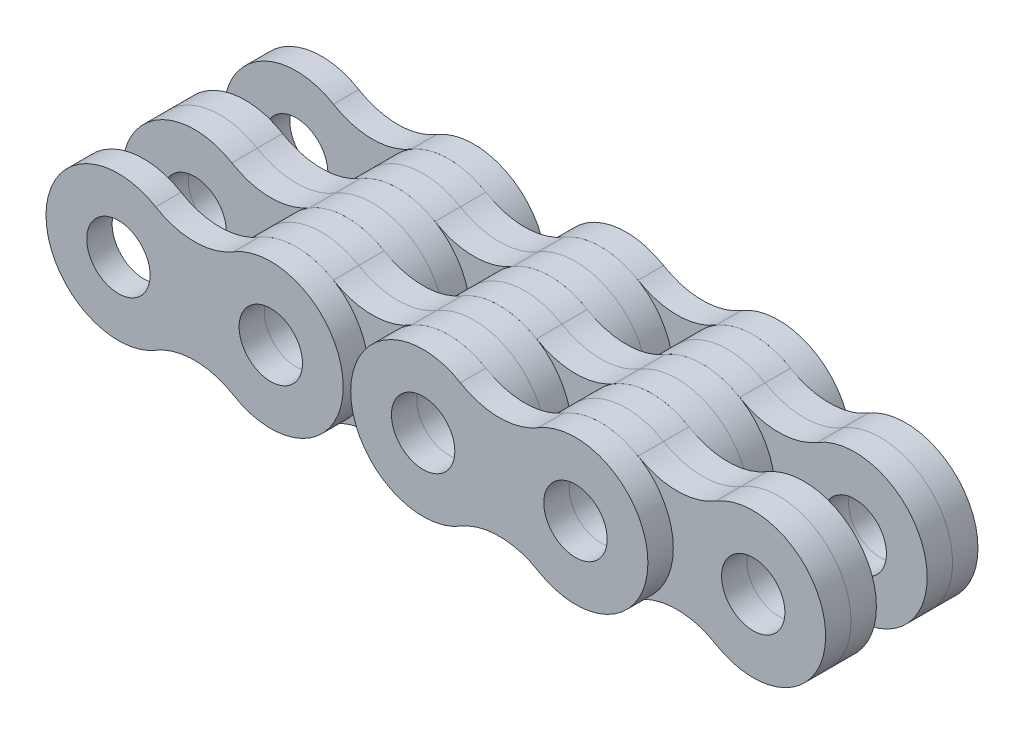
ISO-10303-21;
HEADER;
FILE_DESCRIPTION(('STEP AP214'),'2;1');
FILE_NAME('part.step','',(''),(''),'','','');
FILE_SCHEMA(('AUTOMOTIVE_DESIGN { 1 0 10303 214 1 1 1 1 }'));
ENDSEC;
DATA;
#1=APPLICATION_CONTEXT('core data for automotive mechanical design processes');
#2=APPLICATION_PROTOCOL_DEFINITION('international standard','automotive_design',2000,#1);
#3=PRODUCT_CONTEXT('',#1,'mechanical');
#4=PRODUCT('Part','Part','',(#3));
#5=PRODUCT_RELATED_PRODUCT_CATEGORY('part','',(#4));
#6=PRODUCT_DEFINITION_FORMATION('','',#4);
#7=PRODUCT_DEFINITION_CONTEXT('part definition',#1,'design');
#8=PRODUCT_DEFINITION('design','',#6,#7);
#9=PRODUCT_DEFINITION_SHAPE('','',#8);
#10=(LENGTH_UNIT() NAMED_UNIT(*) SI_UNIT(.MILLI.,.METRE.));
#11=(NAMED_UNIT(*) PLANE_ANGLE_UNIT() SI_UNIT($,.RADIAN.));
#12=(NAMED_UNIT(*) SI_UNIT($,.STERADIAN.) SOLID_ANGLE_UNIT());
#13=UNCERTAINTY_MEASURE_WITH_UNIT(LENGTH_MEASURE(1.E-05),#10,'distance_accuracy_value','');
#14=(GEOMETRIC_REPRESENTATION_CONTEXT(3) GLOBAL_UNCERTAINTY_ASSIGNED_CONTEXT((#13)) GLOBAL_UNIT_ASSIGNED_CONTEXT((#10,
#11,#12)) REPRESENTATION_CONTEXT('',''));
#15=CARTESIAN_POINT('',(0.,0.,0.));
#16=DIRECTION('',(0.,0.,1.));
#17=DIRECTION('',(1.,0.,0.));
#18=AXIS2_PLACEMENT_3D('',#15,#16,#17);
#19=CARTESIAN_POINT('',(61.9125,-7.9375,9.525));
#20=DIRECTION('',(0.,0.,1.));
#21=DIRECTION('',(1.,0.,0.));
#22=AXIS2_PLACEMENT_3D('',#19,#20,#21);
#23=PLANE('',#22);
#24=CARTESIAN_POINT('',(76.2,0.,9.525));
#25=DIRECTION('',(0.,0.,1.));
#26=DIRECTION('',(1.,0.,0.));
#27=AXIS2_PLACEMENT_3D('',#24,#25,#26);
#28=CIRCLE('',#27,3.9624);
#29=CARTESIAN_POINT('',(80.1624,0.,9.525));
#30=VERTEX_POINT('',#29);
#31=EDGE_CURVE('E115',#30,#30,#28,.T.);
#32=ORIENTED_EDGE('',*,*,#31,.F.);
#33=EDGE_LOOP('',(#32));
#34=FACE_BOUND('',#33,.T.);
#35=CARTESIAN_POINT('',(66.675,-15.875,9.525));
#36=DIRECTION('',(0.,0.,-1.));
#37=DIRECTION('',(1.,0.,0.));
#38=AXIS2_PLACEMENT_3D('',#35,#36,#37);
#39=CIRCLE('',#38,9.45817226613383);
#40=CARTESIAN_POINT('',(61.8088105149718,-7.76468419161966,9.525));
#41=VERTEX_POINT('',#40);
#42=CARTESIAN_POINT('',(71.5411894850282,-7.76468419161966,9.525));
#43=VERTEX_POINT('',#42);
#44=EDGE_CURVE('E100',#41,#43,#39,.T.);
#45=ORIENTED_EDGE('',*,*,#44,.T.);
#46=CARTESIAN_POINT('',(76.2,0.,9.525));
#47=DIRECTION('',(0.,0.,1.));
#48=DIRECTION('',(1.,0.,0.));
#49=AXIS2_PLACEMENT_3D('',#46,#47,#48);
#50=CIRCLE('',#49,9.0551);
#51=CARTESIAN_POINT('',(71.5411894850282,7.76468419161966,9.525));
#52=VERTEX_POINT('',#51);
#53=EDGE_CURVE('E95',#43,#52,#50,.T.);
#54=ORIENTED_EDGE('',*,*,#53,.T.);
#55=CARTESIAN_POINT('',(66.675,15.875,9.525));
#56=DIRECTION('',(0.,0.,-1.));
#57=DIRECTION('',(1.,0.,0.));
#58=AXIS2_PLACEMENT_3D('',#55,#56,#57);
#59=CIRCLE('',#58,9.45817226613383);
#60=CARTESIAN_POINT('',(61.8088105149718,7.76468419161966,9.525));
#61=VERTEX_POINT('',#60);
#62=EDGE_CURVE('E98',#52,#61,#59,.T.);
#63=ORIENTED_EDGE('',*,*,#62,.T.);
#64=CARTESIAN_POINT('',(57.15,0.,9.525));
#65=DIRECTION('',(0.,0.,1.));
#66=DIRECTION('',(1.,0.,0.));
#67=AXIS2_PLACEMENT_3D('',#64,#65,#66);
#68=CIRCLE('',#67,9.0551);
#69=EDGE_CURVE('E65',#61,#41,#68,.T.);
#70=ORIENTED_EDGE('',*,*,#69,.T.);
#71=EDGE_LOOP('',(#45,#54,#63,#70));
#72=FACE_BOUND('',#71,.T.);
#73=CARTESIAN_POINT('',(57.15,0.,9.525));
#74=DIRECTION('',(0.,0.,1.));
#75=DIRECTION('',(1.,0.,0.));
#76=AXIS2_PLACEMENT_3D('',#73,#74,#75);
#77=CIRCLE('',#76,3.9624);
#78=CARTESIAN_POINT('',(61.1124,0.,9.525));
#79=VERTEX_POINT('',#78);
#80=EDGE_CURVE('E130',#79,#79,#77,.T.);
#81=ORIENTED_EDGE('',*,*,#80,.F.);
#82=EDGE_LOOP('',(#81));
#83=FACE_BOUND('',#82,.T.);
#84=ADVANCED_FACE('F48',(#34,#72,#83),#23,.T.);
#85=CARTESIAN_POINT('',(61.9125,-7.9375,6.35));
#86=DIRECTION('',(0.,0.,1.));
#87=DIRECTION('',(1.,0.,0.));
#88=AXIS2_PLACEMENT_3D('',#85,#86,#87);
#89=PLANE('',#88);
#90=CARTESIAN_POINT('',(66.675,-15.875,6.35));
#91=DIRECTION('',(0.,0.,-1.));
#92=DIRECTION('',(1.,0.,0.));
#93=AXIS2_PLACEMENT_3D('',#90,#91,#92);
#94=CIRCLE('',#93,9.45817226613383);
#95=CARTESIAN_POINT('',(61.8088105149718,-7.76468419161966,6.35));
#96=VERTEX_POINT('',#95);
#97=CARTESIAN_POINT('',(71.5411894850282,-7.76468419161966,6.35));
#98=VERTEX_POINT('',#97);
#99=EDGE_CURVE('E112',#96,#98,#94,.T.);
#100=ORIENTED_EDGE('',*,*,#99,.F.);
#101=CARTESIAN_POINT('',(57.15,0.,6.35));
#102=DIRECTION('',(0.,0.,1.));
#103=DIRECTION('',(1.,0.,0.));
#104=AXIS2_PLACEMENT_3D('',#101,#102,#103);
#105=CIRCLE('',#104,9.0551);
#106=CARTESIAN_POINT('',(61.8088105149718,7.76468419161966,6.35));
#107=VERTEX_POINT('',#106);
#108=EDGE_CURVE('E88',#107,#96,#105,.T.);
#109=ORIENTED_EDGE('',*,*,#108,.F.);
#110=CARTESIAN_POINT('',(66.675,15.875,6.35));
#111=DIRECTION('',(0.,0.,-1.));
#112=DIRECTION('',(1.,0.,0.));
#113=AXIS2_PLACEMENT_3D('',#110,#111,#112);
#114=CIRCLE('',#113,9.45817226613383);
#115=CARTESIAN_POINT('',(71.5411894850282,7.76468419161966,6.35));
#116=VERTEX_POINT('',#115);
#117=EDGE_CURVE('E82',#116,#107,#114,.T.);
#118=ORIENTED_EDGE('',*,*,#117,.F.);
#119=CARTESIAN_POINT('',(76.2,0.,6.35));
#120=DIRECTION('',(0.,0.,1.));
#121=DIRECTION('',(1.,0.,0.));
#122=AXIS2_PLACEMENT_3D('',#119,#120,#121);
#123=CIRCLE('',#122,9.0551);
#124=EDGE_CURVE('E104',#98,#116,#123,.T.);
#125=ORIENTED_EDGE('',*,*,#124,.F.);
#126=EDGE_LOOP('',(#100,#109,#118,#125));
#127=FACE_BOUND('',#126,.T.);
#128=CARTESIAN_POINT('',(76.2,0.,6.35));
#129=DIRECTION('',(0.,0.,1.));
#130=DIRECTION('',(1.,0.,0.));
#131=AXIS2_PLACEMENT_3D('',#128,#129,#130);
#132=CIRCLE('',#131,3.9624);
#133=CARTESIAN_POINT('',(80.1624,0.,6.35));
#134=VERTEX_POINT('',#133);
#135=EDGE_CURVE('E127',#134,#134,#132,.T.);
#136=ORIENTED_EDGE('',*,*,#135,.T.);
#137=EDGE_LOOP('',(#136));
#138=FACE_BOUND('',#137,.T.);
#139=CARTESIAN_POINT('',(57.15,0.,6.35));
#140=DIRECTION('',(0.,0.,1.));
#141=DIRECTION('',(1.,0.,0.));
#142=AXIS2_PLACEMENT_3D('',#139,#140,#141);
#143=CIRCLE('',#142,3.9624);
#144=CARTESIAN_POINT('',(61.1124,0.,6.35));
#145=VERTEX_POINT('',#144);
#146=EDGE_CURVE('E133',#145,#145,#143,.T.);
#147=ORIENTED_EDGE('',*,*,#146,.T.);
#148=EDGE_LOOP('',(#147));
#149=FACE_BOUND('',#148,.T.);
#150=ADVANCED_FACE('F123',(#127,#138,#149),#89,.F.);
#151=CARTESIAN_POINT('',(66.675,-15.875,9.525));
#152=DIRECTION('',(0.,0.,-1.));
#153=DIRECTION('',(-1.,0.,0.));
#154=AXIS2_PLACEMENT_3D('',#151,#152,#153);
#155=CYLINDRICAL_SURFACE('',#154,9.45817226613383);
#156=ORIENTED_EDGE('',*,*,#99,.T.);
#157=DIRECTION('',(0.,0.,-1.));
#158=VECTOR('',#157,1.);
#159=CARTESIAN_POINT('',(71.5411894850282,-7.76468419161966,9.525));
#160=LINE('',#159,#158);
#161=EDGE_CURVE('E12',#43,#98,#160,.T.);
#162=ORIENTED_EDGE('',*,*,#161,.F.);
#163=ORIENTED_EDGE('',*,*,#44,.F.);
#164=DIRECTION('',(0.,0.,-1.));
#165=VECTOR('',#164,1.);
#166=CARTESIAN_POINT('',(61.8088105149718,-7.76468419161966,9.525));
#167=LINE('',#166,#165);
#168=EDGE_CURVE('E108',#41,#96,#167,.T.);
#169=ORIENTED_EDGE('',*,*,#168,.T.);
#170=EDGE_LOOP('',(#156,#162,#163,#169));
#171=FACE_BOUND('',#170,.T.);
#172=ADVANCED_FACE('F50',(#171),#155,.F.);
#173=CARTESIAN_POINT('',(76.2,0.,9.525));
#174=DIRECTION('',(0.,0.,-1.));
#175=DIRECTION('',(-1.,0.,0.));
#176=AXIS2_PLACEMENT_3D('',#173,#174,#175);
#177=CYLINDRICAL_SURFACE('',#176,9.0551);
#178=ORIENTED_EDGE('',*,*,#124,.T.);
#179=DIRECTION('',(0.,0.,-1.));
#180=VECTOR('',#179,1.);
#181=CARTESIAN_POINT('',(71.5411894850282,7.76468419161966,9.525));
#182=LINE('',#181,#180);
#183=EDGE_CURVE('E57',#52,#116,#182,.T.);
#184=ORIENTED_EDGE('',*,*,#183,.F.);
#185=ORIENTED_EDGE('',*,*,#53,.F.);
#186=ORIENTED_EDGE('',*,*,#161,.T.);
#187=EDGE_LOOP('',(#178,#184,#185,#186));
#188=FACE_BOUND('',#187,.T.);
#189=ADVANCED_FACE('F103',(#188),#177,.T.);
#190=CARTESIAN_POINT('',(66.675,15.875,9.525));
#191=DIRECTION('',(0.,0.,-1.));
#192=DIRECTION('',(-1.,0.,0.));
#193=AXIS2_PLACEMENT_3D('',#190,#191,#192);
#194=CYLINDRICAL_SURFACE('',#193,9.45817226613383);
#195=ORIENTED_EDGE('',*,*,#117,.T.);
#196=DIRECTION('',(0.,0.,-1.));
#197=VECTOR('',#196,1.);
#198=CARTESIAN_POINT('',(61.8088105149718,7.76468419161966,9.525));
#199=LINE('',#198,#197);
#200=EDGE_CURVE('E105',#61,#107,#199,.T.);
#201=ORIENTED_EDGE('',*,*,#200,.F.);
#202=ORIENTED_EDGE('',*,*,#62,.F.);
#203=ORIENTED_EDGE('',*,*,#183,.T.);
#204=EDGE_LOOP('',(#195,#201,#202,#203));
#205=FACE_BOUND('',#204,.T.);
#206=ADVANCED_FACE('F106',(#205),#194,.F.);
#207=CARTESIAN_POINT('',(57.15,0.,9.525));
#208=DIRECTION('',(0.,0.,-1.));
#209=DIRECTION('',(-1.,0.,0.));
#210=AXIS2_PLACEMENT_3D('',#207,#208,#209);
#211=CYLINDRICAL_SURFACE('',#210,9.0551);
#212=ORIENTED_EDGE('',*,*,#108,.T.);
#213=ORIENTED_EDGE('',*,*,#168,.F.);
#214=ORIENTED_EDGE('',*,*,#69,.F.);
#215=ORIENTED_EDGE('',*,*,#200,.T.);
#216=EDGE_LOOP('',(#212,#213,#214,#215));
#217=FACE_BOUND('',#216,.T.);
#218=ADVANCED_FACE('F120',(#217),#211,.T.);
#219=CARTESIAN_POINT('',(76.2,0.,9.525));
#220=DIRECTION('',(0.,0.,-1.));
#221=DIRECTION('',(-1.,0.,0.));
#222=AXIS2_PLACEMENT_3D('',#219,#220,#221);
#223=CYLINDRICAL_SURFACE('',#222,3.9624);
#224=ORIENTED_EDGE('',*,*,#31,.T.);
#225=EDGE_LOOP('',(#224));
#226=FACE_BOUND('',#225,.T.);
#227=ORIENTED_EDGE('',*,*,#135,.F.);
#228=EDGE_LOOP('',(#227));
#229=FACE_BOUND('',#228,.T.);
#230=ADVANCED_FACE('F150',(#226,#229),#223,.F.);
#231=CARTESIAN_POINT('',(57.15,0.,9.525));
#232=DIRECTION('',(0.,0.,-1.));
#233=DIRECTION('',(-1.,0.,0.));
#234=AXIS2_PLACEMENT_3D('',#231,#232,#233);
#235=CYLINDRICAL_SURFACE('',#234,3.9624);
#236=ORIENTED_EDGE('',*,*,#80,.T.);
#237=EDGE_LOOP('',(#236));
#238=FACE_BOUND('',#237,.T.);
#239=ORIENTED_EDGE('',*,*,#146,.F.);
#240=EDGE_LOOP('',(#239));
#241=FACE_BOUND('',#240,.T.);
#242=ADVANCED_FACE('F139',(#238,#241),#235,.F.);
#243=CLOSED_SHELL('',(#84,#150,#172,#189,#206,#218,#230,#242));
#244=MANIFOLD_SOLID_BREP('B2',#243);
#245=CARTESIAN_POINT('',(61.9125,-7.9375,6.35));
#246=DIRECTION('',(0.,0.,1.));
#247=DIRECTION('',(1.,0.,0.));
#248=AXIS2_PLACEMENT_3D('',#245,#246,#247);
#249=PLANE('',#248);
#250=CARTESIAN_POINT('',(76.2,0.,6.35));
#251=DIRECTION('',(0.,0.,1.));
#252=DIRECTION('',(1.,0.,0.));
#253=AXIS2_PLACEMENT_3D('',#250,#251,#252);
#254=CIRCLE('',#253,3.9624);
#255=CARTESIAN_POINT('',(80.1624,0.,6.35));
#256=VERTEX_POINT('',#255);
#257=EDGE_CURVE('E291',#256,#256,#254,.T.);
#258=ORIENTED_EDGE('',*,*,#257,.F.);
#259=EDGE_LOOP('',(#258));
#260=FACE_BOUND('',#259,.T.);
#261=CARTESIAN_POINT('',(66.675,-15.875,6.35));
#262=DIRECTION('',(0.,0.,-1.));
#263=DIRECTION('',(1.,0.,0.));
#264=AXIS2_PLACEMENT_3D('',#261,#262,#263);
#265=CIRCLE('',#264,9.45817226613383);
#266=CARTESIAN_POINT('',(61.8088105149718,-7.76468419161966,6.35));
#267=VERTEX_POINT('',#266);
#268=CARTESIAN_POINT('',(71.5411894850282,-7.76468419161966,6.35));
#269=VERTEX_POINT('',#268);
#270=EDGE_CURVE('E276',#267,#269,#265,.T.);
#271=ORIENTED_EDGE('',*,*,#270,.T.);
#272=CARTESIAN_POINT('',(76.2,0.,6.35));
#273=DIRECTION('',(0.,0.,1.));
#274=DIRECTION('',(1.,0.,0.));
#275=AXIS2_PLACEMENT_3D('',#272,#273,#274);
#276=CIRCLE('',#275,9.0551);
#277=CARTESIAN_POINT('',(71.5411894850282,7.76468419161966,6.35));
#278=VERTEX_POINT('',#277);
#279=EDGE_CURVE('E271',#269,#278,#276,.T.);
#280=ORIENTED_EDGE('',*,*,#279,.T.);
#281=CARTESIAN_POINT('',(66.675,15.875,6.35));
#282=DIRECTION('',(0.,0.,-1.));
#283=DIRECTION('',(1.,0.,0.));
#284=AXIS2_PLACEMENT_3D('',#281,#282,#283);
#285=CIRCLE('',#284,9.45817226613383);
#286=CARTESIAN_POINT('',(61.8088105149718,7.76468419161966,6.35));
#287=VERTEX_POINT('',#286);
#288=EDGE_CURVE('E274',#278,#287,#285,.T.);
#289=ORIENTED_EDGE('',*,*,#288,.T.);
#290=CARTESIAN_POINT('',(57.15,0.,6.35));
#291=DIRECTION('',(0.,0.,1.));
#292=DIRECTION('',(1.,0.,0.));
#293=AXIS2_PLACEMENT_3D('',#290,#291,#292);
#294=CIRCLE('',#293,9.0551);
#295=EDGE_CURVE('E241',#287,#267,#294,.T.);
#296=ORIENTED_EDGE('',*,*,#295,.T.);
#297=EDGE_LOOP('',(#271,#280,#289,#296));
#298=FACE_BOUND('',#297,.T.);
#299=CARTESIAN_POINT('',(57.15,0.,6.35));
#300=DIRECTION('',(0.,0.,1.));
#301=DIRECTION('',(1.,0.,0.));
#302=AXIS2_PLACEMENT_3D('',#299,#300,#301);
#303=CIRCLE('',#302,3.9624);
#304=CARTESIAN_POINT('',(61.1124,0.,6.35));
#305=VERTEX_POINT('',#304);
#306=EDGE_CURVE('E306',#305,#305,#303,.T.);
#307=ORIENTED_EDGE('',*,*,#306,.F.);
#308=EDGE_LOOP('',(#307));
#309=FACE_BOUND('',#308,.T.);
#310=ADVANCED_FACE('F224',(#260,#298,#309),#249,.T.);
#311=CARTESIAN_POINT('',(61.9125,-7.9375,3.175));
#312=DIRECTION('',(0.,0.,1.));
#313=DIRECTION('',(1.,0.,0.));
#314=AXIS2_PLACEMENT_3D('',#311,#312,#313);
#315=PLANE('',#314);
#316=CARTESIAN_POINT('',(66.675,-15.875,3.175));
#317=DIRECTION('',(0.,0.,-1.));
#318=DIRECTION('',(1.,0.,0.));
#319=AXIS2_PLACEMENT_3D('',#316,#317,#318);
#320=CIRCLE('',#319,9.45817226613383);
#321=CARTESIAN_POINT('',(61.8088105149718,-7.76468419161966,3.175));
#322=VERTEX_POINT('',#321);
#323=CARTESIAN_POINT('',(71.5411894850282,-7.76468419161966,3.175));
#324=VERTEX_POINT('',#323);
#325=EDGE_CURVE('E288',#322,#324,#320,.T.);
#326=ORIENTED_EDGE('',*,*,#325,.F.);
#327=CARTESIAN_POINT('',(57.15,0.,3.175));
#328=DIRECTION('',(0.,0.,1.));
#329=DIRECTION('',(1.,0.,0.));
#330=AXIS2_PLACEMENT_3D('',#327,#328,#329);
#331=CIRCLE('',#330,9.0551);
#332=CARTESIAN_POINT('',(61.8088105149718,7.76468419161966,3.175));
#333=VERTEX_POINT('',#332);
#334=EDGE_CURVE('E264',#333,#322,#331,.T.);
#335=ORIENTED_EDGE('',*,*,#334,.F.);
#336=CARTESIAN_POINT('',(66.675,15.875,3.175));
#337=DIRECTION('',(0.,0.,-1.));
#338=DIRECTION('',(1.,0.,0.));
#339=AXIS2_PLACEMENT_3D('',#336,#337,#338);
#340=CIRCLE('',#339,9.45817226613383);
#341=CARTESIAN_POINT('',(71.5411894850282,7.76468419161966,3.175));
#342=VERTEX_POINT('',#341);
#343=EDGE_CURVE('E258',#342,#333,#340,.T.);
#344=ORIENTED_EDGE('',*,*,#343,.F.);
#345=CARTESIAN_POINT('',(76.2,0.,3.175));
#346=DIRECTION('',(0.,0.,1.));
#347=DIRECTION('',(1.,0.,0.));
#348=AXIS2_PLACEMENT_3D('',#345,#346,#347);
#349=CIRCLE('',#348,9.0551);
#350=EDGE_CURVE('E280',#324,#342,#349,.T.);
#351=ORIENTED_EDGE('',*,*,#350,.F.);
#352=EDGE_LOOP('',(#326,#335,#344,#351));
#353=FACE_BOUND('',#352,.T.);
#354=CARTESIAN_POINT('',(76.2,0.,3.175));
#355=DIRECTION('',(0.,0.,1.));
#356=DIRECTION('',(1.,0.,0.));
#357=AXIS2_PLACEMENT_3D('',#354,#355,#356);
#358=CIRCLE('',#357,3.9624);
#359=CARTESIAN_POINT('',(80.1624,0.,3.175));
#360=VERTEX_POINT('',#359);
#361=EDGE_CURVE('E303',#360,#360,#358,.T.);
#362=ORIENTED_EDGE('',*,*,#361,.T.);
#363=EDGE_LOOP('',(#362));
#364=FACE_BOUND('',#363,.T.);
#365=CARTESIAN_POINT('',(57.15,0.,3.175));
#366=DIRECTION('',(0.,0.,1.));
#367=DIRECTION('',(1.,0.,0.));
#368=AXIS2_PLACEMENT_3D('',#365,#366,#367);
#369=CIRCLE('',#368,3.9624);
#370=CARTESIAN_POINT('',(61.1124,0.,3.175));
#371=VERTEX_POINT('',#370);
#372=EDGE_CURVE('E309',#371,#371,#369,.T.);
#373=ORIENTED_EDGE('',*,*,#372,.T.);
#374=EDGE_LOOP('',(#373));
#375=FACE_BOUND('',#374,.T.);
#376=ADVANCED_FACE('F299',(#353,#364,#375),#315,.F.);
#377=CARTESIAN_POINT('',(66.675,-15.875,6.35));
#378=DIRECTION('',(0.,0.,-1.));
#379=DIRECTION('',(-1.,0.,0.));
#380=AXIS2_PLACEMENT_3D('',#377,#378,#379);
#381=CYLINDRICAL_SURFACE('',#380,9.45817226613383);
#382=ORIENTED_EDGE('',*,*,#325,.T.);
#383=DIRECTION('',(0.,0.,-1.));
#384=VECTOR('',#383,1.);
#385=CARTESIAN_POINT('',(71.5411894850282,-7.76468419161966,6.35));
#386=LINE('',#385,#384);
#387=EDGE_CURVE('E46',#269,#324,#386,.T.);
#388=ORIENTED_EDGE('',*,*,#387,.F.);
#389=ORIENTED_EDGE('',*,*,#270,.F.);
#390=DIRECTION('',(0.,0.,-1.));
#391=VECTOR('',#390,1.);
#392=CARTESIAN_POINT('',(61.8088105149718,-7.76468419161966,6.35));
#393=LINE('',#392,#391);
#394=EDGE_CURVE('E284',#267,#322,#393,.T.);
#395=ORIENTED_EDGE('',*,*,#394,.T.);
#396=EDGE_LOOP('',(#382,#388,#389,#395));
#397=FACE_BOUND('',#396,.T.);
#398=ADVANCED_FACE('F226',(#397),#381,.F.);
#399=CARTESIAN_POINT('',(76.2,0.,6.35));
#400=DIRECTION('',(0.,0.,-1.));
#401=DIRECTION('',(-1.,0.,0.));
#402=AXIS2_PLACEMENT_3D('',#399,#400,#401);
#403=CYLINDRICAL_SURFACE('',#402,9.0551);
#404=ORIENTED_EDGE('',*,*,#350,.T.);
#405=DIRECTION('',(0.,0.,-1.));
#406=VECTOR('',#405,1.);
#407=CARTESIAN_POINT('',(71.5411894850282,7.76468419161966,6.35));
#408=LINE('',#407,#406);
#409=EDGE_CURVE('E233',#278,#342,#408,.T.);
#410=ORIENTED_EDGE('',*,*,#409,.F.);
#411=ORIENTED_EDGE('',*,*,#279,.F.);
#412=ORIENTED_EDGE('',*,*,#387,.T.);
#413=EDGE_LOOP('',(#404,#410,#411,#412));
#414=FACE_BOUND('',#413,.T.);
#415=ADVANCED_FACE('F279',(#414),#403,.T.);
#416=CARTESIAN_POINT('',(66.675,15.875,6.35));
#417=DIRECTION('',(0.,0.,-1.));
#418=DIRECTION('',(-1.,0.,0.));
#419=AXIS2_PLACEMENT_3D('',#416,#417,#418);
#420=CYLINDRICAL_SURFACE('',#419,9.45817226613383);
#421=ORIENTED_EDGE('',*,*,#343,.T.);
#422=DIRECTION('',(0.,0.,-1.));
#423=VECTOR('',#422,1.);
#424=CARTESIAN_POINT('',(61.8088105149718,7.76468419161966,6.35));
#425=LINE('',#424,#423);
#426=EDGE_CURVE('E281',#287,#333,#425,.T.);
#427=ORIENTED_EDGE('',*,*,#426,.F.);
#428=ORIENTED_EDGE('',*,*,#288,.F.);
#429=ORIENTED_EDGE('',*,*,#409,.T.);
#430=EDGE_LOOP('',(#421,#427,#428,#429));
#431=FACE_BOUND('',#430,.T.);
#432=ADVANCED_FACE('F282',(#431),#420,.F.);
#433=CARTESIAN_POINT('',(57.15,0.,6.35));
#434=DIRECTION('',(0.,0.,-1.));
#435=DIRECTION('',(-1.,0.,0.));
#436=AXIS2_PLACEMENT_3D('',#433,#434,#435);
#437=CYLINDRICAL_SURFACE('',#436,9.0551);
#438=ORIENTED_EDGE('',*,*,#334,.T.);
#439=ORIENTED_EDGE('',*,*,#394,.F.);
#440=ORIENTED_EDGE('',*,*,#295,.F.);
#441=ORIENTED_EDGE('',*,*,#426,.T.);
#442=EDGE_LOOP('',(#438,#439,#440,#441));
#443=FACE_BOUND('',#442,.T.);
#444=ADVANCED_FACE('F296',(#443),#437,.T.);
#445=CARTESIAN_POINT('',(76.2,0.,6.35));
#446=DIRECTION('',(0.,0.,-1.));
#447=DIRECTION('',(-1.,0.,0.));
#448=AXIS2_PLACEMENT_3D('',#445,#446,#447);
#449=CYLINDRICAL_SURFACE('',#448,3.9624);
#450=ORIENTED_EDGE('',*,*,#257,.T.);
#451=EDGE_LOOP('',(#450));
#452=FACE_BOUND('',#451,.T.);
#453=ORIENTED_EDGE('',*,*,#361,.F.);
#454=EDGE_LOOP('',(#453));
#455=FACE_BOUND('',#454,.T.);
#456=ADVANCED_FACE('F326',(#452,#455),#449,.F.);
#457=CARTESIAN_POINT('',(57.15,0.,6.35));
#458=DIRECTION('',(0.,0.,-1.));
#459=DIRECTION('',(-1.,0.,0.));
#460=AXIS2_PLACEMENT_3D('',#457,#458,#459);
#461=CYLINDRICAL_SURFACE('',#460,3.9624);
#462=ORIENTED_EDGE('',*,*,#306,.T.);
#463=EDGE_LOOP('',(#462));
#464=FACE_BOUND('',#463,.T.);
#465=ORIENTED_EDGE('',*,*,#372,.F.);
#466=EDGE_LOOP('',(#465));
#467=FACE_BOUND('',#466,.T.);
#468=ADVANCED_FACE('F315',(#464,#467),#461,.F.);
#469=CLOSED_SHELL('',(#310,#376,#398,#415,#432,#444,#456,#468));
#470=MANIFOLD_SOLID_BREP('B6',#469);
#471=CARTESIAN_POINT('',(61.9125,7.9375,-6.35));
#472=DIRECTION('',(0.,0.,-1.));
#473=DIRECTION('',(-1.,0.,0.));
#474=AXIS2_PLACEMENT_3D('',#471,#472,#473);
#475=PLANE('',#474);
#476=CARTESIAN_POINT('',(76.2,0.,-6.35));
#477=DIRECTION('',(0.,0.,-1.));
#478=DIRECTION('',(-1.,0.,0.));
#479=AXIS2_PLACEMENT_3D('',#476,#477,#478);
#480=CIRCLE('',#479,3.9624);
#481=CARTESIAN_POINT('',(72.2376,0.,-6.35));
#482=VERTEX_POINT('',#481);
#483=EDGE_CURVE('E467',#482,#482,#480,.T.);
#484=ORIENTED_EDGE('',*,*,#483,.F.);
#485=EDGE_LOOP('',(#484));
#486=FACE_BOUND('',#485,.T.);
#487=CARTESIAN_POINT('',(66.675,15.875,-6.35));
#488=DIRECTION('',(0.,0.,1.));
#489=DIRECTION('',(-1.,0.,0.));
#490=AXIS2_PLACEMENT_3D('',#487,#488,#489);
#491=CIRCLE('',#490,9.45817226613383);
#492=CARTESIAN_POINT('',(61.8088105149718,7.76468419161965,-6.35));
#493=VERTEX_POINT('',#492);
#494=CARTESIAN_POINT('',(71.5411894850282,7.76468419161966,-6.35));
#495=VERTEX_POINT('',#494);
#496=EDGE_CURVE('E452',#493,#495,#491,.T.);
#497=ORIENTED_EDGE('',*,*,#496,.T.);
#498=CARTESIAN_POINT('',(76.2,0.,-6.35));
#499=DIRECTION('',(0.,0.,-1.));
#500=DIRECTION('',(-1.,0.,0.));
#501=AXIS2_PLACEMENT_3D('',#498,#499,#500);
#502=CIRCLE('',#501,9.0551);
#503=CARTESIAN_POINT('',(71.5411894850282,-7.76468419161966,-6.35));
#504=VERTEX_POINT('',#503);
#505=EDGE_CURVE('E447',#495,#504,#502,.T.);
#506=ORIENTED_EDGE('',*,*,#505,.T.);
#507=CARTESIAN_POINT('',(66.675,-15.875,-6.35));
#508=DIRECTION('',(0.,0.,1.));
#509=DIRECTION('',(-1.,0.,0.));
#510=AXIS2_PLACEMENT_3D('',#507,#508,#509);
#511=CIRCLE('',#510,9.45817226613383);
#512=CARTESIAN_POINT('',(61.8088105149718,-7.76468419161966,-6.35));
#513=VERTEX_POINT('',#512);
#514=EDGE_CURVE('E450',#504,#513,#511,.T.);
#515=ORIENTED_EDGE('',*,*,#514,.T.);
#516=CARTESIAN_POINT('',(57.15,0.,-6.35));
#517=DIRECTION('',(0.,0.,-1.));
#518=DIRECTION('',(-1.,0.,0.));
#519=AXIS2_PLACEMENT_3D('',#516,#517,#518);
#520=CIRCLE('',#519,9.0551);
#521=EDGE_CURVE('E417',#513,#493,#520,.T.);
#522=ORIENTED_EDGE('',*,*,#521,.T.);
#523=EDGE_LOOP('',(#497,#506,#515,#522));
#524=FACE_BOUND('',#523,.T.);
#525=CARTESIAN_POINT('',(57.15,0.,-6.35));
#526=DIRECTION('',(0.,0.,-1.));
#527=DIRECTION('',(-1.,0.,0.));
#528=AXIS2_PLACEMENT_3D('',#525,#526,#527);
#529=CIRCLE('',#528,3.9624);
#530=CARTESIAN_POINT('',(53.1876,0.,-6.35));
#531=VERTEX_POINT('',#530);
#532=EDGE_CURVE('E482',#531,#531,#529,.T.);
#533=ORIENTED_EDGE('',*,*,#532,.F.);
#534=EDGE_LOOP('',(#533));
#535=FACE_BOUND('',#534,.T.);
#536=ADVANCED_FACE('F400',(#486,#524,#535),#475,.T.);
#537=CARTESIAN_POINT('',(61.9125,7.9375,-3.175));
#538=DIRECTION('',(0.,0.,-1.));
#539=DIRECTION('',(-1.,0.,0.));
#540=AXIS2_PLACEMENT_3D('',#537,#538,#539);
#541=PLANE('',#540);
#542=CARTESIAN_POINT('',(66.675,15.875,-3.175));
#543=DIRECTION('',(0.,0.,1.));
#544=DIRECTION('',(-1.,0.,0.));
#545=AXIS2_PLACEMENT_3D('',#542,#543,#544);
#546=CIRCLE('',#545,9.45817226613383);
#547=CARTESIAN_POINT('',(61.8088105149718,7.76468419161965,-3.175));
#548=VERTEX_POINT('',#547);
#549=CARTESIAN_POINT('',(71.5411894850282,7.76468419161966,-3.175));
#550=VERTEX_POINT('',#549);
#551=EDGE_CURVE('E464',#548,#550,#546,.T.);
#552=ORIENTED_EDGE('',*,*,#551,.F.);
#553=CARTESIAN_POINT('',(57.15,0.,-3.175));
#554=DIRECTION('',(0.,0.,-1.));
#555=DIRECTION('',(-1.,0.,0.));
#556=AXIS2_PLACEMENT_3D('',#553,#554,#555);
#557=CIRCLE('',#556,9.0551);
#558=CARTESIAN_POINT('',(61.8088105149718,-7.76468419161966,-3.175));
#559=VERTEX_POINT('',#558);
#560=EDGE_CURVE('E440',#559,#548,#557,.T.);
#561=ORIENTED_EDGE('',*,*,#560,.F.);
#562=CARTESIAN_POINT('',(66.675,-15.875,-3.175));
#563=DIRECTION('',(0.,0.,1.));
#564=DIRECTION('',(-1.,0.,0.));
#565=AXIS2_PLACEMENT_3D('',#562,#563,#564);
#566=CIRCLE('',#565,9.45817226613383);
#567=CARTESIAN_POINT('',(71.5411894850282,-7.76468419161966,-3.175));
#568=VERTEX_POINT('',#567);
#569=EDGE_CURVE('E434',#568,#559,#566,.T.);
#570=ORIENTED_EDGE('',*,*,#569,.F.);
#571=CARTESIAN_POINT('',(76.2,0.,-3.175));
#572=DIRECTION('',(0.,0.,-1.));
#573=DIRECTION('',(-1.,0.,0.));
#574=AXIS2_PLACEMENT_3D('',#571,#572,#573);
#575=CIRCLE('',#574,9.0551);
#576=EDGE_CURVE('E456',#550,#568,#575,.T.);
#577=ORIENTED_EDGE('',*,*,#576,.F.);
#578=EDGE_LOOP('',(#552,#561,#570,#577));
#579=FACE_BOUND('',#578,.T.);
#580=CARTESIAN_POINT('',(76.2,0.,-3.175));
#581=DIRECTION('',(0.,0.,-1.));
#582=DIRECTION('',(-1.,0.,0.));
#583=AXIS2_PLACEMENT_3D('',#580,#581,#582);
#584=CIRCLE('',#583,3.9624);
#585=CARTESIAN_POINT('',(72.2376,0.,-3.175));
#586=VERTEX_POINT('',#585);
#587=EDGE_CURVE('E479',#586,#586,#584,.T.);
#588=ORIENTED_EDGE('',*,*,#587,.T.);
#589=EDGE_LOOP('',(#588));
#590=FACE_BOUND('',#589,.T.);
#591=CARTESIAN_POINT('',(57.15,0.,-3.175));
#592=DIRECTION('',(0.,0.,-1.));
#593=DIRECTION('',(-1.,0.,0.));
#594=AXIS2_PLACEMENT_3D('',#591,#592,#593);
#595=CIRCLE('',#594,3.9624);
#596=CARTESIAN_POINT('',(53.1876,0.,-3.175));
#597=VERTEX_POINT('',#596);
#598=EDGE_CURVE('E485',#597,#597,#595,.T.);
#599=ORIENTED_EDGE('',*,*,#598,.T.);
#600=EDGE_LOOP('',(#599));
#601=FACE_BOUND('',#600,.T.);
#602=ADVANCED_FACE('F475',(#579,#590,#601),#541,.F.);
#603=CARTESIAN_POINT('',(66.675,15.875,-6.35));
#604=DIRECTION('',(0.,0.,1.));
#605=DIRECTION('',(1.,0.,0.));
#606=AXIS2_PLACEMENT_3D('',#603,#604,#605);
#607=CYLINDRICAL_SURFACE('',#606,9.45817226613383);
#608=ORIENTED_EDGE('',*,*,#551,.T.);
#609=DIRECTION('',(0.,0.,1.));
#610=VECTOR('',#609,1.);
#611=CARTESIAN_POINT('',(71.5411894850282,7.76468419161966,-6.35));
#612=LINE('',#611,#610);
#613=EDGE_CURVE('E222',#495,#550,#612,.T.);
#614=ORIENTED_EDGE('',*,*,#613,.F.);
#615=ORIENTED_EDGE('',*,*,#496,.F.);
#616=DIRECTION('',(0.,0.,1.));
#617=VECTOR('',#616,1.);
#618=CARTESIAN_POINT('',(61.8088105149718,7.76468419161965,-6.35));
#619=LINE('',#618,#617);
#620=EDGE_CURVE('E460',#493,#548,#619,.T.);
#621=ORIENTED_EDGE('',*,*,#620,.T.);
#622=EDGE_LOOP('',(#608,#614,#615,#621));
#623=FACE_BOUND('',#622,.T.);
#624=ADVANCED_FACE('F402',(#623),#607,.F.);
#625=CARTESIAN_POINT('',(76.2,0.,-6.35));
#626=DIRECTION('',(0.,0.,1.));
#627=DIRECTION('',(1.,0.,0.));
#628=AXIS2_PLACEMENT_3D('',#625,#626,#627);
#629=CYLINDRICAL_SURFACE('',#628,9.0551);
#630=ORIENTED_EDGE('',*,*,#576,.T.);
#631=DIRECTION('',(0.,0.,1.));
#632=VECTOR('',#631,1.);
#633=CARTESIAN_POINT('',(71.5411894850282,-7.76468419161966,-6.35));
#634=LINE('',#633,#632);
#635=EDGE_CURVE('E409',#504,#568,#634,.T.);
#636=ORIENTED_EDGE('',*,*,#635,.F.);
#637=ORIENTED_EDGE('',*,*,#505,.F.);
#638=ORIENTED_EDGE('',*,*,#613,.T.);
#639=EDGE_LOOP('',(#630,#636,#637,#638));
#640=FACE_BOUND('',#639,.T.);
#641=ADVANCED_FACE('F455',(#640),#629,.T.);
#642=CARTESIAN_POINT('',(66.675,-15.875,-6.35));
#643=DIRECTION('',(0.,0.,1.));
#644=DIRECTION('',(1.,0.,0.));
#645=AXIS2_PLACEMENT_3D('',#642,#643,#644);
#646=CYLINDRICAL_SURFACE('',#645,9.45817226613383);
#647=ORIENTED_EDGE('',*,*,#569,.T.);
#648=DIRECTION('',(0.,0.,1.));
#649=VECTOR('',#648,1.);
#650=CARTESIAN_POINT('',(61.8088105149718,-7.76468419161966,-6.35));
#651=LINE('',#650,#649);
#652=EDGE_CURVE('E457',#513,#559,#651,.T.);
#653=ORIENTED_EDGE('',*,*,#652,.F.);
#654=ORIENTED_EDGE('',*,*,#514,.F.);
#655=ORIENTED_EDGE('',*,*,#635,.T.);
#656=EDGE_LOOP('',(#647,#653,#654,#655));
#657=FACE_BOUND('',#656,.T.);
#658=ADVANCED_FACE('F458',(#657),#646,.F.);
#659=CARTESIAN_POINT('',(57.15,0.,-6.35));
#660=DIRECTION('',(0.,0.,1.));
#661=DIRECTION('',(1.,0.,0.));
#662=AXIS2_PLACEMENT_3D('',#659,#660,#661);
#663=CYLINDRICAL_SURFACE('',#662,9.0551);
#664=ORIENTED_EDGE('',*,*,#560,.T.);
#665=ORIENTED_EDGE('',*,*,#620,.F.);
#666=ORIENTED_EDGE('',*,*,#521,.F.);
#667=ORIENTED_EDGE('',*,*,#652,.T.);
#668=EDGE_LOOP('',(#664,#665,#666,#667));
#669=FACE_BOUND('',#668,.T.);
#670=ADVANCED_FACE('F472',(#669),#663,.T.);
#671=CARTESIAN_POINT('',(76.2,0.,-6.35));
#672=DIRECTION('',(0.,0.,1.));
#673=DIRECTION('',(1.,0.,0.));
#674=AXIS2_PLACEMENT_3D('',#671,#672,#673);
#675=CYLINDRICAL_SURFACE('',#674,3.9624);
#676=ORIENTED_EDGE('',*,*,#483,.T.);
#677=EDGE_LOOP('',(#676));
#678=FACE_BOUND('',#677,.T.);
#679=ORIENTED_EDGE('',*,*,#587,.F.);
#680=EDGE_LOOP('',(#679));
#681=FACE_BOUND('',#680,.T.);
#682=ADVANCED_FACE('F502',(#678,#681),#675,.F.);
#683=CARTESIAN_POINT('',(57.15,0.,-6.35));
#684=DIRECTION('',(0.,0.,1.));
#685=DIRECTION('',(1.,0.,0.));
#686=AXIS2_PLACEMENT_3D('',#683,#684,#685);
#687=CYLINDRICAL_SURFACE('',#686,3.9624);
#688=ORIENTED_EDGE('',*,*,#532,.T.);
#689=EDGE_LOOP('',(#688));
#690=FACE_BOUND('',#689,.T.);
#691=ORIENTED_EDGE('',*,*,#598,.F.);
#692=EDGE_LOOP('',(#691));
#693=FACE_BOUND('',#692,.T.);
#694=ADVANCED_FACE('F491',(#690,#693),#687,.F.);
#695=CLOSED_SHELL('',(#536,#602,#624,#641,#658,#670,#682,#694));
#696=MANIFOLD_SOLID_BREP('B40',#695);
#697=CARTESIAN_POINT('',(61.9125,7.9375,-9.525));
#698=DIRECTION('',(0.,0.,-1.));
#699=DIRECTION('',(-1.,0.,0.));
#700=AXIS2_PLACEMENT_3D('',#697,#698,#699);
#701=PLANE('',#700);
#702=CARTESIAN_POINT('',(76.2,0.,-9.525));
#703=DIRECTION('',(0.,0.,-1.));
#704=DIRECTION('',(-1.,0.,0.));
#705=AXIS2_PLACEMENT_3D('',#702,#703,#704);
#706=CIRCLE('',#705,3.9624);
#707=CARTESIAN_POINT('',(72.2376,0.,-9.525));
#708=VERTEX_POINT('',#707);
#709=EDGE_CURVE('E643',#708,#708,#706,.T.);
#710=ORIENTED_EDGE('',*,*,#709,.F.);
#711=EDGE_LOOP('',(#710));
#712=FACE_BOUND('',#711,.T.);
#713=CARTESIAN_POINT('',(66.675,15.875,-9.525));
#714=DIRECTION('',(0.,0.,1.));
#715=DIRECTION('',(-1.,0.,0.));
#716=AXIS2_PLACEMENT_3D('',#713,#714,#715);
#717=CIRCLE('',#716,9.45817226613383);
#718=CARTESIAN_POINT('',(61.8088105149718,7.76468419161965,-9.525));
#719=VERTEX_POINT('',#718);
#720=CARTESIAN_POINT('',(71.5411894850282,7.76468419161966,-9.525));
#721=VERTEX_POINT('',#720);
#722=EDGE_CURVE('E628',#719,#721,#717,.T.);
#723=ORIENTED_EDGE('',*,*,#722,.T.);
#724=CARTESIAN_POINT('',(76.2,0.,-9.525));
#725=DIRECTION('',(0.,0.,-1.));
#726=DIRECTION('',(-1.,0.,0.));
#727=AXIS2_PLACEMENT_3D('',#724,#725,#726);
#728=CIRCLE('',#727,9.0551);
#729=CARTESIAN_POINT('',(71.5411894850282,-7.76468419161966,-9.525));
#730=VERTEX_POINT('',#729);
#731=EDGE_CURVE('E623',#721,#730,#728,.T.);
#732=ORIENTED_EDGE('',*,*,#731,.T.);
#733=CARTESIAN_POINT('',(66.675,-15.875,-9.525));
#734=DIRECTION('',(0.,0.,1.));
#735=DIRECTION('',(-1.,0.,0.));
#736=AXIS2_PLACEMENT_3D('',#733,#734,#735);
#737=CIRCLE('',#736,9.45817226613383);
#738=CARTESIAN_POINT('',(61.8088105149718,-7.76468419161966,-9.525));
#739=VERTEX_POINT('',#738);
#740=EDGE_CURVE('E626',#730,#739,#737,.T.);
#741=ORIENTED_EDGE('',*,*,#740,.T.);
#742=CARTESIAN_POINT('',(57.15,0.,-9.525));
#743=DIRECTION('',(0.,0.,-1.));
#744=DIRECTION('',(-1.,0.,0.));
#745=AXIS2_PLACEMENT_3D('',#742,#743,#744);
#746=CIRCLE('',#745,9.0551);
#747=EDGE_CURVE('E593',#739,#719,#746,.T.);
#748=ORIENTED_EDGE('',*,*,#747,.T.);
#749=EDGE_LOOP('',(#723,#732,#741,#748));
#750=FACE_BOUND('',#749,.T.);
#751=CARTESIAN_POINT('',(57.15,0.,-9.525));
#752=DIRECTION('',(0.,0.,-1.));
#753=DIRECTION('',(-1.,0.,0.));
#754=AXIS2_PLACEMENT_3D('',#751,#752,#753);
#755=CIRCLE('',#754,3.9624);
#756=CARTESIAN_POINT('',(53.1876,0.,-9.525));
#757=VERTEX_POINT('',#756);
#758=EDGE_CURVE('E658',#757,#757,#755,.T.);
#759=ORIENTED_EDGE('',*,*,#758,.F.);
#760=EDGE_LOOP('',(#759));
#761=FACE_BOUND('',#760,.T.);
#762=ADVANCED_FACE('F576',(#712,#750,#761),#701,.T.);
#763=CARTESIAN_POINT('',(61.9125,7.9375,-6.35));
#764=DIRECTION('',(0.,0.,-1.));
#765=DIRECTION('',(-1.,0.,0.));
#766=AXIS2_PLACEMENT_3D('',#763,#764,#765);
#767=PLANE('',#766);
#768=CARTESIAN_POINT('',(66.675,15.875,-6.35));
#769=DIRECTION('',(0.,0.,1.));
#770=DIRECTION('',(-1.,0.,0.));
#771=AXIS2_PLACEMENT_3D('',#768,#769,#770);
#772=CIRCLE('',#771,9.45817226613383);
#773=CARTESIAN_POINT('',(61.8088105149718,7.76468419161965,-6.35));
#774=VERTEX_POINT('',#773);
#775=CARTESIAN_POINT('',(71.5411894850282,7.76468419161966,-6.35));
#776=VERTEX_POINT('',#775);
#777=EDGE_CURVE('E640',#774,#776,#772,.T.);
#778=ORIENTED_EDGE('',*,*,#777,.F.);
#779=CARTESIAN_POINT('',(57.15,0.,-6.35));
#780=DIRECTION('',(0.,0.,-1.));
#781=DIRECTION('',(-1.,0.,0.));
#782=AXIS2_PLACEMENT_3D('',#779,#780,#781);
#783=CIRCLE('',#782,9.0551);
#784=CARTESIAN_POINT('',(61.8088105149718,-7.76468419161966,-6.35));
#785=VERTEX_POINT('',#784);
#786=EDGE_CURVE('E616',#785,#774,#783,.T.);
#787=ORIENTED_EDGE('',*,*,#786,.F.);
#788=CARTESIAN_POINT('',(66.675,-15.875,-6.35));
#789=DIRECTION('',(0.,0.,1.));
#790=DIRECTION('',(-1.,0.,0.));
#791=AXIS2_PLACEMENT_3D('',#788,#789,#790);
#792=CIRCLE('',#791,9.45817226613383);
#793=CARTESIAN_POINT('',(71.5411894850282,-7.76468419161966,-6.35));
#794=VERTEX_POINT('',#793);
#795=EDGE_CURVE('E610',#794,#785,#792,.T.);
#796=ORIENTED_EDGE('',*,*,#795,.F.);
#797=CARTESIAN_POINT('',(76.2,0.,-6.35));
#798=DIRECTION('',(0.,0.,-1.));
#799=DIRECTION('',(-1.,0.,0.));
#800=AXIS2_PLACEMENT_3D('',#797,#798,#799);
#801=CIRCLE('',#800,9.0551);
#802=EDGE_CURVE('E632',#776,#794,#801,.T.);
#803=ORIENTED_EDGE('',*,*,#802,.F.);
#804=EDGE_LOOP('',(#778,#787,#796,#803));
#805=FACE_BOUND('',#804,.T.);
#806=CARTESIAN_POINT('',(76.2,0.,-6.35));
#807=DIRECTION('',(0.,0.,-1.));
#808=DIRECTION('',(-1.,0.,0.));
#809=AXIS2_PLACEMENT_3D('',#806,#807,#808);
#810=CIRCLE('',#809,3.9624);
#811=CARTESIAN_POINT('',(72.2376,0.,-6.35));
#812=VERTEX_POINT('',#811);
#813=EDGE_CURVE('E655',#812,#812,#810,.T.);
#814=ORIENTED_EDGE('',*,*,#813,.T.);
#815=EDGE_LOOP('',(#814));
#816=FACE_BOUND('',#815,.T.);
#817=CARTESIAN_POINT('',(57.15,0.,-6.35));
#818=DIRECTION('',(0.,0.,-1.));
#819=DIRECTION('',(-1.,0.,0.));
#820=AXIS2_PLACEMENT_3D('',#817,#818,#819);
#821=CIRCLE('',#820,3.9624);
#822=CARTESIAN_POINT('',(53.1876,0.,-6.35));
#823=VERTEX_POINT('',#822);
#824=EDGE_CURVE('E661',#823,#823,#821,.T.);
#825=ORIENTED_EDGE('',*,*,#824,.T.);
#826=EDGE_LOOP('',(#825));
#827=FACE_BOUND('',#826,.T.);
#828=ADVANCED_FACE('F651',(#805,#816,#827),#767,.F.);
#829=CARTESIAN_POINT('',(66.675,15.875,-9.525));
#830=DIRECTION('',(0.,0.,1.));
#831=DIRECTION('',(1.,0.,0.));
#832=AXIS2_PLACEMENT_3D('',#829,#830,#831);
#833=CYLINDRICAL_SURFACE('',#832,9.45817226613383);
#834=ORIENTED_EDGE('',*,*,#777,.T.);
#835=DIRECTION('',(0.,0.,1.));
#836=VECTOR('',#835,1.);
#837=CARTESIAN_POINT('',(71.5411894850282,7.76468419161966,-9.525));
#838=LINE('',#837,#836);
#839=EDGE_CURVE('E398',#721,#776,#838,.T.);
#840=ORIENTED_EDGE('',*,*,#839,.F.);
#841=ORIENTED_EDGE('',*,*,#722,.F.);
#842=DIRECTION('',(0.,0.,1.));
#843=VECTOR('',#842,1.);
#844=CARTESIAN_POINT('',(61.8088105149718,7.76468419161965,-9.525));
#845=LINE('',#844,#843);
#846=EDGE_CURVE('E636',#719,#774,#845,.T.);
#847=ORIENTED_EDGE('',*,*,#846,.T.);
#848=EDGE_LOOP('',(#834,#840,#841,#847));
#849=FACE_BOUND('',#848,.T.);
#850=ADVANCED_FACE('F578',(#849),#833,.F.);
#851=CARTESIAN_POINT('',(76.2,0.,-9.525));
#852=DIRECTION('',(0.,0.,1.));
#853=DIRECTION('',(1.,0.,0.));
#854=AXIS2_PLACEMENT_3D('',#851,#852,#853);
#855=CYLINDRICAL_SURFACE('',#854,9.0551);
#856=ORIENTED_EDGE('',*,*,#802,.T.);
#857=DIRECTION('',(0.,0.,1.));
#858=VECTOR('',#857,1.);
#859=CARTESIAN_POINT('',(71.5411894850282,-7.76468419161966,-9.525));
#860=LINE('',#859,#858);
#861=EDGE_CURVE('E585',#730,#794,#860,.T.);
#862=ORIENTED_EDGE('',*,*,#861,.F.);
#863=ORIENTED_EDGE('',*,*,#731,.F.);
#864=ORIENTED_EDGE('',*,*,#839,.T.);
#865=EDGE_LOOP('',(#856,#862,#863,#864));
#866=FACE_BOUND('',#865,.T.);
#867=ADVANCED_FACE('F631',(#866),#855,.T.);
#868=CARTESIAN_POINT('',(66.675,-15.875,-9.525));
#869=DIRECTION('',(0.,0.,1.));
#870=DIRECTION('',(1.,0.,0.));
#871=AXIS2_PLACEMENT_3D('',#868,#869,#870);
#872=CYLINDRICAL_SURFACE('',#871,9.45817226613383);
#873=ORIENTED_EDGE('',*,*,#795,.T.);
#874=DIRECTION('',(0.,0.,1.));
#875=VECTOR('',#874,1.);
#876=CARTESIAN_POINT('',(61.8088105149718,-7.76468419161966,-9.525));
#877=LINE('',#876,#875);
#878=EDGE_CURVE('E633',#739,#785,#877,.T.);
#879=ORIENTED_EDGE('',*,*,#878,.F.);
#880=ORIENTED_EDGE('',*,*,#740,.F.);
#881=ORIENTED_EDGE('',*,*,#861,.T.);
#882=EDGE_LOOP('',(#873,#879,#880,#881));
#883=FACE_BOUND('',#882,.T.);
#884=ADVANCED_FACE('F634',(#883),#872,.F.);
#885=CARTESIAN_POINT('',(57.15,0.,-9.525));
#886=DIRECTION('',(0.,0.,1.));
#887=DIRECTION('',(1.,0.,0.));
#888=AXIS2_PLACEMENT_3D('',#885,#886,#887);
#889=CYLINDRICAL_SURFACE('',#888,9.0551);
#890=ORIENTED_EDGE('',*,*,#786,.T.);
#891=ORIENTED_EDGE('',*,*,#846,.F.);
#892=ORIENTED_EDGE('',*,*,#747,.F.);
#893=ORIENTED_EDGE('',*,*,#878,.T.);
#894=EDGE_LOOP('',(#890,#891,#892,#893));
#895=FACE_BOUND('',#894,.T.);
#896=ADVANCED_FACE('F648',(#895),#889,.T.);
#897=CARTESIAN_POINT('',(76.2,0.,-9.525));
#898=DIRECTION('',(0.,0.,1.));
#899=DIRECTION('',(1.,0.,0.));
#900=AXIS2_PLACEMENT_3D('',#897,#898,#899);
#901=CYLINDRICAL_SURFACE('',#900,3.9624);
#902=ORIENTED_EDGE('',*,*,#709,.T.);
#903=EDGE_LOOP('',(#902));
#904=FACE_BOUND('',#903,.T.);
#905=ORIENTED_EDGE('',*,*,#813,.F.);
#906=EDGE_LOOP('',(#905));
#907=FACE_BOUND('',#906,.T.);
#908=ADVANCED_FACE('F678',(#904,#907),#901,.F.);
#909=CARTESIAN_POINT('',(57.15,0.,-9.525));
#910=DIRECTION('',(0.,0.,1.));
#911=DIRECTION('',(1.,0.,0.));
#912=AXIS2_PLACEMENT_3D('',#909,#910,#911);
#913=CYLINDRICAL_SURFACE('',#912,3.9624);
#914=ORIENTED_EDGE('',*,*,#758,.T.);
#915=EDGE_LOOP('',(#914));
#916=FACE_BOUND('',#915,.T.);
#917=ORIENTED_EDGE('',*,*,#824,.F.);
#918=EDGE_LOOP('',(#917));
#919=FACE_BOUND('',#918,.T.);
#920=ADVANCED_FACE('F667',(#916,#919),#913,.F.);
#921=CLOSED_SHELL('',(#762,#828,#850,#867,#884,#896,#908,#920));
#922=MANIFOLD_SOLID_BREP('B216',#921);
#923=CARTESIAN_POINT('',(42.8625,-7.9375,12.7));
#924=DIRECTION('',(0.,0.,1.));
#925=DIRECTION('',(1.,0.,0.));
#926=AXIS2_PLACEMENT_3D('',#923,#924,#925);
#927=PLANE('',#926);
#928=CARTESIAN_POINT('',(57.15,0.,12.7));
#929=DIRECTION('',(0.,0.,1.));
#930=DIRECTION('',(1.,0.,0.));
#931=AXIS2_PLACEMENT_3D('',#928,#929,#930);
#932=CIRCLE('',#931,3.9624);
#933=CARTESIAN_POINT('',(61.1124,0.,12.7));
#934=VERTEX_POINT('',#933);
#935=EDGE_CURVE('E819',#934,#934,#932,.T.);
#936=ORIENTED_EDGE('',*,*,#935,.F.);
#937=EDGE_LOOP('',(#936));
#938=FACE_BOUND('',#937,.T.);
#939=CARTESIAN_POINT('',(47.625,-15.875,12.7));
#940=DIRECTION('',(0.,0.,-1.));
#941=DIRECTION('',(1.,0.,0.));
#942=AXIS2_PLACEMENT_3D('',#939,#940,#941);
#943=CIRCLE('',#942,9.45817226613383);
#944=CARTESIAN_POINT('',(42.7588105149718,-7.76468419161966,12.7));
#945=VERTEX_POINT('',#944);
#946=CARTESIAN_POINT('',(52.4911894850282,-7.76468419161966,12.7));
#947=VERTEX_POINT('',#946);
#948=EDGE_CURVE('E804',#945,#947,#943,.T.);
#949=ORIENTED_EDGE('',*,*,#948,.T.);
#950=CARTESIAN_POINT('',(57.15,0.,12.7));
#951=DIRECTION('',(0.,0.,1.));
#952=DIRECTION('',(1.,0.,0.));
#953=AXIS2_PLACEMENT_3D('',#950,#951,#952);
#954=CIRCLE('',#953,9.0551);
#955=CARTESIAN_POINT('',(52.4911894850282,7.76468419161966,12.7));
#956=VERTEX_POINT('',#955);
#957=EDGE_CURVE('E799',#947,#956,#954,.T.);
#958=ORIENTED_EDGE('',*,*,#957,.T.);
#959=CARTESIAN_POINT('',(47.625,15.875,12.7));
#960=DIRECTION('',(0.,0.,-1.));
#961=DIRECTION('',(1.,0.,0.));
#962=AXIS2_PLACEMENT_3D('',#959,#960,#961);
#963=CIRCLE('',#962,9.45817226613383);
#964=CARTESIAN_POINT('',(42.7588105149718,7.76468419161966,12.7));
#965=VERTEX_POINT('',#964);
#966=EDGE_CURVE('E802',#956,#965,#963,.T.);
#967=ORIENTED_EDGE('',*,*,#966,.T.);
#968=CARTESIAN_POINT('',(38.1,0.,12.7));
#969=DIRECTION('',(0.,0.,1.));
#970=DIRECTION('',(1.,0.,0.));
#971=AXIS2_PLACEMENT_3D('',#968,#969,#970);
#972=CIRCLE('',#971,9.0551);
#973=EDGE_CURVE('E769',#965,#945,#972,.T.);
#974=ORIENTED_EDGE('',*,*,#973,.T.);
#975=EDGE_LOOP('',(#949,#958,#967,#974));
#976=FACE_BOUND('',#975,.T.);
#977=CARTESIAN_POINT('',(38.1,0.,12.7));
#978=DIRECTION('',(0.,0.,1.));
#979=DIRECTION('',(1.,0.,0.));
#980=AXIS2_PLACEMENT_3D('',#977,#978,#979);
#981=CIRCLE('',#980,3.9624);
#982=CARTESIAN_POINT('',(42.0624,0.,12.7));
#983=VERTEX_POINT('',#982);
#984=EDGE_CURVE('E834',#983,#983,#981,.T.);
#985=ORIENTED_EDGE('',*,*,#984,.F.);
#986=EDGE_LOOP('',(#985));
#987=FACE_BOUND('',#986,.T.);
#988=ADVANCED_FACE('F752',(#938,#976,#987),#927,.T.);
#989=CARTESIAN_POINT('',(42.8625,-7.9375,9.525));
#990=DIRECTION('',(0.,0.,1.));
#991=DIRECTION('',(1.,0.,0.));
#992=AXIS2_PLACEMENT_3D('',#989,#990,#991);
#993=PLANE('',#992);
#994=CARTESIAN_POINT('',(47.625,-15.875,9.525));
#995=DIRECTION('',(0.,0.,-1.));
#996=DIRECTION('',(1.,0.,0.));
#997=AXIS2_PLACEMENT_3D('',#994,#995,#996);
#998=CIRCLE('',#997,9.45817226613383);
#999=CARTESIAN_POINT('',(42.7588105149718,-7.76468419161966,9.525));
#1000=VERTEX_POINT('',#999);
#1001=CARTESIAN_POINT('',(52.4911894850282,-7.76468419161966,9.525));
#1002=VERTEX_POINT('',#1001);
#1003=EDGE_CURVE('E816',#1000,#1002,#998,.T.);
#1004=ORIENTED_EDGE('',*,*,#1003,.F.);
#1005=CARTESIAN_POINT('',(38.1,0.,9.525));
#1006=DIRECTION('',(0.,0.,1.));
#1007=DIRECTION('',(1.,0.,0.));
#1008=AXIS2_PLACEMENT_3D('',#1005,#1006,#1007);
#1009=CIRCLE('',#1008,9.0551);
#1010=CARTESIAN_POINT('',(42.7588105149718,7.76468419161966,9.525));
#1011=VERTEX_POINT('',#1010);
#1012=EDGE_CURVE('E792',#1011,#1000,#1009,.T.);
#1013=ORIENTED_EDGE('',*,*,#1012,.F.);
#1014=CARTESIAN_POINT('',(47.625,15.875,9.525));
#1015=DIRECTION('',(0.,0.,-1.));
#1016=DIRECTION('',(1.,0.,0.));
#1017=AXIS2_PLACEMENT_3D('',#1014,#1015,#1016);
#1018=CIRCLE('',#1017,9.45817226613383);
#1019=CARTESIAN_POINT('',(52.4911894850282,7.76468419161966,9.525));
#1020=VERTEX_POINT('',#1019);
#1021=EDGE_CURVE('E786',#1020,#1011,#1018,.T.);
#1022=ORIENTED_EDGE('',*,*,#1021,.F.);
#1023=CARTESIAN_POINT('',(57.15,0.,9.525));
#1024=DIRECTION('',(0.,0.,1.));
#1025=DIRECTION('',(1.,0.,0.));
#1026=AXIS2_PLACEMENT_3D('',#1023,#1024,#1025);
#1027=CIRCLE('',#1026,9.0551);
#1028=EDGE_CURVE('E808',#1002,#1020,#1027,.T.);
#1029=ORIENTED_EDGE('',*,*,#1028,.F.);
#1030=EDGE_LOOP('',(#1004,#1013,#1022,#1029));
#1031=FACE_BOUND('',#1030,.T.);
#1032=CARTESIAN_POINT('',(57.15,0.,9.525));
#1033=DIRECTION('',(0.,0.,1.));
#1034=DIRECTION('',(1.,0.,0.));
#1035=AXIS2_PLACEMENT_3D('',#1032,#1033,#1034);
#1036=CIRCLE('',#1035,3.9624);
#1037=CARTESIAN_POINT('',(61.1124,0.,9.525));
#1038=VERTEX_POINT('',#1037);
#1039=EDGE_CURVE('E831',#1038,#1038,#1036,.T.);
#1040=ORIENTED_EDGE('',*,*,#1039,.T.);
#1041=EDGE_LOOP('',(#1040));
#1042=FACE_BOUND('',#1041,.T.);
#1043=CARTESIAN_POINT('',(38.1,0.,9.525));
#1044=DIRECTION('',(0.,0.,1.));
#1045=DIRECTION('',(1.,0.,0.));
#1046=AXIS2_PLACEMENT_3D('',#1043,#1044,#1045);
#1047=CIRCLE('',#1046,3.9624);
#1048=CARTESIAN_POINT('',(42.0624,0.,9.525));
#1049=VERTEX_POINT('',#1048);
#1050=EDGE_CURVE('E837',#1049,#1049,#1047,.T.);
#1051=ORIENTED_EDGE('',*,*,#1050,.T.);
#1052=EDGE_LOOP('',(#1051));
#1053=FACE_BOUND('',#1052,.T.);
#1054=ADVANCED_FACE('F827',(#1031,#1042,#1053),#993,.F.);
#1055=CARTESIAN_POINT('',(47.625,-15.875,12.7));
#1056=DIRECTION('',(0.,0.,-1.));
#1057=DIRECTION('',(-1.,0.,0.));
#1058=AXIS2_PLACEMENT_3D('',#1055,#1056,#1057);
#1059=CYLINDRICAL_SURFACE('',#1058,9.45817226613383);
#1060=ORIENTED_EDGE('',*,*,#1003,.T.);
#1061=DIRECTION('',(0.,0.,-1.));
#1062=VECTOR('',#1061,1.);
#1063=CARTESIAN_POINT('',(52.4911894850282,-7.76468419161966,12.7));
#1064=LINE('',#1063,#1062);
#1065=EDGE_CURVE('E574',#947,#1002,#1064,.T.);
#1066=ORIENTED_EDGE('',*,*,#1065,.F.);
#1067=ORIENTED_EDGE('',*,*,#948,.F.);
#1068=DIRECTION('',(0.,0.,-1.));
#1069=VECTOR('',#1068,1.);
#1070=CARTESIAN_POINT('',(42.7588105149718,-7.76468419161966,12.7));
#1071=LINE('',#1070,#1069);
#1072=EDGE_CURVE('E812',#945,#1000,#1071,.T.);
#1073=ORIENTED_EDGE('',*,*,#1072,.T.);
#1074=EDGE_LOOP('',(#1060,#1066,#1067,#1073));
#1075=FACE_BOUND('',#1074,.T.);
#1076=ADVANCED_FACE('F754',(#1075),#1059,.F.);
#1077=CARTESIAN_POINT('',(57.15,0.,12.7));
#1078=DIRECTION('',(0.,0.,-1.));
#1079=DIRECTION('',(-1.,0.,0.));
#1080=AXIS2_PLACEMENT_3D('',#1077,#1078,#1079);
#1081=CYLINDRICAL_SURFACE('',#1080,9.0551);
#1082=ORIENTED_EDGE('',*,*,#1028,.T.);
#1083=DIRECTION('',(0.,0.,-1.));
#1084=VECTOR('',#1083,1.);
#1085=CARTESIAN_POINT('',(52.4911894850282,7.76468419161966,12.7));
#1086=LINE('',#1085,#1084);
#1087=EDGE_CURVE('E761',#956,#1020,#1086,.T.);
#1088=ORIENTED_EDGE('',*,*,#1087,.F.);
#1089=ORIENTED_EDGE('',*,*,#957,.F.);
#1090=ORIENTED_EDGE('',*,*,#1065,.T.);
#1091=EDGE_LOOP('',(#1082,#1088,#1089,#1090));
#1092=FACE_BOUND('',#1091,.T.);
#1093=ADVANCED_FACE('F807',(#1092),#1081,.T.);
#1094=CARTESIAN_POINT('',(47.625,15.875,12.7));
#1095=DIRECTION('',(0.,0.,-1.));
#1096=DIRECTION('',(-1.,0.,0.));
#1097=AXIS2_PLACEMENT_3D('',#1094,#1095,#1096);
#1098=CYLINDRICAL_SURFACE('',#1097,9.45817226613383);
#1099=ORIENTED_EDGE('',*,*,#1021,.T.);
#1100=DIRECTION('',(0.,0.,-1.));
#1101=VECTOR('',#1100,1.);
#1102=CARTESIAN_POINT('',(42.7588105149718,7.76468419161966,12.7));
#1103=LINE('',#1102,#1101);
#1104=EDGE_CURVE('E809',#965,#1011,#1103,.T.);
#1105=ORIENTED_EDGE('',*,*,#1104,.F.);
#1106=ORIENTED_EDGE('',*,*,#966,.F.);
#1107=ORIENTED_EDGE('',*,*,#1087,.T.);
#1108=EDGE_LOOP('',(#1099,#1105,#1106,#1107));
#1109=FACE_BOUND('',#1108,.T.);
#1110=ADVANCED_FACE('F810',(#1109),#1098,.F.);
#1111=CARTESIAN_POINT('',(38.1,0.,12.7));
#1112=DIRECTION('',(0.,0.,-1.));
#1113=DIRECTION('',(-1.,0.,0.));
#1114=AXIS2_PLACEMENT_3D('',#1111,#1112,#1113);
#1115=CYLINDRICAL_SURFACE('',#1114,9.0551);
#1116=ORIENTED_EDGE('',*,*,#1012,.T.);
#1117=ORIENTED_EDGE('',*,*,#1072,.F.);
#1118=ORIENTED_EDGE('',*,*,#973,.F.);
#1119=ORIENTED_EDGE('',*,*,#1104,.T.);
#1120=EDGE_LOOP('',(#1116,#1117,#1118,#1119));
#1121=FACE_BOUND('',#1120,.T.);
#1122=ADVANCED_FACE('F824',(#1121),#1115,.T.);
#1123=CARTESIAN_POINT('',(57.15,0.,12.7));
#1124=DIRECTION('',(0.,0.,-1.));
#1125=DIRECTION('',(-1.,0.,0.));
#1126=AXIS2_PLACEMENT_3D('',#1123,#1124,#1125);
#1127=CYLINDRICAL_SURFACE('',#1126,3.9624);
#1128=ORIENTED_EDGE('',*,*,#935,.T.);
#1129=EDGE_LOOP('',(#1128));
#1130=FACE_BOUND('',#1129,.T.);
#1131=ORIENTED_EDGE('',*,*,#1039,.F.);
#1132=EDGE_LOOP('',(#1131));
#1133=FACE_BOUND('',#1132,.T.);
#1134=ADVANCED_FACE('F854',(#1130,#1133),#1127,.F.);
#1135=CARTESIAN_POINT('',(38.1,0.,12.7));
#1136=DIRECTION('',(0.,0.,-1.));
#1137=DIRECTION('',(-1.,0.,0.));
#1138=AXIS2_PLACEMENT_3D('',#1135,#1136,#1137);
#1139=CYLINDRICAL_SURFACE('',#1138,3.9624);
#1140=ORIENTED_EDGE('',*,*,#984,.T.);
#1141=EDGE_LOOP('',(#1140));
#1142=FACE_BOUND('',#1141,.T.);
#1143=ORIENTED_EDGE('',*,*,#1050,.F.);
#1144=EDGE_LOOP('',(#1143));
#1145=FACE_BOUND('',#1144,.T.);
#1146=ADVANCED_FACE('F843',(#1142,#1145),#1139,.F.);
#1147=CLOSED_SHELL('',(#988,#1054,#1076,#1093,#1110,#1122,#1134,#1146));
#1148=MANIFOLD_SOLID_BREP('B392',#1147);
#1149=CARTESIAN_POINT('',(42.8625,-7.9375,3.175));
#1150=DIRECTION('',(0.,0.,1.));
#1151=DIRECTION('',(1.,0.,0.));
#1152=AXIS2_PLACEMENT_3D('',#1149,#1150,#1151);
#1153=PLANE('',#1152);
#1154=CARTESIAN_POINT('',(57.15,0.,3.175));
#1155=DIRECTION('',(0.,0.,1.));
#1156=DIRECTION('',(1.,0.,0.));
#1157=AXIS2_PLACEMENT_3D('',#1154,#1155,#1156);
#1158=CIRCLE('',#1157,3.9624);
#1159=CARTESIAN_POINT('',(61.1124,0.,3.175));
#1160=VERTEX_POINT('',#1159);
#1161=EDGE_CURVE('E995',#1160,#1160,#1158,.T.);
#1162=ORIENTED_EDGE('',*,*,#1161,.F.);
#1163=EDGE_LOOP('',(#1162));
#1164=FACE_BOUND('',#1163,.T.);
#1165=CARTESIAN_POINT('',(47.625,-15.875,3.175));
#1166=DIRECTION('',(0.,0.,-1.));
#1167=DIRECTION('',(1.,0.,0.));
#1168=AXIS2_PLACEMENT_3D('',#1165,#1166,#1167);
#1169=CIRCLE('',#1168,9.45817226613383);
#1170=CARTESIAN_POINT('',(42.7588105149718,-7.76468419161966,3.175));
#1171=VERTEX_POINT('',#1170);
#1172=CARTESIAN_POINT('',(52.4911894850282,-7.76468419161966,3.175));
#1173=VERTEX_POINT('',#1172);
#1174=EDGE_CURVE('E980',#1171,#1173,#1169,.T.);
#1175=ORIENTED_EDGE('',*,*,#1174,.T.);
#1176=CARTESIAN_POINT('',(57.15,0.,3.175));
#1177=DIRECTION('',(0.,0.,1.));
#1178=DIRECTION('',(1.,0.,0.));
#1179=AXIS2_PLACEMENT_3D('',#1176,#1177,#1178);
#1180=CIRCLE('',#1179,9.0551);
#1181=CARTESIAN_POINT('',(52.4911894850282,7.76468419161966,3.175));
#1182=VERTEX_POINT('',#1181);
#1183=EDGE_CURVE('E975',#1173,#1182,#1180,.T.);
#1184=ORIENTED_EDGE('',*,*,#1183,.T.);
#1185=CARTESIAN_POINT('',(47.625,15.875,3.175));
#1186=DIRECTION('',(0.,0.,-1.));
#1187=DIRECTION('',(1.,0.,0.));
#1188=AXIS2_PLACEMENT_3D('',#1185,#1186,#1187);
#1189=CIRCLE('',#1188,9.45817226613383);
#1190=CARTESIAN_POINT('',(42.7588105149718,7.76468419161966,3.175));
#1191=VERTEX_POINT('',#1190);
#1192=EDGE_CURVE('E978',#1182,#1191,#1189,.T.);
#1193=ORIENTED_EDGE('',*,*,#1192,.T.);
#1194=CARTESIAN_POINT('',(38.1,0.,3.175));
#1195=DIRECTION('',(0.,0.,1.));
#1196=DIRECTION('',(1.,0.,0.));
#1197=AXIS2_PLACEMENT_3D('',#1194,#1195,#1196);
#1198=CIRCLE('',#1197,9.0551);
#1199=EDGE_CURVE('E945',#1191,#1171,#1198,.T.);
#1200=ORIENTED_EDGE('',*,*,#1199,.T.);
#1201=EDGE_LOOP('',(#1175,#1184,#1193,#1200));
#1202=FACE_BOUND('',#1201,.T.);
#1203=CARTESIAN_POINT('',(38.1,0.,3.175));
#1204=DIRECTION('',(0.,0.,1.));
#1205=DIRECTION('',(1.,0.,0.));
#1206=AXIS2_PLACEMENT_3D('',#1203,#1204,#1205);
#1207=CIRCLE('',#1206,3.9624);
#1208=CARTESIAN_POINT('',(42.0624,0.,3.175));
#1209=VERTEX_POINT('',#1208);
#1210=EDGE_CURVE('E1010',#1209,#1209,#1207,.T.);
#1211=ORIENTED_EDGE('',*,*,#1210,.F.);
#1212=EDGE_LOOP('',(#1211));
#1213=FACE_BOUND('',#1212,.T.);
#1214=ADVANCED_FACE('F928',(#1164,#1202,#1213),#1153,.T.);
#1215=CARTESIAN_POINT('',(42.8625,-7.9375,0.));
#1216=DIRECTION('',(0.,0.,1.));
#1217=DIRECTION('',(1.,0.,0.));
#1218=AXIS2_PLACEMENT_3D('',#1215,#1216,#1217);
#1219=PLANE('',#1218);
#1220=CARTESIAN_POINT('',(47.625,-15.875,0.));
#1221=DIRECTION('',(0.,0.,-1.));
#1222=DIRECTION('',(1.,0.,0.));
#1223=AXIS2_PLACEMENT_3D('',#1220,#1221,#1222);
#1224=CIRCLE('',#1223,9.45817226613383);
#1225=CARTESIAN_POINT('',(42.7588105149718,-7.76468419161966,0.));
#1226=VERTEX_POINT('',#1225);
#1227=CARTESIAN_POINT('',(52.4911894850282,-7.76468419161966,0.));
#1228=VERTEX_POINT('',#1227);
#1229=EDGE_CURVE('E992',#1226,#1228,#1224,.T.);
#1230=ORIENTED_EDGE('',*,*,#1229,.F.);
#1231=CARTESIAN_POINT('',(38.1,0.,0.));
#1232=DIRECTION('',(0.,0.,1.));
#1233=DIRECTION('',(1.,0.,0.));
#1234=AXIS2_PLACEMENT_3D('',#1231,#1232,#1233);
#1235=CIRCLE('',#1234,9.0551);
#1236=CARTESIAN_POINT('',(42.7588105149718,7.76468419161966,0.));
#1237=VERTEX_POINT('',#1236);
#1238=EDGE_CURVE('E968',#1237,#1226,#1235,.T.);
#1239=ORIENTED_EDGE('',*,*,#1238,.F.);
#1240=CARTESIAN_POINT('',(47.625,15.875,0.));
#1241=DIRECTION('',(0.,0.,-1.));
#1242=DIRECTION('',(1.,0.,0.));
#1243=AXIS2_PLACEMENT_3D('',#1240,#1241,#1242);
#1244=CIRCLE('',#1243,9.45817226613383);
#1245=CARTESIAN_POINT('',(52.4911894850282,7.76468419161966,0.));
#1246=VERTEX_POINT('',#1245);
#1247=EDGE_CURVE('E962',#1246,#1237,#1244,.T.);
#1248=ORIENTED_EDGE('',*,*,#1247,.F.);
#1249=CARTESIAN_POINT('',(57.15,0.,0.));
#1250=DIRECTION('',(0.,0.,1.));
#1251=DIRECTION('',(1.,0.,0.));
#1252=AXIS2_PLACEMENT_3D('',#1249,#1250,#1251);
#1253=CIRCLE('',#1252,9.0551);
#1254=EDGE_CURVE('E984',#1228,#1246,#1253,.T.);
#1255=ORIENTED_EDGE('',*,*,#1254,.F.);
#1256=EDGE_LOOP('',(#1230,#1239,#1248,#1255));
#1257=FACE_BOUND('',#1256,.T.);
#1258=CARTESIAN_POINT('',(57.15,0.,0.));
#1259=DIRECTION('',(0.,0.,1.));
#1260=DIRECTION('',(1.,0.,0.));
#1261=AXIS2_PLACEMENT_3D('',#1258,#1259,#1260);
#1262=CIRCLE('',#1261,3.9624);
#1263=CARTESIAN_POINT('',(61.1124,0.,0.));
#1264=VERTEX_POINT('',#1263);
#1265=EDGE_CURVE('E1007',#1264,#1264,#1262,.T.);
#1266=ORIENTED_EDGE('',*,*,#1265,.T.);
#1267=EDGE_LOOP('',(#1266));
#1268=FACE_BOUND('',#1267,.T.);
#1269=CARTESIAN_POINT('',(38.1,0.,0.));
#1270=DIRECTION('',(0.,0.,1.));
#1271=DIRECTION('',(1.,0.,0.));
#1272=AXIS2_PLACEMENT_3D('',#1269,#1270,#1271);
#1273=CIRCLE('',#1272,3.9624);
#1274=CARTESIAN_POINT('',(42.0624,0.,0.));
#1275=VERTEX_POINT('',#1274);
#1276=EDGE_CURVE('E1013',#1275,#1275,#1273,.T.);
#1277=ORIENTED_EDGE('',*,*,#1276,.T.);
#1278=EDGE_LOOP('',(#1277));
#1279=FACE_BOUND('',#1278,.T.);
#1280=ADVANCED_FACE('F1003',(#1257,#1268,#1279),#1219,.F.);
#1281=CARTESIAN_POINT('',(47.625,-15.875,3.175));
#1282=DIRECTION('',(0.,0.,-1.));
#1283=DIRECTION('',(-1.,0.,0.));
#1284=AXIS2_PLACEMENT_3D('',#1281,#1282,#1283);
#1285=CYLINDRICAL_SURFACE('',#1284,9.45817226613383);
#1286=ORIENTED_EDGE('',*,*,#1229,.T.);
#1287=DIRECTION('',(0.,0.,-1.));
#1288=VECTOR('',#1287,1.);
#1289=CARTESIAN_POINT('',(52.4911894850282,-7.76468419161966,3.175));
#1290=LINE('',#1289,#1288);
#1291=EDGE_CURVE('E750',#1173,#1228,#1290,.T.);
#1292=ORIENTED_EDGE('',*,*,#1291,.F.);
#1293=ORIENTED_EDGE('',*,*,#1174,.F.);
#1294=DIRECTION('',(0.,0.,-1.));
#1295=VECTOR('',#1294,1.);
#1296=CARTESIAN_POINT('',(42.7588105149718,-7.76468419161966,3.175));
#1297=LINE('',#1296,#1295);
#1298=EDGE_CURVE('E988',#1171,#1226,#1297,.T.);
#1299=ORIENTED_EDGE('',*,*,#1298,.T.);
#1300=EDGE_LOOP('',(#1286,#1292,#1293,#1299));
#1301=FACE_BOUND('',#1300,.T.);
#1302=ADVANCED_FACE('F930',(#1301),#1285,.F.);
#1303=CARTESIAN_POINT('',(57.15,0.,3.175));
#1304=DIRECTION('',(0.,0.,-1.));
#1305=DIRECTION('',(-1.,0.,0.));
#1306=AXIS2_PLACEMENT_3D('',#1303,#1304,#1305);
#1307=CYLINDRICAL_SURFACE('',#1306,9.0551);
#1308=ORIENTED_EDGE('',*,*,#1254,.T.);
#1309=DIRECTION('',(0.,0.,-1.));
#1310=VECTOR('',#1309,1.);
#1311=CARTESIAN_POINT('',(52.4911894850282,7.76468419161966,3.175));
#1312=LINE('',#1311,#1310);
#1313=EDGE_CURVE('E937',#1182,#1246,#1312,.T.);
#1314=ORIENTED_EDGE('',*,*,#1313,.F.);
#1315=ORIENTED_EDGE('',*,*,#1183,.F.);
#1316=ORIENTED_EDGE('',*,*,#1291,.T.);
#1317=EDGE_LOOP('',(#1308,#1314,#1315,#1316));
#1318=FACE_BOUND('',#1317,.T.);
#1319=ADVANCED_FACE('F983',(#1318),#1307,.T.);
#1320=CARTESIAN_POINT('',(47.625,15.875,3.175));
#1321=DIRECTION('',(0.,0.,-1.));
#1322=DIRECTION('',(-1.,0.,0.));
#1323=AXIS2_PLACEMENT_3D('',#1320,#1321,#1322);
#1324=CYLINDRICAL_SURFACE('',#1323,9.45817226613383);
#1325=ORIENTED_EDGE('',*,*,#1247,.T.);
#1326=DIRECTION('',(0.,0.,-1.));
#1327=VECTOR('',#1326,1.);
#1328=CARTESIAN_POINT('',(42.7588105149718,7.76468419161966,3.175));
#1329=LINE('',#1328,#1327);
#1330=EDGE_CURVE('E985',#1191,#1237,#1329,.T.);
#1331=ORIENTED_EDGE('',*,*,#1330,.F.);
#1332=ORIENTED_EDGE('',*,*,#1192,.F.);
#1333=ORIENTED_EDGE('',*,*,#1313,.T.);
#1334=EDGE_LOOP('',(#1325,#1331,#1332,#1333));
#1335=FACE_BOUND('',#1334,.T.);
#1336=ADVANCED_FACE('F986',(#1335),#1324,.F.);
#1337=CARTESIAN_POINT('',(38.1,0.,3.175));
#1338=DIRECTION('',(0.,0.,-1.));
#1339=DIRECTION('',(-1.,0.,0.));
#1340=AXIS2_PLACEMENT_3D('',#1337,#1338,#1339);
#1341=CYLINDRICAL_SURFACE('',#1340,9.0551);
#1342=ORIENTED_EDGE('',*,*,#1238,.T.);
#1343=ORIENTED_EDGE('',*,*,#1298,.F.);
#1344=ORIENTED_EDGE('',*,*,#1199,.F.);
#1345=ORIENTED_EDGE('',*,*,#1330,.T.);
#1346=EDGE_LOOP('',(#1342,#1343,#1344,#1345));
#1347=FACE_BOUND('',#1346,.T.);
#1348=ADVANCED_FACE('F1000',(#1347),#1341,.T.);
#1349=CARTESIAN_POINT('',(57.15,0.,3.175));
#1350=DIRECTION('',(0.,0.,-1.));
#1351=DIRECTION('',(-1.,0.,0.));
#1352=AXIS2_PLACEMENT_3D('',#1349,#1350,#1351);
#1353=CYLINDRICAL_SURFACE('',#1352,3.9624);
#1354=ORIENTED_EDGE('',*,*,#1161,.T.);
#1355=EDGE_LOOP('',(#1354));
#1356=FACE_BOUND('',#1355,.T.);
#1357=ORIENTED_EDGE('',*,*,#1265,.F.);
#1358=EDGE_LOOP('',(#1357));
#1359=FACE_BOUND('',#1358,.T.);
#1360=ADVANCED_FACE('F1030',(#1356,#1359),#1353,.F.);
#1361=CARTESIAN_POINT('',(38.1,0.,3.175));
#1362=DIRECTION('',(0.,0.,-1.));
#1363=DIRECTION('',(-1.,0.,0.));
#1364=AXIS2_PLACEMENT_3D('',#1361,#1362,#1363);
#1365=CYLINDRICAL_SURFACE('',#1364,3.9624);
#1366=ORIENTED_EDGE('',*,*,#1210,.T.);
#1367=EDGE_LOOP('',(#1366));
#1368=FACE_BOUND('',#1367,.T.);
#1369=ORIENTED_EDGE('',*,*,#1276,.F.);
#1370=EDGE_LOOP('',(#1369));
#1371=FACE_BOUND('',#1370,.T.);
#1372=ADVANCED_FACE('F1019',(#1368,#1371),#1365,.F.);
#1373=CLOSED_SHELL('',(#1214,#1280,#1302,#1319,#1336,#1348,#1360,#1372));
#1374=MANIFOLD_SOLID_BREP('B568',#1373);
#1375=CARTESIAN_POINT('',(47.625,-15.875,-3.175));
#1376=DIRECTION('',(0.,0.,1.));
#1377=DIRECTION('',(1.,0.,0.));
#1378=AXIS2_PLACEMENT_3D('',#1375,#1376,#1377);
#1379=CYLINDRICAL_SURFACE('',#1378,9.45817226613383);
#1380=CARTESIAN_POINT('',(47.625,-15.875,0.));
#1381=DIRECTION('',(0.,0.,-1.));
#1382=DIRECTION('',(-1.,0.,0.));
#1383=AXIS2_PLACEMENT_3D('',#1380,#1381,#1382);
#1384=CIRCLE('',#1383,9.45817226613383);
#1385=CARTESIAN_POINT('',(42.7588105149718,-7.76468419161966,0.));
#1386=VERTEX_POINT('',#1385);
#1387=CARTESIAN_POINT('',(52.4911894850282,-7.76468419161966,0.));
#1388=VERTEX_POINT('',#1387);
#1389=EDGE_CURVE('E1169',#1386,#1388,#1384,.T.);
#1390=ORIENTED_EDGE('',*,*,#1389,.F.);
#1391=DIRECTION('',(0.,0.,1.));
#1392=VECTOR('',#1391,1.);
#1393=CARTESIAN_POINT('',(42.7588105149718,-7.76468419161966,-3.175));
#1394=LINE('',#1393,#1392);
#1395=CARTESIAN_POINT('',(42.7588105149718,-7.76468419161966,-3.175));
#1396=VERTEX_POINT('',#1395);
#1397=EDGE_CURVE('E926',#1396,#1386,#1394,.T.);
#1398=ORIENTED_EDGE('',*,*,#1397,.F.);
#1399=CARTESIAN_POINT('',(47.625,-15.875,-3.175));
#1400=DIRECTION('',(0.,0.,-1.));
#1401=DIRECTION('',(-1.,0.,0.));
#1402=AXIS2_PLACEMENT_3D('',#1399,#1400,#1401);
#1403=CIRCLE('',#1402,9.45817226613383);
#1404=CARTESIAN_POINT('',(52.4911894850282,-7.76468419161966,-3.175));
#1405=VERTEX_POINT('',#1404);
#1406=EDGE_CURVE('E1162',#1396,#1405,#1403,.T.);
#1407=ORIENTED_EDGE('',*,*,#1406,.T.);
#1408=DIRECTION('',(0.,0.,1.));
#1409=VECTOR('',#1408,1.);
#1410=CARTESIAN_POINT('',(52.4911894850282,-7.76468419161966,-3.175));
#1411=LINE('',#1410,#1409);
#1412=EDGE_CURVE('E1107',#1405,#1388,#1411,.T.);
#1413=ORIENTED_EDGE('',*,*,#1412,.T.);
#1414=EDGE_LOOP('',(#1390,#1398,#1407,#1413));
#1415=FACE_BOUND('',#1414,.T.);
#1416=ADVANCED_FACE('F1104',(#1415),#1379,.F.);
#1417=CARTESIAN_POINT('',(38.1,0.,-3.175));
#1418=DIRECTION('',(0.,0.,1.));
#1419=DIRECTION('',(1.,0.,0.));
#1420=AXIS2_PLACEMENT_3D('',#1417,#1418,#1419);
#1421=CYLINDRICAL_SURFACE('',#1420,9.0551);
#1422=CARTESIAN_POINT('',(38.1,0.,0.));
#1423=DIRECTION('',(0.,0.,1.));
#1424=DIRECTION('',(1.,0.,0.));
#1425=AXIS2_PLACEMENT_3D('',#1422,#1423,#1424);
#1426=CIRCLE('',#1425,9.0551);
#1427=CARTESIAN_POINT('',(42.7588105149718,7.76468419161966,0.));
#1428=VERTEX_POINT('',#1427);
#1429=EDGE_CURVE('E1164',#1428,#1386,#1426,.T.);
#1430=ORIENTED_EDGE('',*,*,#1429,.F.);
#1431=DIRECTION('',(0.,0.,1.));
#1432=VECTOR('',#1431,1.);
#1433=CARTESIAN_POINT('',(42.7588105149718,7.76468419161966,-3.175));
#1434=LINE('',#1433,#1432);
#1435=CARTESIAN_POINT('',(42.7588105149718,7.76468419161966,-3.175));
#1436=VERTEX_POINT('',#1435);
#1437=EDGE_CURVE('E1113',#1436,#1428,#1434,.T.);
#1438=ORIENTED_EDGE('',*,*,#1437,.F.);
#1439=CARTESIAN_POINT('',(38.1,0.,-3.175));
#1440=DIRECTION('',(0.,0.,1.));
#1441=DIRECTION('',(1.,0.,0.));
#1442=AXIS2_PLACEMENT_3D('',#1439,#1440,#1441);
#1443=CIRCLE('',#1442,9.0551);
#1444=EDGE_CURVE('E1159',#1436,#1396,#1443,.T.);
#1445=ORIENTED_EDGE('',*,*,#1444,.T.);
#1446=ORIENTED_EDGE('',*,*,#1397,.T.);
#1447=EDGE_LOOP('',(#1430,#1438,#1445,#1446));
#1448=FACE_BOUND('',#1447,.T.);
#1449=ADVANCED_FACE('F1180',(#1448),#1421,.T.);
#1450=CARTESIAN_POINT('',(47.625,15.875,-3.175));
#1451=DIRECTION('',(0.,0.,1.));
#1452=DIRECTION('',(1.,0.,0.));
#1453=AXIS2_PLACEMENT_3D('',#1450,#1451,#1452);
#1454=CYLINDRICAL_SURFACE('',#1453,9.45817226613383);
#1455=CARTESIAN_POINT('',(47.625,15.875,0.));
#1456=DIRECTION('',(0.,0.,-1.));
#1457=DIRECTION('',(-1.,0.,0.));
#1458=AXIS2_PLACEMENT_3D('',#1455,#1456,#1457);
#1459=CIRCLE('',#1458,9.45817226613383);
#1460=CARTESIAN_POINT('',(52.4911894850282,7.76468419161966,0.));
#1461=VERTEX_POINT('',#1460);
#1462=EDGE_CURVE('E1154',#1461,#1428,#1459,.T.);
#1463=ORIENTED_EDGE('',*,*,#1462,.F.);
#1464=DIRECTION('',(0.,0.,1.));
#1465=VECTOR('',#1464,1.);
#1466=CARTESIAN_POINT('',(52.4911894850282,7.76468419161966,-3.175));
#1467=LINE('',#1466,#1465);
#1468=CARTESIAN_POINT('',(52.4911894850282,7.76468419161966,-3.175));
#1469=VERTEX_POINT('',#1468);
#1470=EDGE_CURVE('E1149',#1469,#1461,#1467,.T.);
#1471=ORIENTED_EDGE('',*,*,#1470,.F.);
#1472=CARTESIAN_POINT('',(47.625,15.875,-3.175));
#1473=DIRECTION('',(0.,0.,-1.));
#1474=DIRECTION('',(-1.,0.,0.));
#1475=AXIS2_PLACEMENT_3D('',#1472,#1473,#1474);
#1476=CIRCLE('',#1475,9.45817226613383);
#1477=EDGE_CURVE('E1152',#1469,#1436,#1476,.T.);
#1478=ORIENTED_EDGE('',*,*,#1477,.T.);
#1479=ORIENTED_EDGE('',*,*,#1437,.T.);
#1480=EDGE_LOOP('',(#1463,#1471,#1478,#1479));
#1481=FACE_BOUND('',#1480,.T.);
#1482=ADVANCED_FACE('F1151',(#1481),#1454,.F.);
#1483=CARTESIAN_POINT('',(57.15,0.,-3.175));
#1484=DIRECTION('',(0.,0.,1.));
#1485=DIRECTION('',(1.,0.,0.));
#1486=AXIS2_PLACEMENT_3D('',#1483,#1484,#1485);
#1487=CYLINDRICAL_SURFACE('',#1486,9.0551);
#1488=CARTESIAN_POINT('',(57.15,0.,0.));
#1489=DIRECTION('',(0.,0.,1.));
#1490=DIRECTION('',(1.,0.,0.));
#1491=AXIS2_PLACEMENT_3D('',#1488,#1489,#1490);
#1492=CIRCLE('',#1491,9.0551);
#1493=EDGE_CURVE('E1172',#1388,#1461,#1492,.T.);
#1494=ORIENTED_EDGE('',*,*,#1493,.F.);
#1495=ORIENTED_EDGE('',*,*,#1412,.F.);
#1496=CARTESIAN_POINT('',(57.15,0.,-3.175));
#1497=DIRECTION('',(0.,0.,1.));
#1498=DIRECTION('',(1.,0.,0.));
#1499=AXIS2_PLACEMENT_3D('',#1496,#1497,#1498);
#1500=CIRCLE('',#1499,9.0551);
#1501=EDGE_CURVE('E1158',#1405,#1469,#1500,.T.);
#1502=ORIENTED_EDGE('',*,*,#1501,.T.);
#1503=ORIENTED_EDGE('',*,*,#1470,.T.);
#1504=EDGE_LOOP('',(#1494,#1495,#1502,#1503));
#1505=FACE_BOUND('',#1504,.T.);
#1506=ADVANCED_FACE('F1161',(#1505),#1487,.T.);
#1507=CARTESIAN_POINT('',(52.3875,-7.9375,-3.175));
#1508=DIRECTION('',(0.,0.,-1.));
#1509=DIRECTION('',(-1.,0.,0.));
#1510=AXIS2_PLACEMENT_3D('',#1507,#1508,#1509);
#1511=PLANE('',#1510);
#1512=CARTESIAN_POINT('',(57.15,0.,-3.175));
#1513=DIRECTION('',(0.,0.,1.));
#1514=DIRECTION('',(1.,0.,0.));
#1515=AXIS2_PLACEMENT_3D('',#1512,#1513,#1514);
#1516=CIRCLE('',#1515,3.9624);
#1517=CARTESIAN_POINT('',(61.1124,0.,-3.175));
#1518=VERTEX_POINT('',#1517);
#1519=EDGE_CURVE('E1213',#1518,#1518,#1516,.T.);
#1520=ORIENTED_EDGE('',*,*,#1519,.T.);
#1521=EDGE_LOOP('',(#1520));
#1522=FACE_BOUND('',#1521,.T.);
#1523=CARTESIAN_POINT('',(38.1,0.,-3.175));
#1524=DIRECTION('',(0.,0.,1.));
#1525=DIRECTION('',(1.,0.,0.));
#1526=AXIS2_PLACEMENT_3D('',#1523,#1524,#1525);
#1527=CIRCLE('',#1526,3.9624);
#1528=CARTESIAN_POINT('',(42.0624,0.,-3.175));
#1529=VERTEX_POINT('',#1528);
#1530=EDGE_CURVE('E1173',#1529,#1529,#1527,.T.);
#1531=ORIENTED_EDGE('',*,*,#1530,.T.);
#1532=EDGE_LOOP('',(#1531));
#1533=FACE_BOUND('',#1532,.T.);
#1534=ORIENTED_EDGE('',*,*,#1406,.F.);
#1535=ORIENTED_EDGE('',*,*,#1444,.F.);
#1536=ORIENTED_EDGE('',*,*,#1477,.F.);
#1537=ORIENTED_EDGE('',*,*,#1501,.F.);
#1538=EDGE_LOOP('',(#1534,#1535,#1536,#1537));
#1539=FACE_BOUND('',#1538,.T.);
#1540=ADVANCED_FACE('F1157',(#1522,#1533,#1539),#1511,.T.);
#1541=CARTESIAN_POINT('',(52.3875,-7.9375,0.));
#1542=DIRECTION('',(0.,0.,-1.));
#1543=DIRECTION('',(-1.,0.,0.));
#1544=AXIS2_PLACEMENT_3D('',#1541,#1542,#1543);
#1545=PLANE('',#1544);
#1546=CARTESIAN_POINT('',(57.15,0.,0.));
#1547=DIRECTION('',(0.,0.,1.));
#1548=DIRECTION('',(1.,0.,0.));
#1549=AXIS2_PLACEMENT_3D('',#1546,#1547,#1548);
#1550=CIRCLE('',#1549,3.9624);
#1551=CARTESIAN_POINT('',(61.1124,0.,0.));
#1552=VERTEX_POINT('',#1551);
#1553=EDGE_CURVE('E1216',#1552,#1552,#1550,.T.);
#1554=ORIENTED_EDGE('',*,*,#1553,.F.);
#1555=EDGE_LOOP('',(#1554));
#1556=FACE_BOUND('',#1555,.T.);
#1557=CARTESIAN_POINT('',(38.1,0.,0.));
#1558=DIRECTION('',(0.,0.,1.));
#1559=DIRECTION('',(1.,0.,0.));
#1560=AXIS2_PLACEMENT_3D('',#1557,#1558,#1559);
#1561=CIRCLE('',#1560,3.9624);
#1562=CARTESIAN_POINT('',(42.0624,0.,0.));
#1563=VERTEX_POINT('',#1562);
#1564=EDGE_CURVE('E1218',#1563,#1563,#1561,.T.);
#1565=ORIENTED_EDGE('',*,*,#1564,.F.);
#1566=EDGE_LOOP('',(#1565));
#1567=FACE_BOUND('',#1566,.T.);
#1568=ORIENTED_EDGE('',*,*,#1389,.T.);
#1569=ORIENTED_EDGE('',*,*,#1493,.T.);
#1570=ORIENTED_EDGE('',*,*,#1462,.T.);
#1571=ORIENTED_EDGE('',*,*,#1429,.T.);
#1572=EDGE_LOOP('',(#1568,#1569,#1570,#1571));
#1573=FACE_BOUND('',#1572,.T.);
#1574=ADVANCED_FACE('F1179',(#1556,#1567,#1573),#1545,.F.);
#1575=CARTESIAN_POINT('',(38.1,0.,-3.175));
#1576=DIRECTION('',(0.,0.,1.));
#1577=DIRECTION('',(1.,0.,0.));
#1578=AXIS2_PLACEMENT_3D('',#1575,#1576,#1577);
#1579=CYLINDRICAL_SURFACE('',#1578,3.9624);
#1580=ORIENTED_EDGE('',*,*,#1530,.F.);
#1581=EDGE_LOOP('',(#1580));
#1582=FACE_BOUND('',#1581,.T.);
#1583=ORIENTED_EDGE('',*,*,#1564,.T.);
#1584=EDGE_LOOP('',(#1583));
#1585=FACE_BOUND('',#1584,.T.);
#1586=ADVANCED_FACE('F1198',(#1582,#1585),#1579,.F.);
#1587=CARTESIAN_POINT('',(57.15,0.,-3.175));
#1588=DIRECTION('',(0.,0.,1.));
#1589=DIRECTION('',(1.,0.,0.));
#1590=AXIS2_PLACEMENT_3D('',#1587,#1588,#1589);
#1591=CYLINDRICAL_SURFACE('',#1590,3.9624);
#1592=ORIENTED_EDGE('',*,*,#1519,.F.);
#1593=EDGE_LOOP('',(#1592));
#1594=FACE_BOUND('',#1593,.T.);
#1595=ORIENTED_EDGE('',*,*,#1553,.T.);
#1596=EDGE_LOOP('',(#1595));
#1597=FACE_BOUND('',#1596,.T.);
#1598=ADVANCED_FACE('F1205',(#1594,#1597),#1591,.F.);
#1599=CLOSED_SHELL('',(#1416,#1449,#1482,#1506,#1540,#1574,#1586,#1598));
#1600=MANIFOLD_SOLID_BREP('B744',#1599);
#1601=CARTESIAN_POINT('',(42.8625,7.9375,-12.7));
#1602=DIRECTION('',(0.,0.,-1.));
#1603=DIRECTION('',(-1.,0.,0.));
#1604=AXIS2_PLACEMENT_3D('',#1601,#1602,#1603);
#1605=PLANE('',#1604);
#1606=CARTESIAN_POINT('',(57.15,0.,-12.7));
#1607=DIRECTION('',(0.,0.,-1.));
#1608=DIRECTION('',(-1.,0.,0.));
#1609=AXIS2_PLACEMENT_3D('',#1606,#1607,#1608);
#1610=CIRCLE('',#1609,3.9624);
#1611=CARTESIAN_POINT('',(53.1876,0.,-12.7));
#1612=VERTEX_POINT('',#1611);
#1613=EDGE_CURVE('E1347',#1612,#1612,#1610,.T.);
#1614=ORIENTED_EDGE('',*,*,#1613,.F.);
#1615=EDGE_LOOP('',(#1614));
#1616=FACE_BOUND('',#1615,.T.);
#1617=CARTESIAN_POINT('',(47.625,15.875,-12.7));
#1618=DIRECTION('',(0.,0.,1.));
#1619=DIRECTION('',(-1.,0.,0.));
#1620=AXIS2_PLACEMENT_3D('',#1617,#1618,#1619);
#1621=CIRCLE('',#1620,9.45817226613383);
#1622=CARTESIAN_POINT('',(42.7588105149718,7.76468419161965,-12.7));
#1623=VERTEX_POINT('',#1622);
#1624=CARTESIAN_POINT('',(52.4911894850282,7.76468419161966,-12.7));
#1625=VERTEX_POINT('',#1624);
#1626=EDGE_CURVE('E1332',#1623,#1625,#1621,.T.);
#1627=ORIENTED_EDGE('',*,*,#1626,.T.);
#1628=CARTESIAN_POINT('',(57.15,0.,-12.7));
#1629=DIRECTION('',(0.,0.,-1.));
#1630=DIRECTION('',(-1.,0.,0.));
#1631=AXIS2_PLACEMENT_3D('',#1628,#1629,#1630);
#1632=CIRCLE('',#1631,9.0551);
#1633=CARTESIAN_POINT('',(52.4911894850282,-7.76468419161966,-12.7));
#1634=VERTEX_POINT('',#1633);
#1635=EDGE_CURVE('E1327',#1625,#1634,#1632,.T.);
#1636=ORIENTED_EDGE('',*,*,#1635,.T.);
#1637=CARTESIAN_POINT('',(47.625,-15.875,-12.7));
#1638=DIRECTION('',(0.,0.,1.));
#1639=DIRECTION('',(-1.,0.,0.));
#1640=AXIS2_PLACEMENT_3D('',#1637,#1638,#1639);
#1641=CIRCLE('',#1640,9.45817226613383);
#1642=CARTESIAN_POINT('',(42.7588105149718,-7.76468419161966,-12.7));
#1643=VERTEX_POINT('',#1642);
#1644=EDGE_CURVE('E1330',#1634,#1643,#1641,.T.);
#1645=ORIENTED_EDGE('',*,*,#1644,.T.);
#1646=CARTESIAN_POINT('',(38.1,0.,-12.7));
#1647=DIRECTION('',(0.,0.,-1.));
#1648=DIRECTION('',(-1.,0.,0.));
#1649=AXIS2_PLACEMENT_3D('',#1646,#1647,#1648);
#1650=CIRCLE('',#1649,9.0551);
#1651=EDGE_CURVE('E1297',#1643,#1623,#1650,.T.);
#1652=ORIENTED_EDGE('',*,*,#1651,.T.);
#1653=EDGE_LOOP('',(#1627,#1636,#1645,#1652));
#1654=FACE_BOUND('',#1653,.T.);
#1655=CARTESIAN_POINT('',(38.1,0.,-12.7));
#1656=DIRECTION('',(0.,0.,-1.));
#1657=DIRECTION('',(-1.,0.,0.));
#1658=AXIS2_PLACEMENT_3D('',#1655,#1656,#1657);
#1659=CIRCLE('',#1658,3.9624);
#1660=CARTESIAN_POINT('',(34.1376,0.,-12.7));
#1661=VERTEX_POINT('',#1660);
#1662=EDGE_CURVE('E1362',#1661,#1661,#1659,.T.);
#1663=ORIENTED_EDGE('',*,*,#1662,.F.);
#1664=EDGE_LOOP('',(#1663));
#1665=FACE_BOUND('',#1664,.T.);
#1666=ADVANCED_FACE('F1280',(#1616,#1654,#1665),#1605,.T.);
#1667=CARTESIAN_POINT('',(42.8625,7.9375,-9.525));
#1668=DIRECTION('',(0.,0.,-1.));
#1669=DIRECTION('',(-1.,0.,0.));
#1670=AXIS2_PLACEMENT_3D('',#1667,#1668,#1669);
#1671=PLANE('',#1670);
#1672=CARTESIAN_POINT('',(47.625,15.875,-9.525));
#1673=DIRECTION('',(0.,0.,1.));
#1674=DIRECTION('',(-1.,0.,0.));
#1675=AXIS2_PLACEMENT_3D('',#1672,#1673,#1674);
#1676=CIRCLE('',#1675,9.45817226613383);
#1677=CARTESIAN_POINT('',(42.7588105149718,7.76468419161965,-9.525));
#1678=VERTEX_POINT('',#1677);
#1679=CARTESIAN_POINT('',(52.4911894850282,7.76468419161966,-9.525));
#1680=VERTEX_POINT('',#1679);
#1681=EDGE_CURVE('E1344',#1678,#1680,#1676,.T.);
#1682=ORIENTED_EDGE('',*,*,#1681,.F.);
#1683=CARTESIAN_POINT('',(38.1,0.,-9.525));
#1684=DIRECTION('',(0.,0.,-1.));
#1685=DIRECTION('',(-1.,0.,0.));
#1686=AXIS2_PLACEMENT_3D('',#1683,#1684,#1685);
#1687=CIRCLE('',#1686,9.0551);
#1688=CARTESIAN_POINT('',(42.7588105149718,-7.76468419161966,-9.525));
#1689=VERTEX_POINT('',#1688);
#1690=EDGE_CURVE('E1320',#1689,#1678,#1687,.T.);
#1691=ORIENTED_EDGE('',*,*,#1690,.F.);
#1692=CARTESIAN_POINT('',(47.625,-15.875,-9.525));
#1693=DIRECTION('',(0.,0.,1.));
#1694=DIRECTION('',(-1.,0.,0.));
#1695=AXIS2_PLACEMENT_3D('',#1692,#1693,#1694);
#1696=CIRCLE('',#1695,9.45817226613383);
#1697=CARTESIAN_POINT('',(52.4911894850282,-7.76468419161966,-9.525));
#1698=VERTEX_POINT('',#1697);
#1699=EDGE_CURVE('E1314',#1698,#1689,#1696,.T.);
#1700=ORIENTED_EDGE('',*,*,#1699,.F.);
#1701=CARTESIAN_POINT('',(57.15,0.,-9.525));
#1702=DIRECTION('',(0.,0.,-1.));
#1703=DIRECTION('',(-1.,0.,0.));
#1704=AXIS2_PLACEMENT_3D('',#1701,#1702,#1703);
#1705=CIRCLE('',#1704,9.0551);
#1706=EDGE_CURVE('E1336',#1680,#1698,#1705,.T.);
#1707=ORIENTED_EDGE('',*,*,#1706,.F.);
#1708=EDGE_LOOP('',(#1682,#1691,#1700,#1707));
#1709=FACE_BOUND('',#1708,.T.);
#1710=CARTESIAN_POINT('',(57.15,0.,-9.525));
#1711=DIRECTION('',(0.,0.,-1.));
#1712=DIRECTION('',(-1.,0.,0.));
#1713=AXIS2_PLACEMENT_3D('',#1710,#1711,#1712);
#1714=CIRCLE('',#1713,3.9624);
#1715=CARTESIAN_POINT('',(53.1876,0.,-9.525));
#1716=VERTEX_POINT('',#1715);
#1717=EDGE_CURVE('E1359',#1716,#1716,#1714,.T.);
#1718=ORIENTED_EDGE('',*,*,#1717,.T.);
#1719=EDGE_LOOP('',(#1718));
#1720=FACE_BOUND('',#1719,.T.);
#1721=CARTESIAN_POINT('',(38.1,0.,-9.525));
#1722=DIRECTION('',(0.,0.,-1.));
#1723=DIRECTION('',(-1.,0.,0.));
#1724=AXIS2_PLACEMENT_3D('',#1721,#1722,#1723);
#1725=CIRCLE('',#1724,3.9624);
#1726=CARTESIAN_POINT('',(34.1376,0.,-9.525));
#1727=VERTEX_POINT('',#1726);
#1728=EDGE_CURVE('E1365',#1727,#1727,#1725,.T.);
#1729=ORIENTED_EDGE('',*,*,#1728,.T.);
#1730=EDGE_LOOP('',(#1729));
#1731=FACE_BOUND('',#1730,.T.);
#1732=ADVANCED_FACE('F1355',(#1709,#1720,#1731),#1671,.F.);
#1733=CARTESIAN_POINT('',(47.625,15.875,-12.7));
#1734=DIRECTION('',(0.,0.,1.));
#1735=DIRECTION('',(1.,0.,0.));
#1736=AXIS2_PLACEMENT_3D('',#1733,#1734,#1735);
#1737=CYLINDRICAL_SURFACE('',#1736,9.45817226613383);
#1738=ORIENTED_EDGE('',*,*,#1681,.T.);
#1739=DIRECTION('',(0.,0.,1.));
#1740=VECTOR('',#1739,1.);
#1741=CARTESIAN_POINT('',(52.4911894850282,7.76468419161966,-12.7));
#1742=LINE('',#1741,#1740);
#1743=EDGE_CURVE('E1102',#1625,#1680,#1742,.T.);
#1744=ORIENTED_EDGE('',*,*,#1743,.F.);
#1745=ORIENTED_EDGE('',*,*,#1626,.F.);
#1746=DIRECTION('',(0.,0.,1.));
#1747=VECTOR('',#1746,1.);
#1748=CARTESIAN_POINT('',(42.7588105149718,7.76468419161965,-12.7));
#1749=LINE('',#1748,#1747);
#1750=EDGE_CURVE('E1340',#1623,#1678,#1749,.T.);
#1751=ORIENTED_EDGE('',*,*,#1750,.T.);
#1752=EDGE_LOOP('',(#1738,#1744,#1745,#1751));
#1753=FACE_BOUND('',#1752,.T.);
#1754=ADVANCED_FACE('F1282',(#1753),#1737,.F.);
#1755=CARTESIAN_POINT('',(57.15,0.,-12.7));
#1756=DIRECTION('',(0.,0.,1.));
#1757=DIRECTION('',(1.,0.,0.));
#1758=AXIS2_PLACEMENT_3D('',#1755,#1756,#1757);
#1759=CYLINDRICAL_SURFACE('',#1758,9.0551);
#1760=ORIENTED_EDGE('',*,*,#1706,.T.);
#1761=DIRECTION('',(0.,0.,1.));
#1762=VECTOR('',#1761,1.);
#1763=CARTESIAN_POINT('',(52.4911894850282,-7.76468419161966,-12.7));
#1764=LINE('',#1763,#1762);
#1765=EDGE_CURVE('E1289',#1634,#1698,#1764,.T.);
#1766=ORIENTED_EDGE('',*,*,#1765,.F.);
#1767=ORIENTED_EDGE('',*,*,#1635,.F.);
#1768=ORIENTED_EDGE('',*,*,#1743,.T.);
#1769=EDGE_LOOP('',(#1760,#1766,#1767,#1768));
#1770=FACE_BOUND('',#1769,.T.);
#1771=ADVANCED_FACE('F1335',(#1770),#1759,.T.);
#1772=CARTESIAN_POINT('',(47.625,-15.875,-12.7));
#1773=DIRECTION('',(0.,0.,1.));
#1774=DIRECTION('',(1.,0.,0.));
#1775=AXIS2_PLACEMENT_3D('',#1772,#1773,#1774);
#1776=CYLINDRICAL_SURFACE('',#1775,9.45817226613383);
#1777=ORIENTED_EDGE('',*,*,#1699,.T.);
#1778=DIRECTION('',(0.,0.,1.));
#1779=VECTOR('',#1778,1.);
#1780=CARTESIAN_POINT('',(42.7588105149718,-7.76468419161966,-12.7));
#1781=LINE('',#1780,#1779);
#1782=EDGE_CURVE('E1337',#1643,#1689,#1781,.T.);
#1783=ORIENTED_EDGE('',*,*,#1782,.F.);
#1784=ORIENTED_EDGE('',*,*,#1644,.F.);
#1785=ORIENTED_EDGE('',*,*,#1765,.T.);
#1786=EDGE_LOOP('',(#1777,#1783,#1784,#1785));
#1787=FACE_BOUND('',#1786,.T.);
#1788=ADVANCED_FACE('F1338',(#1787),#1776,.F.);
#1789=CARTESIAN_POINT('',(38.1,0.,-12.7));
#1790=DIRECTION('',(0.,0.,1.));
#1791=DIRECTION('',(1.,0.,0.));
#1792=AXIS2_PLACEMENT_3D('',#1789,#1790,#1791);
#1793=CYLINDRICAL_SURFACE('',#1792,9.0551);
#1794=ORIENTED_EDGE('',*,*,#1690,.T.);
#1795=ORIENTED_EDGE('',*,*,#1750,.F.);
#1796=ORIENTED_EDGE('',*,*,#1651,.F.);
#1797=ORIENTED_EDGE('',*,*,#1782,.T.);
#1798=EDGE_LOOP('',(#1794,#1795,#1796,#1797));
#1799=FACE_BOUND('',#1798,.T.);
#1800=ADVANCED_FACE('F1352',(#1799),#1793,.T.);
#1801=CARTESIAN_POINT('',(57.15,0.,-12.7));
#1802=DIRECTION('',(0.,0.,1.));
#1803=DIRECTION('',(1.,0.,0.));
#1804=AXIS2_PLACEMENT_3D('',#1801,#1802,#1803);
#1805=CYLINDRICAL_SURFACE('',#1804,3.9624);
#1806=ORIENTED_EDGE('',*,*,#1613,.T.);
#1807=EDGE_LOOP('',(#1806));
#1808=FACE_BOUND('',#1807,.T.);
#1809=ORIENTED_EDGE('',*,*,#1717,.F.);
#1810=EDGE_LOOP('',(#1809));
#1811=FACE_BOUND('',#1810,.T.);
#1812=ADVANCED_FACE('F1382',(#1808,#1811),#1805,.F.);
#1813=CARTESIAN_POINT('',(38.1,0.,-12.7));
#1814=DIRECTION('',(0.,0.,1.));
#1815=DIRECTION('',(1.,0.,0.));
#1816=AXIS2_PLACEMENT_3D('',#1813,#1814,#1815);
#1817=CYLINDRICAL_SURFACE('',#1816,3.9624);
#1818=ORIENTED_EDGE('',*,*,#1662,.T.);
#1819=EDGE_LOOP('',(#1818));
#1820=FACE_BOUND('',#1819,.T.);
#1821=ORIENTED_EDGE('',*,*,#1728,.F.);
#1822=EDGE_LOOP('',(#1821));
#1823=FACE_BOUND('',#1822,.T.);
#1824=ADVANCED_FACE('F1371',(#1820,#1823),#1817,.F.);
#1825=CLOSED_SHELL('',(#1666,#1732,#1754,#1771,#1788,#1800,#1812,#1824));
#1826=MANIFOLD_SOLID_BREP('B920',#1825);
#1827=CARTESIAN_POINT('',(23.8125,7.9375,-6.35));
#1828=DIRECTION('',(0.,0.,-1.));
#1829=DIRECTION('',(-1.,0.,0.));
#1830=AXIS2_PLACEMENT_3D('',#1827,#1828,#1829);
#1831=PLANE('',#1830);
#1832=CARTESIAN_POINT('',(38.1,0.,-6.35));
#1833=DIRECTION('',(0.,0.,-1.));
#1834=DIRECTION('',(-1.,0.,0.));
#1835=AXIS2_PLACEMENT_3D('',#1832,#1833,#1834);
#1836=CIRCLE('',#1835,3.9624);
#1837=CARTESIAN_POINT('',(34.1376,0.,-6.35));
#1838=VERTEX_POINT('',#1837);
#1839=EDGE_CURVE('E1523',#1838,#1838,#1836,.T.);
#1840=ORIENTED_EDGE('',*,*,#1839,.F.);
#1841=EDGE_LOOP('',(#1840));
#1842=FACE_BOUND('',#1841,.T.);
#1843=CARTESIAN_POINT('',(28.575,15.875,-6.35));
#1844=DIRECTION('',(0.,0.,1.));
#1845=DIRECTION('',(-1.,0.,0.));
#1846=AXIS2_PLACEMENT_3D('',#1843,#1844,#1845);
#1847=CIRCLE('',#1846,9.45817226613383);
#1848=CARTESIAN_POINT('',(23.7088105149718,7.76468419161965,-6.35));
#1849=VERTEX_POINT('',#1848);
#1850=CARTESIAN_POINT('',(33.4411894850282,7.76468419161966,-6.35));
#1851=VERTEX_POINT('',#1850);
#1852=EDGE_CURVE('E1508',#1849,#1851,#1847,.T.);
#1853=ORIENTED_EDGE('',*,*,#1852,.T.);
#1854=CARTESIAN_POINT('',(38.1,0.,-6.35));
#1855=DIRECTION('',(0.,0.,-1.));
#1856=DIRECTION('',(-1.,0.,0.));
#1857=AXIS2_PLACEMENT_3D('',#1854,#1855,#1856);
#1858=CIRCLE('',#1857,9.0551);
#1859=CARTESIAN_POINT('',(33.4411894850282,-7.76468419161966,-6.35));
#1860=VERTEX_POINT('',#1859);
#1861=EDGE_CURVE('E1503',#1851,#1860,#1858,.T.);
#1862=ORIENTED_EDGE('',*,*,#1861,.T.);
#1863=CARTESIAN_POINT('',(28.575,-15.875,-6.35));
#1864=DIRECTION('',(0.,0.,1.));
#1865=DIRECTION('',(-1.,0.,0.));
#1866=AXIS2_PLACEMENT_3D('',#1863,#1864,#1865);
#1867=CIRCLE('',#1866,9.45817226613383);
#1868=CARTESIAN_POINT('',(23.7088105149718,-7.76468419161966,-6.35));
#1869=VERTEX_POINT('',#1868);
#1870=EDGE_CURVE('E1506',#1860,#1869,#1867,.T.);
#1871=ORIENTED_EDGE('',*,*,#1870,.T.);
#1872=CARTESIAN_POINT('',(19.05,0.,-6.35));
#1873=DIRECTION('',(0.,0.,-1.));
#1874=DIRECTION('',(-1.,0.,0.));
#1875=AXIS2_PLACEMENT_3D('',#1872,#1873,#1874);
#1876=CIRCLE('',#1875,9.0551);
#1877=EDGE_CURVE('E1473',#1869,#1849,#1876,.T.);
#1878=ORIENTED_EDGE('',*,*,#1877,.T.);
#1879=EDGE_LOOP('',(#1853,#1862,#1871,#1878));
#1880=FACE_BOUND('',#1879,.T.);
#1881=CARTESIAN_POINT('',(19.05,0.,-6.35));
#1882=DIRECTION('',(0.,0.,-1.));
#1883=DIRECTION('',(-1.,0.,0.));
#1884=AXIS2_PLACEMENT_3D('',#1881,#1882,#1883);
#1885=CIRCLE('',#1884,3.9624);
#1886=CARTESIAN_POINT('',(15.0876,0.,-6.35));
#1887=VERTEX_POINT('',#1886);
#1888=EDGE_CURVE('E1538',#1887,#1887,#1885,.T.);
#1889=ORIENTED_EDGE('',*,*,#1888,.F.);
#1890=EDGE_LOOP('',(#1889));
#1891=FACE_BOUND('',#1890,.T.);
#1892=ADVANCED_FACE('F1456',(#1842,#1880,#1891),#1831,.T.);
#1893=CARTESIAN_POINT('',(23.8125,7.9375,-3.175));
#1894=DIRECTION('',(0.,0.,-1.));
#1895=DIRECTION('',(-1.,0.,0.));
#1896=AXIS2_PLACEMENT_3D('',#1893,#1894,#1895);
#1897=PLANE('',#1896);
#1898=CARTESIAN_POINT('',(28.575,15.875,-3.175));
#1899=DIRECTION('',(0.,0.,1.));
#1900=DIRECTION('',(-1.,0.,0.));
#1901=AXIS2_PLACEMENT_3D('',#1898,#1899,#1900);
#1902=CIRCLE('',#1901,9.45817226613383);
#1903=CARTESIAN_POINT('',(23.7088105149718,7.76468419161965,-3.175));
#1904=VERTEX_POINT('',#1903);
#1905=CARTESIAN_POINT('',(33.4411894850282,7.76468419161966,-3.175));
#1906=VERTEX_POINT('',#1905);
#1907=EDGE_CURVE('E1520',#1904,#1906,#1902,.T.);
#1908=ORIENTED_EDGE('',*,*,#1907,.F.);
#1909=CARTESIAN_POINT('',(19.05,0.,-3.175));
#1910=DIRECTION('',(0.,0.,-1.));
#1911=DIRECTION('',(-1.,0.,0.));
#1912=AXIS2_PLACEMENT_3D('',#1909,#1910,#1911);
#1913=CIRCLE('',#1912,9.0551);
#1914=CARTESIAN_POINT('',(23.7088105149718,-7.76468419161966,-3.175));
#1915=VERTEX_POINT('',#1914);
#1916=EDGE_CURVE('E1496',#1915,#1904,#1913,.T.);
#1917=ORIENTED_EDGE('',*,*,#1916,.F.);
#1918=CARTESIAN_POINT('',(28.575,-15.875,-3.175));
#1919=DIRECTION('',(0.,0.,1.));
#1920=DIRECTION('',(-1.,0.,0.));
#1921=AXIS2_PLACEMENT_3D('',#1918,#1919,#1920);
#1922=CIRCLE('',#1921,9.45817226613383);
#1923=CARTESIAN_POINT('',(33.4411894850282,-7.76468419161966,-3.175));
#1924=VERTEX_POINT('',#1923);
#1925=EDGE_CURVE('E1490',#1924,#1915,#1922,.T.);
#1926=ORIENTED_EDGE('',*,*,#1925,.F.);
#1927=CARTESIAN_POINT('',(38.1,0.,-3.175));
#1928=DIRECTION('',(0.,0.,-1.));
#1929=DIRECTION('',(-1.,0.,0.));
#1930=AXIS2_PLACEMENT_3D('',#1927,#1928,#1929);
#1931=CIRCLE('',#1930,9.0551);
#1932=EDGE_CURVE('E1512',#1906,#1924,#1931,.T.);
#1933=ORIENTED_EDGE('',*,*,#1932,.F.);
#1934=EDGE_LOOP('',(#1908,#1917,#1926,#1933));
#1935=FACE_BOUND('',#1934,.T.);
#1936=CARTESIAN_POINT('',(38.1,0.,-3.175));
#1937=DIRECTION('',(0.,0.,-1.));
#1938=DIRECTION('',(-1.,0.,0.));
#1939=AXIS2_PLACEMENT_3D('',#1936,#1937,#1938);
#1940=CIRCLE('',#1939,3.9624);
#1941=CARTESIAN_POINT('',(34.1376,0.,-3.175));
#1942=VERTEX_POINT('',#1941);
#1943=EDGE_CURVE('E1535',#1942,#1942,#1940,.T.);
#1944=ORIENTED_EDGE('',*,*,#1943,.T.);
#1945=EDGE_LOOP('',(#1944));
#1946=FACE_BOUND('',#1945,.T.);
#1947=CARTESIAN_POINT('',(19.05,0.,-3.175));
#1948=DIRECTION('',(0.,0.,-1.));
#1949=DIRECTION('',(-1.,0.,0.));
#1950=AXIS2_PLACEMENT_3D('',#1947,#1948,#1949);
#1951=CIRCLE('',#1950,3.9624);
#1952=CARTESIAN_POINT('',(15.0876,0.,-3.175));
#1953=VERTEX_POINT('',#1952);
#1954=EDGE_CURVE('E1541',#1953,#1953,#1951,.T.);
#1955=ORIENTED_EDGE('',*,*,#1954,.T.);
#1956=EDGE_LOOP('',(#1955));
#1957=FACE_BOUND('',#1956,.T.);
#1958=ADVANCED_FACE('F1531',(#1935,#1946,#1957),#1897,.F.);
#1959=CARTESIAN_POINT('',(28.575,15.875,-6.35));
#1960=DIRECTION('',(0.,0.,1.));
#1961=DIRECTION('',(1.,0.,0.));
#1962=AXIS2_PLACEMENT_3D('',#1959,#1960,#1961);
#1963=CYLINDRICAL_SURFACE('',#1962,9.45817226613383);
#1964=ORIENTED_EDGE('',*,*,#1907,.T.);
#1965=DIRECTION('',(0.,0.,1.));
#1966=VECTOR('',#1965,1.);
#1967=CARTESIAN_POINT('',(33.4411894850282,7.76468419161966,-6.35));
#1968=LINE('',#1967,#1966);
#1969=EDGE_CURVE('E1278',#1851,#1906,#1968,.T.);
#1970=ORIENTED_EDGE('',*,*,#1969,.F.);
#1971=ORIENTED_EDGE('',*,*,#1852,.F.);
#1972=DIRECTION('',(0.,0.,1.));
#1973=VECTOR('',#1972,1.);
#1974=CARTESIAN_POINT('',(23.7088105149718,7.76468419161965,-6.35));
#1975=LINE('',#1974,#1973);
#1976=EDGE_CURVE('E1516',#1849,#1904,#1975,.T.);
#1977=ORIENTED_EDGE('',*,*,#1976,.T.);
#1978=EDGE_LOOP('',(#1964,#1970,#1971,#1977));
#1979=FACE_BOUND('',#1978,.T.);
#1980=ADVANCED_FACE('F1458',(#1979),#1963,.F.);
#1981=CARTESIAN_POINT('',(38.1,0.,-6.35));
#1982=DIRECTION('',(0.,0.,1.));
#1983=DIRECTION('',(1.,0.,0.));
#1984=AXIS2_PLACEMENT_3D('',#1981,#1982,#1983);
#1985=CYLINDRICAL_SURFACE('',#1984,9.0551);
#1986=ORIENTED_EDGE('',*,*,#1932,.T.);
#1987=DIRECTION('',(0.,0.,1.));
#1988=VECTOR('',#1987,1.);
#1989=CARTESIAN_POINT('',(33.4411894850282,-7.76468419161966,-6.35));
#1990=LINE('',#1989,#1988);
#1991=EDGE_CURVE('E1465',#1860,#1924,#1990,.T.);
#1992=ORIENTED_EDGE('',*,*,#1991,.F.);
#1993=ORIENTED_EDGE('',*,*,#1861,.F.);
#1994=ORIENTED_EDGE('',*,*,#1969,.T.);
#1995=EDGE_LOOP('',(#1986,#1992,#1993,#1994));
#1996=FACE_BOUND('',#1995,.T.);
#1997=ADVANCED_FACE('F1511',(#1996),#1985,.T.);
#1998=CARTESIAN_POINT('',(28.575,-15.875,-6.35));
#1999=DIRECTION('',(0.,0.,1.));
#2000=DIRECTION('',(1.,0.,0.));
#2001=AXIS2_PLACEMENT_3D('',#1998,#1999,#2000);
#2002=CYLINDRICAL_SURFACE('',#2001,9.45817226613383);
#2003=ORIENTED_EDGE('',*,*,#1925,.T.);
#2004=DIRECTION('',(0.,0.,1.));
#2005=VECTOR('',#2004,1.);
#2006=CARTESIAN_POINT('',(23.7088105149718,-7.76468419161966,-6.35));
#2007=LINE('',#2006,#2005);
#2008=EDGE_CURVE('E1513',#1869,#1915,#2007,.T.);
#2009=ORIENTED_EDGE('',*,*,#2008,.F.);
#2010=ORIENTED_EDGE('',*,*,#1870,.F.);
#2011=ORIENTED_EDGE('',*,*,#1991,.T.);
#2012=EDGE_LOOP('',(#2003,#2009,#2010,#2011));
#2013=FACE_BOUND('',#2012,.T.);
#2014=ADVANCED_FACE('F1514',(#2013),#2002,.F.);
#2015=CARTESIAN_POINT('',(19.05,0.,-6.35));
#2016=DIRECTION('',(0.,0.,1.));
#2017=DIRECTION('',(1.,0.,0.));
#2018=AXIS2_PLACEMENT_3D('',#2015,#2016,#2017);
#2019=CYLINDRICAL_SURFACE('',#2018,9.0551);
#2020=ORIENTED_EDGE('',*,*,#1916,.T.);
#2021=ORIENTED_EDGE('',*,*,#1976,.F.);
#2022=ORIENTED_EDGE('',*,*,#1877,.F.);
#2023=ORIENTED_EDGE('',*,*,#2008,.T.);
#2024=EDGE_LOOP('',(#2020,#2021,#2022,#2023));
#2025=FACE_BOUND('',#2024,.T.);
#2026=ADVANCED_FACE('F1528',(#2025),#2019,.T.);
#2027=CARTESIAN_POINT('',(38.1,0.,-6.35));
#2028=DIRECTION('',(0.,0.,1.));
#2029=DIRECTION('',(1.,0.,0.));
#2030=AXIS2_PLACEMENT_3D('',#2027,#2028,#2029);
#2031=CYLINDRICAL_SURFACE('',#2030,3.9624);
#2032=ORIENTED_EDGE('',*,*,#1839,.T.);
#2033=EDGE_LOOP('',(#2032));
#2034=FACE_BOUND('',#2033,.T.);
#2035=ORIENTED_EDGE('',*,*,#1943,.F.);
#2036=EDGE_LOOP('',(#2035));
#2037=FACE_BOUND('',#2036,.T.);
#2038=ADVANCED_FACE('F1558',(#2034,#2037),#2031,.F.);
#2039=CARTESIAN_POINT('',(19.05,0.,-6.35));
#2040=DIRECTION('',(0.,0.,1.));
#2041=DIRECTION('',(1.,0.,0.));
#2042=AXIS2_PLACEMENT_3D('',#2039,#2040,#2041);
#2043=CYLINDRICAL_SURFACE('',#2042,3.9624);
#2044=ORIENTED_EDGE('',*,*,#1888,.T.);
#2045=EDGE_LOOP('',(#2044));
#2046=FACE_BOUND('',#2045,.T.);
#2047=ORIENTED_EDGE('',*,*,#1954,.F.);
#2048=EDGE_LOOP('',(#2047));
#2049=FACE_BOUND('',#2048,.T.);
#2050=ADVANCED_FACE('F1547',(#2046,#2049),#2043,.F.);
#2051=CLOSED_SHELL('',(#1892,#1958,#1980,#1997,#2014,#2026,#2038,#2050));
#2052=MANIFOLD_SOLID_BREP('B1096',#2051);
#2053=CARTESIAN_POINT('',(23.8125,7.9375,-9.525));
#2054=DIRECTION('',(0.,0.,-1.));
#2055=DIRECTION('',(-1.,0.,0.));
#2056=AXIS2_PLACEMENT_3D('',#2053,#2054,#2055);
#2057=PLANE('',#2056);
#2058=CARTESIAN_POINT('',(38.1,0.,-9.525));
#2059=DIRECTION('',(0.,0.,-1.));
#2060=DIRECTION('',(-1.,0.,0.));
#2061=AXIS2_PLACEMENT_3D('',#2058,#2059,#2060);
#2062=CIRCLE('',#2061,3.9624);
#2063=CARTESIAN_POINT('',(34.1376,0.,-9.525));
#2064=VERTEX_POINT('',#2063);
#2065=EDGE_CURVE('E1699',#2064,#2064,#2062,.T.);
#2066=ORIENTED_EDGE('',*,*,#2065,.F.);
#2067=EDGE_LOOP('',(#2066));
#2068=FACE_BOUND('',#2067,.T.);
#2069=CARTESIAN_POINT('',(28.575,15.875,-9.525));
#2070=DIRECTION('',(0.,0.,1.));
#2071=DIRECTION('',(-1.,0.,0.));
#2072=AXIS2_PLACEMENT_3D('',#2069,#2070,#2071);
#2073=CIRCLE('',#2072,9.45817226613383);
#2074=CARTESIAN_POINT('',(23.7088105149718,7.76468419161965,-9.525));
#2075=VERTEX_POINT('',#2074);
#2076=CARTESIAN_POINT('',(33.4411894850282,7.76468419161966,-9.525));
#2077=VERTEX_POINT('',#2076);
#2078=EDGE_CURVE('E1684',#2075,#2077,#2073,.T.);
#2079=ORIENTED_EDGE('',*,*,#2078,.T.);
#2080=CARTESIAN_POINT('',(38.1,0.,-9.525));
#2081=DIRECTION('',(0.,0.,-1.));
#2082=DIRECTION('',(-1.,0.,0.));
#2083=AXIS2_PLACEMENT_3D('',#2080,#2081,#2082);
#2084=CIRCLE('',#2083,9.0551);
#2085=CARTESIAN_POINT('',(33.4411894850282,-7.76468419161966,-9.525));
#2086=VERTEX_POINT('',#2085);
#2087=EDGE_CURVE('E1679',#2077,#2086,#2084,.T.);
#2088=ORIENTED_EDGE('',*,*,#2087,.T.);
#2089=CARTESIAN_POINT('',(28.575,-15.875,-9.525));
#2090=DIRECTION('',(0.,0.,1.));
#2091=DIRECTION('',(-1.,0.,0.));
#2092=AXIS2_PLACEMENT_3D('',#2089,#2090,#2091);
#2093=CIRCLE('',#2092,9.45817226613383);
#2094=CARTESIAN_POINT('',(23.7088105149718,-7.76468419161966,-9.525));
#2095=VERTEX_POINT('',#2094);
#2096=EDGE_CURVE('E1682',#2086,#2095,#2093,.T.);
#2097=ORIENTED_EDGE('',*,*,#2096,.T.);
#2098=CARTESIAN_POINT('',(19.05,0.,-9.525));
#2099=DIRECTION('',(0.,0.,-1.));
#2100=DIRECTION('',(-1.,0.,0.));
#2101=AXIS2_PLACEMENT_3D('',#2098,#2099,#2100);
#2102=CIRCLE('',#2101,9.0551);
#2103=EDGE_CURVE('E1649',#2095,#2075,#2102,.T.);
#2104=ORIENTED_EDGE('',*,*,#2103,.T.);
#2105=EDGE_LOOP('',(#2079,#2088,#2097,#2104));
#2106=FACE_BOUND('',#2105,.T.);
#2107=CARTESIAN_POINT('',(19.05,0.,-9.525));
#2108=DIRECTION('',(0.,0.,-1.));
#2109=DIRECTION('',(-1.,0.,0.));
#2110=AXIS2_PLACEMENT_3D('',#2107,#2108,#2109);
#2111=CIRCLE('',#2110,3.9624);
#2112=CARTESIAN_POINT('',(15.0876,0.,-9.525));
#2113=VERTEX_POINT('',#2112);
#2114=EDGE_CURVE('E1714',#2113,#2113,#2111,.T.);
#2115=ORIENTED_EDGE('',*,*,#2114,.F.);
#2116=EDGE_LOOP('',(#2115));
#2117=FACE_BOUND('',#2116,.T.);
#2118=ADVANCED_FACE('F1632',(#2068,#2106,#2117),#2057,.T.);
#2119=CARTESIAN_POINT('',(23.8125,7.9375,-6.35));
#2120=DIRECTION('',(0.,0.,-1.));
#2121=DIRECTION('',(-1.,0.,0.));
#2122=AXIS2_PLACEMENT_3D('',#2119,#2120,#2121);
#2123=PLANE('',#2122);
#2124=CARTESIAN_POINT('',(28.575,15.875,-6.35));
#2125=DIRECTION('',(0.,0.,1.));
#2126=DIRECTION('',(-1.,0.,0.));
#2127=AXIS2_PLACEMENT_3D('',#2124,#2125,#2126);
#2128=CIRCLE('',#2127,9.45817226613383);
#2129=CARTESIAN_POINT('',(23.7088105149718,7.76468419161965,-6.35));
#2130=VERTEX_POINT('',#2129);
#2131=CARTESIAN_POINT('',(33.4411894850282,7.76468419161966,-6.35));
#2132=VERTEX_POINT('',#2131);
#2133=EDGE_CURVE('E1696',#2130,#2132,#2128,.T.);
#2134=ORIENTED_EDGE('',*,*,#2133,.F.);
#2135=CARTESIAN_POINT('',(19.05,0.,-6.35));
#2136=DIRECTION('',(0.,0.,-1.));
#2137=DIRECTION('',(-1.,0.,0.));
#2138=AXIS2_PLACEMENT_3D('',#2135,#2136,#2137);
#2139=CIRCLE('',#2138,9.0551);
#2140=CARTESIAN_POINT('',(23.7088105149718,-7.76468419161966,-6.35));
#2141=VERTEX_POINT('',#2140);
#2142=EDGE_CURVE('E1672',#2141,#2130,#2139,.T.);
#2143=ORIENTED_EDGE('',*,*,#2142,.F.);
#2144=CARTESIAN_POINT('',(28.575,-15.875,-6.35));
#2145=DIRECTION('',(0.,0.,1.));
#2146=DIRECTION('',(-1.,0.,0.));
#2147=AXIS2_PLACEMENT_3D('',#2144,#2145,#2146);
#2148=CIRCLE('',#2147,9.45817226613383);
#2149=CARTESIAN_POINT('',(33.4411894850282,-7.76468419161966,-6.35));
#2150=VERTEX_POINT('',#2149);
#2151=EDGE_CURVE('E1666',#2150,#2141,#2148,.T.);
#2152=ORIENTED_EDGE('',*,*,#2151,.F.);
#2153=CARTESIAN_POINT('',(38.1,0.,-6.35));
#2154=DIRECTION('',(0.,0.,-1.));
#2155=DIRECTION('',(-1.,0.,0.));
#2156=AXIS2_PLACEMENT_3D('',#2153,#2154,#2155);
#2157=CIRCLE('',#2156,9.0551);
#2158=EDGE_CURVE('E1688',#2132,#2150,#2157,.T.);
#2159=ORIENTED_EDGE('',*,*,#2158,.F.);
#2160=EDGE_LOOP('',(#2134,#2143,#2152,#2159));
#2161=FACE_BOUND('',#2160,.T.);
#2162=CARTESIAN_POINT('',(38.1,0.,-6.35));
#2163=DIRECTION('',(0.,0.,-1.));
#2164=DIRECTION('',(-1.,0.,0.));
#2165=AXIS2_PLACEMENT_3D('',#2162,#2163,#2164);
#2166=CIRCLE('',#2165,3.9624);
#2167=CARTESIAN_POINT('',(34.1376,0.,-6.35));
#2168=VERTEX_POINT('',#2167);
#2169=EDGE_CURVE('E1711',#2168,#2168,#2166,.T.);
#2170=ORIENTED_EDGE('',*,*,#2169,.T.);
#2171=EDGE_LOOP('',(#2170));
#2172=FACE_BOUND('',#2171,.T.);
#2173=CARTESIAN_POINT('',(19.05,0.,-6.35));
#2174=DIRECTION('',(0.,0.,-1.));
#2175=DIRECTION('',(-1.,0.,0.));
#2176=AXIS2_PLACEMENT_3D('',#2173,#2174,#2175);
#2177=CIRCLE('',#2176,3.9624);
#2178=CARTESIAN_POINT('',(15.0876,0.,-6.35));
#2179=VERTEX_POINT('',#2178);
#2180=EDGE_CURVE('E1717',#2179,#2179,#2177,.T.);
#2181=ORIENTED_EDGE('',*,*,#2180,.T.);
#2182=EDGE_LOOP('',(#2181));
#2183=FACE_BOUND('',#2182,.T.);
#2184=ADVANCED_FACE('F1707',(#2161,#2172,#2183),#2123,.F.);
#2185=CARTESIAN_POINT('',(28.575,15.875,-9.525));
#2186=DIRECTION('',(0.,0.,1.));
#2187=DIRECTION('',(1.,0.,0.));
#2188=AXIS2_PLACEMENT_3D('',#2185,#2186,#2187);
#2189=CYLINDRICAL_SURFACE('',#2188,9.45817226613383);
#2190=ORIENTED_EDGE('',*,*,#2133,.T.);
#2191=DIRECTION('',(0.,0.,1.));
#2192=VECTOR('',#2191,1.);
#2193=CARTESIAN_POINT('',(33.4411894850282,7.76468419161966,-9.525));
#2194=LINE('',#2193,#2192);
#2195=EDGE_CURVE('E1454',#2077,#2132,#2194,.T.);
#2196=ORIENTED_EDGE('',*,*,#2195,.F.);
#2197=ORIENTED_EDGE('',*,*,#2078,.F.);
#2198=DIRECTION('',(0.,0.,1.));
#2199=VECTOR('',#2198,1.);
#2200=CARTESIAN_POINT('',(23.7088105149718,7.76468419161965,-9.525));
#2201=LINE('',#2200,#2199);
#2202=EDGE_CURVE('E1692',#2075,#2130,#2201,.T.);
#2203=ORIENTED_EDGE('',*,*,#2202,.T.);
#2204=EDGE_LOOP('',(#2190,#2196,#2197,#2203));
#2205=FACE_BOUND('',#2204,.T.);
#2206=ADVANCED_FACE('F1634',(#2205),#2189,.F.);
#2207=CARTESIAN_POINT('',(38.1,0.,-9.525));
#2208=DIRECTION('',(0.,0.,1.));
#2209=DIRECTION('',(1.,0.,0.));
#2210=AXIS2_PLACEMENT_3D('',#2207,#2208,#2209);
#2211=CYLINDRICAL_SURFACE('',#2210,9.0551);
#2212=ORIENTED_EDGE('',*,*,#2158,.T.);
#2213=DIRECTION('',(0.,0.,1.));
#2214=VECTOR('',#2213,1.);
#2215=CARTESIAN_POINT('',(33.4411894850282,-7.76468419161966,-9.525));
#2216=LINE('',#2215,#2214);
#2217=EDGE_CURVE('E1641',#2086,#2150,#2216,.T.);
#2218=ORIENTED_EDGE('',*,*,#2217,.F.);
#2219=ORIENTED_EDGE('',*,*,#2087,.F.);
#2220=ORIENTED_EDGE('',*,*,#2195,.T.);
#2221=EDGE_LOOP('',(#2212,#2218,#2219,#2220));
#2222=FACE_BOUND('',#2221,.T.);
#2223=ADVANCED_FACE('F1687',(#2222),#2211,.T.);
#2224=CARTESIAN_POINT('',(28.575,-15.875,-9.525));
#2225=DIRECTION('',(0.,0.,1.));
#2226=DIRECTION('',(1.,0.,0.));
#2227=AXIS2_PLACEMENT_3D('',#2224,#2225,#2226);
#2228=CYLINDRICAL_SURFACE('',#2227,9.45817226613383);
#2229=ORIENTED_EDGE('',*,*,#2151,.T.);
#2230=DIRECTION('',(0.,0.,1.));
#2231=VECTOR('',#2230,1.);
#2232=CARTESIAN_POINT('',(23.7088105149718,-7.76468419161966,-9.525));
#2233=LINE('',#2232,#2231);
#2234=EDGE_CURVE('E1689',#2095,#2141,#2233,.T.);
#2235=ORIENTED_EDGE('',*,*,#2234,.F.);
#2236=ORIENTED_EDGE('',*,*,#2096,.F.);
#2237=ORIENTED_EDGE('',*,*,#2217,.T.);
#2238=EDGE_LOOP('',(#2229,#2235,#2236,#2237));
#2239=FACE_BOUND('',#2238,.T.);
#2240=ADVANCED_FACE('F1690',(#2239),#2228,.F.);
#2241=CARTESIAN_POINT('',(19.05,0.,-9.525));
#2242=DIRECTION('',(0.,0.,1.));
#2243=DIRECTION('',(1.,0.,0.));
#2244=AXIS2_PLACEMENT_3D('',#2241,#2242,#2243);
#2245=CYLINDRICAL_SURFACE('',#2244,9.0551);
#2246=ORIENTED_EDGE('',*,*,#2142,.T.);
#2247=ORIENTED_EDGE('',*,*,#2202,.F.);
#2248=ORIENTED_EDGE('',*,*,#2103,.F.);
#2249=ORIENTED_EDGE('',*,*,#2234,.T.);
#2250=EDGE_LOOP('',(#2246,#2247,#2248,#2249));
#2251=FACE_BOUND('',#2250,.T.);
#2252=ADVANCED_FACE('F1704',(#2251),#2245,.T.);
#2253=CARTESIAN_POINT('',(38.1,0.,-9.525));
#2254=DIRECTION('',(0.,0.,1.));
#2255=DIRECTION('',(1.,0.,0.));
#2256=AXIS2_PLACEMENT_3D('',#2253,#2254,#2255);
#2257=CYLINDRICAL_SURFACE('',#2256,3.9624);
#2258=ORIENTED_EDGE('',*,*,#2065,.T.);
#2259=EDGE_LOOP('',(#2258));
#2260=FACE_BOUND('',#2259,.T.);
#2261=ORIENTED_EDGE('',*,*,#2169,.F.);
#2262=EDGE_LOOP('',(#2261));
#2263=FACE_BOUND('',#2262,.T.);
#2264=ADVANCED_FACE('F1734',(#2260,#2263),#2257,.F.);
#2265=CARTESIAN_POINT('',(19.05,0.,-9.525));
#2266=DIRECTION('',(0.,0.,1.));
#2267=DIRECTION('',(1.,0.,0.));
#2268=AXIS2_PLACEMENT_3D('',#2265,#2266,#2267);
#2269=CYLINDRICAL_SURFACE('',#2268,3.9624);
#2270=ORIENTED_EDGE('',*,*,#2114,.T.);
#2271=EDGE_LOOP('',(#2270));
#2272=FACE_BOUND('',#2271,.T.);
#2273=ORIENTED_EDGE('',*,*,#2180,.F.);
#2274=EDGE_LOOP('',(#2273));
#2275=FACE_BOUND('',#2274,.T.);
#2276=ADVANCED_FACE('F1723',(#2272,#2275),#2269,.F.);
#2277=CLOSED_SHELL('',(#2118,#2184,#2206,#2223,#2240,#2252,#2264,#2276));
#2278=MANIFOLD_SOLID_BREP('B1272',#2277);
#2279=CARTESIAN_POINT('',(23.8125,-7.9375,6.35));
#2280=DIRECTION('',(0.,0.,1.));
#2281=DIRECTION('',(1.,0.,0.));
#2282=AXIS2_PLACEMENT_3D('',#2279,#2280,#2281);
#2283=PLANE('',#2282);
#2284=CARTESIAN_POINT('',(38.1,0.,6.35));
#2285=DIRECTION('',(0.,0.,1.));
#2286=DIRECTION('',(1.,0.,0.));
#2287=AXIS2_PLACEMENT_3D('',#2284,#2285,#2286);
#2288=CIRCLE('',#2287,3.9624);
#2289=CARTESIAN_POINT('',(42.0624,0.,6.35));
#2290=VERTEX_POINT('',#2289);
#2291=EDGE_CURVE('E1875',#2290,#2290,#2288,.T.);
#2292=ORIENTED_EDGE('',*,*,#2291,.F.);
#2293=EDGE_LOOP('',(#2292));
#2294=FACE_BOUND('',#2293,.T.);
#2295=CARTESIAN_POINT('',(28.575,-15.875,6.35));
#2296=DIRECTION('',(0.,0.,-1.));
#2297=DIRECTION('',(1.,0.,0.));
#2298=AXIS2_PLACEMENT_3D('',#2295,#2296,#2297);
#2299=CIRCLE('',#2298,9.45817226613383);
#2300=CARTESIAN_POINT('',(23.7088105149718,-7.76468419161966,6.35));
#2301=VERTEX_POINT('',#2300);
#2302=CARTESIAN_POINT('',(33.4411894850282,-7.76468419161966,6.35));
#2303=VERTEX_POINT('',#2302);
#2304=EDGE_CURVE('E1860',#2301,#2303,#2299,.T.);
#2305=ORIENTED_EDGE('',*,*,#2304,.T.);
#2306=CARTESIAN_POINT('',(38.1,0.,6.35));
#2307=DIRECTION('',(0.,0.,1.));
#2308=DIRECTION('',(1.,0.,0.));
#2309=AXIS2_PLACEMENT_3D('',#2306,#2307,#2308);
#2310=CIRCLE('',#2309,9.0551);
#2311=CARTESIAN_POINT('',(33.4411894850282,7.76468419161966,6.35));
#2312=VERTEX_POINT('',#2311);
#2313=EDGE_CURVE('E1855',#2303,#2312,#2310,.T.);
#2314=ORIENTED_EDGE('',*,*,#2313,.T.);
#2315=CARTESIAN_POINT('',(28.575,15.875,6.35));
#2316=DIRECTION('',(0.,0.,-1.));
#2317=DIRECTION('',(1.,0.,0.));
#2318=AXIS2_PLACEMENT_3D('',#2315,#2316,#2317);
#2319=CIRCLE('',#2318,9.45817226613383);
#2320=CARTESIAN_POINT('',(23.7088105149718,7.76468419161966,6.35));
#2321=VERTEX_POINT('',#2320);
#2322=EDGE_CURVE('E1858',#2312,#2321,#2319,.T.);
#2323=ORIENTED_EDGE('',*,*,#2322,.T.);
#2324=CARTESIAN_POINT('',(19.05,0.,6.35));
#2325=DIRECTION('',(0.,0.,1.));
#2326=DIRECTION('',(1.,0.,0.));
#2327=AXIS2_PLACEMENT_3D('',#2324,#2325,#2326);
#2328=CIRCLE('',#2327,9.0551);
#2329=EDGE_CURVE('E1825',#2321,#2301,#2328,.T.);
#2330=ORIENTED_EDGE('',*,*,#2329,.T.);
#2331=EDGE_LOOP('',(#2305,#2314,#2323,#2330));
#2332=FACE_BOUND('',#2331,.T.);
#2333=CARTESIAN_POINT('',(19.05,0.,6.35));
#2334=DIRECTION('',(0.,0.,1.));
#2335=DIRECTION('',(1.,0.,0.));
#2336=AXIS2_PLACEMENT_3D('',#2333,#2334,#2335);
#2337=CIRCLE('',#2336,3.9624);
#2338=CARTESIAN_POINT('',(23.0124,0.,6.35));
#2339=VERTEX_POINT('',#2338);
#2340=EDGE_CURVE('E1890',#2339,#2339,#2337,.T.);
#2341=ORIENTED_EDGE('',*,*,#2340,.F.);
#2342=EDGE_LOOP('',(#2341));
#2343=FACE_BOUND('',#2342,.T.);
#2344=ADVANCED_FACE('F1808',(#2294,#2332,#2343),#2283,.T.);
#2345=CARTESIAN_POINT('',(23.8125,-7.9375,3.175));
#2346=DIRECTION('',(0.,0.,1.));
#2347=DIRECTION('',(1.,0.,0.));
#2348=AXIS2_PLACEMENT_3D('',#2345,#2346,#2347);
#2349=PLANE('',#2348);
#2350=CARTESIAN_POINT('',(28.575,-15.875,3.175));
#2351=DIRECTION('',(0.,0.,-1.));
#2352=DIRECTION('',(1.,0.,0.));
#2353=AXIS2_PLACEMENT_3D('',#2350,#2351,#2352);
#2354=CIRCLE('',#2353,9.45817226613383);
#2355=CARTESIAN_POINT('',(23.7088105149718,-7.76468419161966,3.175));
#2356=VERTEX_POINT('',#2355);
#2357=CARTESIAN_POINT('',(33.4411894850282,-7.76468419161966,3.175));
#2358=VERTEX_POINT('',#2357);
#2359=EDGE_CURVE('E1872',#2356,#2358,#2354,.T.);
#2360=ORIENTED_EDGE('',*,*,#2359,.F.);
#2361=CARTESIAN_POINT('',(19.05,0.,3.175));
#2362=DIRECTION('',(0.,0.,1.));
#2363=DIRECTION('',(1.,0.,0.));
#2364=AXIS2_PLACEMENT_3D('',#2361,#2362,#2363);
#2365=CIRCLE('',#2364,9.0551);
#2366=CARTESIAN_POINT('',(23.7088105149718,7.76468419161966,3.175));
#2367=VERTEX_POINT('',#2366);
#2368=EDGE_CURVE('E1848',#2367,#2356,#2365,.T.);
#2369=ORIENTED_EDGE('',*,*,#2368,.F.);
#2370=CARTESIAN_POINT('',(28.575,15.875,3.175));
#2371=DIRECTION('',(0.,0.,-1.));
#2372=DIRECTION('',(1.,0.,0.));
#2373=AXIS2_PLACEMENT_3D('',#2370,#2371,#2372);
#2374=CIRCLE('',#2373,9.45817226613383);
#2375=CARTESIAN_POINT('',(33.4411894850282,7.76468419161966,3.175));
#2376=VERTEX_POINT('',#2375);
#2377=EDGE_CURVE('E1842',#2376,#2367,#2374,.T.);
#2378=ORIENTED_EDGE('',*,*,#2377,.F.);
#2379=CARTESIAN_POINT('',(38.1,0.,3.175));
#2380=DIRECTION('',(0.,0.,1.));
#2381=DIRECTION('',(1.,0.,0.));
#2382=AXIS2_PLACEMENT_3D('',#2379,#2380,#2381);
#2383=CIRCLE('',#2382,9.0551);
#2384=EDGE_CURVE('E1864',#2358,#2376,#2383,.T.);
#2385=ORIENTED_EDGE('',*,*,#2384,.F.);
#2386=EDGE_LOOP('',(#2360,#2369,#2378,#2385));
#2387=FACE_BOUND('',#2386,.T.);
#2388=CARTESIAN_POINT('',(38.1,0.,3.175));
#2389=DIRECTION('',(0.,0.,1.));
#2390=DIRECTION('',(1.,0.,0.));
#2391=AXIS2_PLACEMENT_3D('',#2388,#2389,#2390);
#2392=CIRCLE('',#2391,3.9624);
#2393=CARTESIAN_POINT('',(42.0624,0.,3.175));
#2394=VERTEX_POINT('',#2393);
#2395=EDGE_CURVE('E1887',#2394,#2394,#2392,.T.);
#2396=ORIENTED_EDGE('',*,*,#2395,.T.);
#2397=EDGE_LOOP('',(#2396));
#2398=FACE_BOUND('',#2397,.T.);
#2399=CARTESIAN_POINT('',(19.05,0.,3.175));
#2400=DIRECTION('',(0.,0.,1.));
#2401=DIRECTION('',(1.,0.,0.));
#2402=AXIS2_PLACEMENT_3D('',#2399,#2400,#2401);
#2403=CIRCLE('',#2402,3.9624);
#2404=CARTESIAN_POINT('',(23.0124,0.,3.175));
#2405=VERTEX_POINT('',#2404);
#2406=EDGE_CURVE('E1893',#2405,#2405,#2403,.T.);
#2407=ORIENTED_EDGE('',*,*,#2406,.T.);
#2408=EDGE_LOOP('',(#2407));
#2409=FACE_BOUND('',#2408,.T.);
#2410=ADVANCED_FACE('F1883',(#2387,#2398,#2409),#2349,.F.);
#2411=CARTESIAN_POINT('',(28.575,-15.875,6.35));
#2412=DIRECTION('',(0.,0.,-1.));
#2413=DIRECTION('',(-1.,0.,0.));
#2414=AXIS2_PLACEMENT_3D('',#2411,#2412,#2413);
#2415=CYLINDRICAL_SURFACE('',#2414,9.45817226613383);
#2416=ORIENTED_EDGE('',*,*,#2359,.T.);
#2417=DIRECTION('',(0.,0.,-1.));
#2418=VECTOR('',#2417,1.);
#2419=CARTESIAN_POINT('',(33.4411894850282,-7.76468419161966,6.35));
#2420=LINE('',#2419,#2418);
#2421=EDGE_CURVE('E1630',#2303,#2358,#2420,.T.);
#2422=ORIENTED_EDGE('',*,*,#2421,.F.);
#2423=ORIENTED_EDGE('',*,*,#2304,.F.);
#2424=DIRECTION('',(0.,0.,-1.));
#2425=VECTOR('',#2424,1.);
#2426=CARTESIAN_POINT('',(23.7088105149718,-7.76468419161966,6.35));
#2427=LINE('',#2426,#2425);
#2428=EDGE_CURVE('E1868',#2301,#2356,#2427,.T.);
#2429=ORIENTED_EDGE('',*,*,#2428,.T.);
#2430=EDGE_LOOP('',(#2416,#2422,#2423,#2429));
#2431=FACE_BOUND('',#2430,.T.);
#2432=ADVANCED_FACE('F1810',(#2431),#2415,.F.);
#2433=CARTESIAN_POINT('',(38.1,0.,6.35));
#2434=DIRECTION('',(0.,0.,-1.));
#2435=DIRECTION('',(-1.,0.,0.));
#2436=AXIS2_PLACEMENT_3D('',#2433,#2434,#2435);
#2437=CYLINDRICAL_SURFACE('',#2436,9.0551);
#2438=ORIENTED_EDGE('',*,*,#2384,.T.);
#2439=DIRECTION('',(0.,0.,-1.));
#2440=VECTOR('',#2439,1.);
#2441=CARTESIAN_POINT('',(33.4411894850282,7.76468419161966,6.35));
#2442=LINE('',#2441,#2440);
#2443=EDGE_CURVE('E1817',#2312,#2376,#2442,.T.);
#2444=ORIENTED_EDGE('',*,*,#2443,.F.);
#2445=ORIENTED_EDGE('',*,*,#2313,.F.);
#2446=ORIENTED_EDGE('',*,*,#2421,.T.);
#2447=EDGE_LOOP('',(#2438,#2444,#2445,#2446));
#2448=FACE_BOUND('',#2447,.T.);
#2449=ADVANCED_FACE('F1863',(#2448),#2437,.T.);
#2450=CARTESIAN_POINT('',(28.575,15.875,6.35));
#2451=DIRECTION('',(0.,0.,-1.));
#2452=DIRECTION('',(-1.,0.,0.));
#2453=AXIS2_PLACEMENT_3D('',#2450,#2451,#2452);
#2454=CYLINDRICAL_SURFACE('',#2453,9.45817226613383);
#2455=ORIENTED_EDGE('',*,*,#2377,.T.);
#2456=DIRECTION('',(0.,0.,-1.));
#2457=VECTOR('',#2456,1.);
#2458=CARTESIAN_POINT('',(23.7088105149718,7.76468419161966,6.35));
#2459=LINE('',#2458,#2457);
#2460=EDGE_CURVE('E1865',#2321,#2367,#2459,.T.);
#2461=ORIENTED_EDGE('',*,*,#2460,.F.);
#2462=ORIENTED_EDGE('',*,*,#2322,.F.);
#2463=ORIENTED_EDGE('',*,*,#2443,.T.);
#2464=EDGE_LOOP('',(#2455,#2461,#2462,#2463));
#2465=FACE_BOUND('',#2464,.T.);
#2466=ADVANCED_FACE('F1866',(#2465),#2454,.F.);
#2467=CARTESIAN_POINT('',(19.05,0.,6.35));
#2468=DIRECTION('',(0.,0.,-1.));
#2469=DIRECTION('',(-1.,0.,0.));
#2470=AXIS2_PLACEMENT_3D('',#2467,#2468,#2469);
#2471=CYLINDRICAL_SURFACE('',#2470,9.0551);
#2472=ORIENTED_EDGE('',*,*,#2368,.T.);
#2473=ORIENTED_EDGE('',*,*,#2428,.F.);
#2474=ORIENTED_EDGE('',*,*,#2329,.F.);
#2475=ORIENTED_EDGE('',*,*,#2460,.T.);
#2476=EDGE_LOOP('',(#2472,#2473,#2474,#2475));
#2477=FACE_BOUND('',#2476,.T.);
#2478=ADVANCED_FACE('F1880',(#2477),#2471,.T.);
#2479=CARTESIAN_POINT('',(38.1,0.,6.35));
#2480=DIRECTION('',(0.,0.,-1.));
#2481=DIRECTION('',(-1.,0.,0.));
#2482=AXIS2_PLACEMENT_3D('',#2479,#2480,#2481);
#2483=CYLINDRICAL_SURFACE('',#2482,3.9624);
#2484=ORIENTED_EDGE('',*,*,#2291,.T.);
#2485=EDGE_LOOP('',(#2484));
#2486=FACE_BOUND('',#2485,.T.);
#2487=ORIENTED_EDGE('',*,*,#2395,.F.);
#2488=EDGE_LOOP('',(#2487));
#2489=FACE_BOUND('',#2488,.T.);
#2490=ADVANCED_FACE('F1910',(#2486,#2489),#2483,.F.);
#2491=CARTESIAN_POINT('',(19.05,0.,6.35));
#2492=DIRECTION('',(0.,0.,-1.));
#2493=DIRECTION('',(-1.,0.,0.));
#2494=AXIS2_PLACEMENT_3D('',#2491,#2492,#2493);
#2495=CYLINDRICAL_SURFACE('',#2494,3.9624);
#2496=ORIENTED_EDGE('',*,*,#2340,.T.);
#2497=EDGE_LOOP('',(#2496));
#2498=FACE_BOUND('',#2497,.T.);
#2499=ORIENTED_EDGE('',*,*,#2406,.F.);
#2500=EDGE_LOOP('',(#2499));
#2501=FACE_BOUND('',#2500,.T.);
#2502=ADVANCED_FACE('F1899',(#2498,#2501),#2495,.F.);
#2503=CLOSED_SHELL('',(#2344,#2410,#2432,#2449,#2466,#2478,#2490,#2502));
#2504=MANIFOLD_SOLID_BREP('B1448',#2503);
#2505=CARTESIAN_POINT('',(23.8125,-7.9375,9.525));
#2506=DIRECTION('',(0.,0.,1.));
#2507=DIRECTION('',(1.,0.,0.));
#2508=AXIS2_PLACEMENT_3D('',#2505,#2506,#2507);
#2509=PLANE('',#2508);
#2510=CARTESIAN_POINT('',(38.1,0.,9.525));
#2511=DIRECTION('',(0.,0.,1.));
#2512=DIRECTION('',(1.,0.,0.));
#2513=AXIS2_PLACEMENT_3D('',#2510,#2511,#2512);
#2514=CIRCLE('',#2513,3.9624);
#2515=CARTESIAN_POINT('',(42.0624,0.,9.525));
#2516=VERTEX_POINT('',#2515);
#2517=EDGE_CURVE('E2051',#2516,#2516,#2514,.T.);
#2518=ORIENTED_EDGE('',*,*,#2517,.F.);
#2519=EDGE_LOOP('',(#2518));
#2520=FACE_BOUND('',#2519,.T.);
#2521=CARTESIAN_POINT('',(28.575,-15.875,9.525));
#2522=DIRECTION('',(0.,0.,-1.));
#2523=DIRECTION('',(1.,0.,0.));
#2524=AXIS2_PLACEMENT_3D('',#2521,#2522,#2523);
#2525=CIRCLE('',#2524,9.45817226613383);
#2526=CARTESIAN_POINT('',(23.7088105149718,-7.76468419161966,9.525));
#2527=VERTEX_POINT('',#2526);
#2528=CARTESIAN_POINT('',(33.4411894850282,-7.76468419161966,9.525));
#2529=VERTEX_POINT('',#2528);
#2530=EDGE_CURVE('E2036',#2527,#2529,#2525,.T.);
#2531=ORIENTED_EDGE('',*,*,#2530,.T.);
#2532=CARTESIAN_POINT('',(38.1,0.,9.525));
#2533=DIRECTION('',(0.,0.,1.));
#2534=DIRECTION('',(1.,0.,0.));
#2535=AXIS2_PLACEMENT_3D('',#2532,#2533,#2534);
#2536=CIRCLE('',#2535,9.0551);
#2537=CARTESIAN_POINT('',(33.4411894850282,7.76468419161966,9.525));
#2538=VERTEX_POINT('',#2537);
#2539=EDGE_CURVE('E2031',#2529,#2538,#2536,.T.);
#2540=ORIENTED_EDGE('',*,*,#2539,.T.);
#2541=CARTESIAN_POINT('',(28.575,15.875,9.525));
#2542=DIRECTION('',(0.,0.,-1.));
#2543=DIRECTION('',(1.,0.,0.));
#2544=AXIS2_PLACEMENT_3D('',#2541,#2542,#2543);
#2545=CIRCLE('',#2544,9.45817226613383);
#2546=CARTESIAN_POINT('',(23.7088105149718,7.76468419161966,9.525));
#2547=VERTEX_POINT('',#2546);
#2548=EDGE_CURVE('E2034',#2538,#2547,#2545,.T.);
#2549=ORIENTED_EDGE('',*,*,#2548,.T.);
#2550=CARTESIAN_POINT('',(19.05,0.,9.525));
#2551=DIRECTION('',(0.,0.,1.));
#2552=DIRECTION('',(1.,0.,0.));
#2553=AXIS2_PLACEMENT_3D('',#2550,#2551,#2552);
#2554=CIRCLE('',#2553,9.0551);
#2555=EDGE_CURVE('E2001',#2547,#2527,#2554,.T.);
#2556=ORIENTED_EDGE('',*,*,#2555,.T.);
#2557=EDGE_LOOP('',(#2531,#2540,#2549,#2556));
#2558=FACE_BOUND('',#2557,.T.);
#2559=CARTESIAN_POINT('',(19.05,0.,9.525));
#2560=DIRECTION('',(0.,0.,1.));
#2561=DIRECTION('',(1.,0.,0.));
#2562=AXIS2_PLACEMENT_3D('',#2559,#2560,#2561);
#2563=CIRCLE('',#2562,3.9624);
#2564=CARTESIAN_POINT('',(23.0124,0.,9.525));
#2565=VERTEX_POINT('',#2564);
#2566=EDGE_CURVE('E2066',#2565,#2565,#2563,.T.);
#2567=ORIENTED_EDGE('',*,*,#2566,.F.);
#2568=EDGE_LOOP('',(#2567));
#2569=FACE_BOUND('',#2568,.T.);
#2570=ADVANCED_FACE('F1984',(#2520,#2558,#2569),#2509,.T.);
#2571=CARTESIAN_POINT('',(23.8125,-7.9375,6.35));
#2572=DIRECTION('',(0.,0.,1.));
#2573=DIRECTION('',(1.,0.,0.));
#2574=AXIS2_PLACEMENT_3D('',#2571,#2572,#2573);
#2575=PLANE('',#2574);
#2576=CARTESIAN_POINT('',(28.575,-15.875,6.35));
#2577=DIRECTION('',(0.,0.,-1.));
#2578=DIRECTION('',(1.,0.,0.));
#2579=AXIS2_PLACEMENT_3D('',#2576,#2577,#2578);
#2580=CIRCLE('',#2579,9.45817226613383);
#2581=CARTESIAN_POINT('',(23.7088105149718,-7.76468419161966,6.35));
#2582=VERTEX_POINT('',#2581);
#2583=CARTESIAN_POINT('',(33.4411894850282,-7.76468419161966,6.35));
#2584=VERTEX_POINT('',#2583);
#2585=EDGE_CURVE('E2048',#2582,#2584,#2580,.T.);
#2586=ORIENTED_EDGE('',*,*,#2585,.F.);
#2587=CARTESIAN_POINT('',(19.05,0.,6.35));
#2588=DIRECTION('',(0.,0.,1.));
#2589=DIRECTION('',(1.,0.,0.));
#2590=AXIS2_PLACEMENT_3D('',#2587,#2588,#2589);
#2591=CIRCLE('',#2590,9.0551);
#2592=CARTESIAN_POINT('',(23.7088105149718,7.76468419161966,6.35));
#2593=VERTEX_POINT('',#2592);
#2594=EDGE_CURVE('E2024',#2593,#2582,#2591,.T.);
#2595=ORIENTED_EDGE('',*,*,#2594,.F.);
#2596=CARTESIAN_POINT('',(28.575,15.875,6.35));
#2597=DIRECTION('',(0.,0.,-1.));
#2598=DIRECTION('',(1.,0.,0.));
#2599=AXIS2_PLACEMENT_3D('',#2596,#2597,#2598);
#2600=CIRCLE('',#2599,9.45817226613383);
#2601=CARTESIAN_POINT('',(33.4411894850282,7.76468419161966,6.35));
#2602=VERTEX_POINT('',#2601);
#2603=EDGE_CURVE('E2018',#2602,#2593,#2600,.T.);
#2604=ORIENTED_EDGE('',*,*,#2603,.F.);
#2605=CARTESIAN_POINT('',(38.1,0.,6.35));
#2606=DIRECTION('',(0.,0.,1.));
#2607=DIRECTION('',(1.,0.,0.));
#2608=AXIS2_PLACEMENT_3D('',#2605,#2606,#2607);
#2609=CIRCLE('',#2608,9.0551);
#2610=EDGE_CURVE('E2040',#2584,#2602,#2609,.T.);
#2611=ORIENTED_EDGE('',*,*,#2610,.F.);
#2612=EDGE_LOOP('',(#2586,#2595,#2604,#2611));
#2613=FACE_BOUND('',#2612,.T.);
#2614=CARTESIAN_POINT('',(38.1,0.,6.35));
#2615=DIRECTION('',(0.,0.,1.));
#2616=DIRECTION('',(1.,0.,0.));
#2617=AXIS2_PLACEMENT_3D('',#2614,#2615,#2616);
#2618=CIRCLE('',#2617,3.9624);
#2619=CARTESIAN_POINT('',(42.0624,0.,6.35));
#2620=VERTEX_POINT('',#2619);
#2621=EDGE_CURVE('E2063',#2620,#2620,#2618,.T.);
#2622=ORIENTED_EDGE('',*,*,#2621,.T.);
#2623=EDGE_LOOP('',(#2622));
#2624=FACE_BOUND('',#2623,.T.);
#2625=CARTESIAN_POINT('',(19.05,0.,6.35));
#2626=DIRECTION('',(0.,0.,1.));
#2627=DIRECTION('',(1.,0.,0.));
#2628=AXIS2_PLACEMENT_3D('',#2625,#2626,#2627);
#2629=CIRCLE('',#2628,3.9624);
#2630=CARTESIAN_POINT('',(23.0124,0.,6.35));
#2631=VERTEX_POINT('',#2630);
#2632=EDGE_CURVE('E2069',#2631,#2631,#2629,.T.);
#2633=ORIENTED_EDGE('',*,*,#2632,.T.);
#2634=EDGE_LOOP('',(#2633));
#2635=FACE_BOUND('',#2634,.T.);
#2636=ADVANCED_FACE('F2059',(#2613,#2624,#2635),#2575,.F.);
#2637=CARTESIAN_POINT('',(28.575,-15.875,9.525));
#2638=DIRECTION('',(0.,0.,-1.));
#2639=DIRECTION('',(-1.,0.,0.));
#2640=AXIS2_PLACEMENT_3D('',#2637,#2638,#2639);
#2641=CYLINDRICAL_SURFACE('',#2640,9.45817226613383);
#2642=ORIENTED_EDGE('',*,*,#2585,.T.);
#2643=DIRECTION('',(0.,0.,-1.));
#2644=VECTOR('',#2643,1.);
#2645=CARTESIAN_POINT('',(33.4411894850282,-7.76468419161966,9.525));
#2646=LINE('',#2645,#2644);
#2647=EDGE_CURVE('E1806',#2529,#2584,#2646,.T.);
#2648=ORIENTED_EDGE('',*,*,#2647,.F.);
#2649=ORIENTED_EDGE('',*,*,#2530,.F.);
#2650=DIRECTION('',(0.,0.,-1.));
#2651=VECTOR('',#2650,1.);
#2652=CARTESIAN_POINT('',(23.7088105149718,-7.76468419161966,9.525));
#2653=LINE('',#2652,#2651);
#2654=EDGE_CURVE('E2044',#2527,#2582,#2653,.T.);
#2655=ORIENTED_EDGE('',*,*,#2654,.T.);
#2656=EDGE_LOOP('',(#2642,#2648,#2649,#2655));
#2657=FACE_BOUND('',#2656,.T.);
#2658=ADVANCED_FACE('F1986',(#2657),#2641,.F.);
#2659=CARTESIAN_POINT('',(38.1,0.,9.525));
#2660=DIRECTION('',(0.,0.,-1.));
#2661=DIRECTION('',(-1.,0.,0.));
#2662=AXIS2_PLACEMENT_3D('',#2659,#2660,#2661);
#2663=CYLINDRICAL_SURFACE('',#2662,9.0551);
#2664=ORIENTED_EDGE('',*,*,#2610,.T.);
#2665=DIRECTION('',(0.,0.,-1.));
#2666=VECTOR('',#2665,1.);
#2667=CARTESIAN_POINT('',(33.4411894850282,7.76468419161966,9.525));
#2668=LINE('',#2667,#2666);
#2669=EDGE_CURVE('E1993',#2538,#2602,#2668,.T.);
#2670=ORIENTED_EDGE('',*,*,#2669,.F.);
#2671=ORIENTED_EDGE('',*,*,#2539,.F.);
#2672=ORIENTED_EDGE('',*,*,#2647,.T.);
#2673=EDGE_LOOP('',(#2664,#2670,#2671,#2672));
#2674=FACE_BOUND('',#2673,.T.);
#2675=ADVANCED_FACE('F2039',(#2674),#2663,.T.);
#2676=CARTESIAN_POINT('',(28.575,15.875,9.525));
#2677=DIRECTION('',(0.,0.,-1.));
#2678=DIRECTION('',(-1.,0.,0.));
#2679=AXIS2_PLACEMENT_3D('',#2676,#2677,#2678);
#2680=CYLINDRICAL_SURFACE('',#2679,9.45817226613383);
#2681=ORIENTED_EDGE('',*,*,#2603,.T.);
#2682=DIRECTION('',(0.,0.,-1.));
#2683=VECTOR('',#2682,1.);
#2684=CARTESIAN_POINT('',(23.7088105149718,7.76468419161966,9.525));
#2685=LINE('',#2684,#2683);
#2686=EDGE_CURVE('E2041',#2547,#2593,#2685,.T.);
#2687=ORIENTED_EDGE('',*,*,#2686,.F.);
#2688=ORIENTED_EDGE('',*,*,#2548,.F.);
#2689=ORIENTED_EDGE('',*,*,#2669,.T.);
#2690=EDGE_LOOP('',(#2681,#2687,#2688,#2689));
#2691=FACE_BOUND('',#2690,.T.);
#2692=ADVANCED_FACE('F2042',(#2691),#2680,.F.);
#2693=CARTESIAN_POINT('',(19.05,0.,9.525));
#2694=DIRECTION('',(0.,0.,-1.));
#2695=DIRECTION('',(-1.,0.,0.));
#2696=AXIS2_PLACEMENT_3D('',#2693,#2694,#2695);
#2697=CYLINDRICAL_SURFACE('',#2696,9.0551);
#2698=ORIENTED_EDGE('',*,*,#2594,.T.);
#2699=ORIENTED_EDGE('',*,*,#2654,.F.);
#2700=ORIENTED_EDGE('',*,*,#2555,.F.);
#2701=ORIENTED_EDGE('',*,*,#2686,.T.);
#2702=EDGE_LOOP('',(#2698,#2699,#2700,#2701));
#2703=FACE_BOUND('',#2702,.T.);
#2704=ADVANCED_FACE('F2056',(#2703),#2697,.T.);
#2705=CARTESIAN_POINT('',(38.1,0.,9.525));
#2706=DIRECTION('',(0.,0.,-1.));
#2707=DIRECTION('',(-1.,0.,0.));
#2708=AXIS2_PLACEMENT_3D('',#2705,#2706,#2707);
#2709=CYLINDRICAL_SURFACE('',#2708,3.9624);
#2710=ORIENTED_EDGE('',*,*,#2517,.T.);
#2711=EDGE_LOOP('',(#2710));
#2712=FACE_BOUND('',#2711,.T.);
#2713=ORIENTED_EDGE('',*,*,#2621,.F.);
#2714=EDGE_LOOP('',(#2713));
#2715=FACE_BOUND('',#2714,.T.);
#2716=ADVANCED_FACE('F2086',(#2712,#2715),#2709,.F.);
#2717=CARTESIAN_POINT('',(19.05,0.,9.525));
#2718=DIRECTION('',(0.,0.,-1.));
#2719=DIRECTION('',(-1.,0.,0.));
#2720=AXIS2_PLACEMENT_3D('',#2717,#2718,#2719);
#2721=CYLINDRICAL_SURFACE('',#2720,3.9624);
#2722=ORIENTED_EDGE('',*,*,#2566,.T.);
#2723=EDGE_LOOP('',(#2722));
#2724=FACE_BOUND('',#2723,.T.);
#2725=ORIENTED_EDGE('',*,*,#2632,.F.);
#2726=EDGE_LOOP('',(#2725));
#2727=FACE_BOUND('',#2726,.T.);
#2728=ADVANCED_FACE('F2075',(#2724,#2727),#2721,.F.);
#2729=CLOSED_SHELL('',(#2570,#2636,#2658,#2675,#2692,#2704,#2716,#2728));
#2730=MANIFOLD_SOLID_BREP('B1624',#2729);
#2731=CARTESIAN_POINT('',(4.7625,7.9375,-12.7));
#2732=DIRECTION('',(0.,0.,-1.));
#2733=DIRECTION('',(-1.,0.,0.));
#2734=AXIS2_PLACEMENT_3D('',#2731,#2732,#2733);
#2735=PLANE('',#2734);
#2736=CARTESIAN_POINT('',(19.05,0.,-12.7));
#2737=DIRECTION('',(0.,0.,-1.));
#2738=DIRECTION('',(-1.,0.,0.));
#2739=AXIS2_PLACEMENT_3D('',#2736,#2737,#2738);
#2740=CIRCLE('',#2739,3.9624);
#2741=CARTESIAN_POINT('',(15.0876,0.,-12.7));
#2742=VERTEX_POINT('',#2741);
#2743=EDGE_CURVE('E2227',#2742,#2742,#2740,.T.);
#2744=ORIENTED_EDGE('',*,*,#2743,.F.);
#2745=EDGE_LOOP('',(#2744));
#2746=FACE_BOUND('',#2745,.T.);
#2747=CARTESIAN_POINT('',(9.525,15.875,-12.7));
#2748=DIRECTION('',(0.,0.,1.));
#2749=DIRECTION('',(-1.,0.,0.));
#2750=AXIS2_PLACEMENT_3D('',#2747,#2748,#2749);
#2751=CIRCLE('',#2750,9.45817226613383);
#2752=CARTESIAN_POINT('',(4.65881051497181,7.76468419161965,-12.7));
#2753=VERTEX_POINT('',#2752);
#2754=CARTESIAN_POINT('',(14.3911894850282,7.76468419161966,-12.7));
#2755=VERTEX_POINT('',#2754);
#2756=EDGE_CURVE('E2212',#2753,#2755,#2751,.T.);
#2757=ORIENTED_EDGE('',*,*,#2756,.T.);
#2758=CARTESIAN_POINT('',(19.05,0.,-12.7));
#2759=DIRECTION('',(0.,0.,-1.));
#2760=DIRECTION('',(-1.,0.,0.));
#2761=AXIS2_PLACEMENT_3D('',#2758,#2759,#2760);
#2762=CIRCLE('',#2761,9.0551);
#2763=CARTESIAN_POINT('',(14.3911894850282,-7.76468419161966,-12.7));
#2764=VERTEX_POINT('',#2763);
#2765=EDGE_CURVE('E2207',#2755,#2764,#2762,.T.);
#2766=ORIENTED_EDGE('',*,*,#2765,.T.);
#2767=CARTESIAN_POINT('',(9.525,-15.875,-12.7));
#2768=DIRECTION('',(0.,0.,1.));
#2769=DIRECTION('',(-1.,0.,0.));
#2770=AXIS2_PLACEMENT_3D('',#2767,#2768,#2769);
#2771=CIRCLE('',#2770,9.45817226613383);
#2772=CARTESIAN_POINT('',(4.65881051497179,-7.76468419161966,-12.7));
#2773=VERTEX_POINT('',#2772);
#2774=EDGE_CURVE('E2210',#2764,#2773,#2771,.T.);
#2775=ORIENTED_EDGE('',*,*,#2774,.T.);
#2776=CARTESIAN_POINT('',(0.,0.,-12.7));
#2777=DIRECTION('',(0.,0.,-1.));
#2778=DIRECTION('',(-1.,0.,0.));
#2779=AXIS2_PLACEMENT_3D('',#2776,#2777,#2778);
#2780=CIRCLE('',#2779,9.0551);
#2781=EDGE_CURVE('E2177',#2773,#2753,#2780,.T.);
#2782=ORIENTED_EDGE('',*,*,#2781,.T.);
#2783=EDGE_LOOP('',(#2757,#2766,#2775,#2782));
#2784=FACE_BOUND('',#2783,.T.);
#2785=CARTESIAN_POINT('',(0.,0.,-12.7));
#2786=DIRECTION('',(0.,0.,-1.));
#2787=DIRECTION('',(-1.,0.,0.));
#2788=AXIS2_PLACEMENT_3D('',#2785,#2786,#2787);
#2789=CIRCLE('',#2788,3.9624);
#2790=CARTESIAN_POINT('',(-3.9624,0.,-12.7));
#2791=VERTEX_POINT('',#2790);
#2792=EDGE_CURVE('E2242',#2791,#2791,#2789,.T.);
#2793=ORIENTED_EDGE('',*,*,#2792,.F.);
#2794=EDGE_LOOP('',(#2793));
#2795=FACE_BOUND('',#2794,.T.);
#2796=ADVANCED_FACE('F2160',(#2746,#2784,#2795),#2735,.T.);
#2797=CARTESIAN_POINT('',(4.7625,7.9375,-9.525));
#2798=DIRECTION('',(0.,0.,-1.));
#2799=DIRECTION('',(-1.,0.,0.));
#2800=AXIS2_PLACEMENT_3D('',#2797,#2798,#2799);
#2801=PLANE('',#2800);
#2802=CARTESIAN_POINT('',(9.525,15.875,-9.525));
#2803=DIRECTION('',(0.,0.,1.));
#2804=DIRECTION('',(-1.,0.,0.));
#2805=AXIS2_PLACEMENT_3D('',#2802,#2803,#2804);
#2806=CIRCLE('',#2805,9.45817226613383);
#2807=CARTESIAN_POINT('',(4.65881051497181,7.76468419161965,-9.525));
#2808=VERTEX_POINT('',#2807);
#2809=CARTESIAN_POINT('',(14.3911894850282,7.76468419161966,-9.525));
#2810=VERTEX_POINT('',#2809);
#2811=EDGE_CURVE('E2224',#2808,#2810,#2806,.T.);
#2812=ORIENTED_EDGE('',*,*,#2811,.F.);
#2813=CARTESIAN_POINT('',(0.,0.,-9.525));
#2814=DIRECTION('',(0.,0.,-1.));
#2815=DIRECTION('',(-1.,0.,0.));
#2816=AXIS2_PLACEMENT_3D('',#2813,#2814,#2815);
#2817=CIRCLE('',#2816,9.0551);
#2818=CARTESIAN_POINT('',(4.65881051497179,-7.76468419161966,-9.525));
#2819=VERTEX_POINT('',#2818);
#2820=EDGE_CURVE('E2200',#2819,#2808,#2817,.T.);
#2821=ORIENTED_EDGE('',*,*,#2820,.F.);
#2822=CARTESIAN_POINT('',(9.525,-15.875,-9.525));
#2823=DIRECTION('',(0.,0.,1.));
#2824=DIRECTION('',(-1.,0.,0.));
#2825=AXIS2_PLACEMENT_3D('',#2822,#2823,#2824);
#2826=CIRCLE('',#2825,9.45817226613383);
#2827=CARTESIAN_POINT('',(14.3911894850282,-7.76468419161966,-9.525));
#2828=VERTEX_POINT('',#2827);
#2829=EDGE_CURVE('E2194',#2828,#2819,#2826,.T.);
#2830=ORIENTED_EDGE('',*,*,#2829,.F.);
#2831=CARTESIAN_POINT('',(19.05,0.,-9.525));
#2832=DIRECTION('',(0.,0.,-1.));
#2833=DIRECTION('',(-1.,0.,0.));
#2834=AXIS2_PLACEMENT_3D('',#2831,#2832,#2833);
#2835=CIRCLE('',#2834,9.0551);
#2836=EDGE_CURVE('E2216',#2810,#2828,#2835,.T.);
#2837=ORIENTED_EDGE('',*,*,#2836,.F.);
#2838=EDGE_LOOP('',(#2812,#2821,#2830,#2837));
#2839=FACE_BOUND('',#2838,.T.);
#2840=CARTESIAN_POINT('',(19.05,0.,-9.525));
#2841=DIRECTION('',(0.,0.,-1.));
#2842=DIRECTION('',(-1.,0.,0.));
#2843=AXIS2_PLACEMENT_3D('',#2840,#2841,#2842);
#2844=CIRCLE('',#2843,3.9624);
#2845=CARTESIAN_POINT('',(15.0876,0.,-9.525));
#2846=VERTEX_POINT('',#2845);
#2847=EDGE_CURVE('E2239',#2846,#2846,#2844,.T.);
#2848=ORIENTED_EDGE('',*,*,#2847,.T.);
#2849=EDGE_LOOP('',(#2848));
#2850=FACE_BOUND('',#2849,.T.);
#2851=CARTESIAN_POINT('',(0.,0.,-9.525));
#2852=DIRECTION('',(0.,0.,-1.));
#2853=DIRECTION('',(-1.,0.,0.));
#2854=AXIS2_PLACEMENT_3D('',#2851,#2852,#2853);
#2855=CIRCLE('',#2854,3.9624);
#2856=CARTESIAN_POINT('',(-3.9624,0.,-9.525));
#2857=VERTEX_POINT('',#2856);
#2858=EDGE_CURVE('E2245',#2857,#2857,#2855,.T.);
#2859=ORIENTED_EDGE('',*,*,#2858,.T.);
#2860=EDGE_LOOP('',(#2859));
#2861=FACE_BOUND('',#2860,.T.);
#2862=ADVANCED_FACE('F2235',(#2839,#2850,#2861),#2801,.F.);
#2863=CARTESIAN_POINT('',(9.525,15.875,-12.7));
#2864=DIRECTION('',(0.,0.,1.));
#2865=DIRECTION('',(1.,0.,0.));
#2866=AXIS2_PLACEMENT_3D('',#2863,#2864,#2865);
#2867=CYLINDRICAL_SURFACE('',#2866,9.45817226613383);
#2868=ORIENTED_EDGE('',*,*,#2811,.T.);
#2869=DIRECTION('',(0.,0.,1.));
#2870=VECTOR('',#2869,1.);
#2871=CARTESIAN_POINT('',(14.3911894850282,7.76468419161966,-12.7));
#2872=LINE('',#2871,#2870);
#2873=EDGE_CURVE('E1982',#2755,#2810,#2872,.T.);
#2874=ORIENTED_EDGE('',*,*,#2873,.F.);
#2875=ORIENTED_EDGE('',*,*,#2756,.F.);
#2876=DIRECTION('',(0.,0.,1.));
#2877=VECTOR('',#2876,1.);
#2878=CARTESIAN_POINT('',(4.65881051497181,7.76468419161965,-12.7));
#2879=LINE('',#2878,#2877);
#2880=EDGE_CURVE('E2220',#2753,#2808,#2879,.T.);
#2881=ORIENTED_EDGE('',*,*,#2880,.T.);
#2882=EDGE_LOOP('',(#2868,#2874,#2875,#2881));
#2883=FACE_BOUND('',#2882,.T.);
#2884=ADVANCED_FACE('F2162',(#2883),#2867,.F.);
#2885=CARTESIAN_POINT('',(19.05,0.,-12.7));
#2886=DIRECTION('',(0.,0.,1.));
#2887=DIRECTION('',(1.,0.,0.));
#2888=AXIS2_PLACEMENT_3D('',#2885,#2886,#2887);
#2889=CYLINDRICAL_SURFACE('',#2888,9.0551);
#2890=ORIENTED_EDGE('',*,*,#2836,.T.);
#2891=DIRECTION('',(0.,0.,1.));
#2892=VECTOR('',#2891,1.);
#2893=CARTESIAN_POINT('',(14.3911894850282,-7.76468419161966,-12.7));
#2894=LINE('',#2893,#2892);
#2895=EDGE_CURVE('E2169',#2764,#2828,#2894,.T.);
#2896=ORIENTED_EDGE('',*,*,#2895,.F.);
#2897=ORIENTED_EDGE('',*,*,#2765,.F.);
#2898=ORIENTED_EDGE('',*,*,#2873,.T.);
#2899=EDGE_LOOP('',(#2890,#2896,#2897,#2898));
#2900=FACE_BOUND('',#2899,.T.);
#2901=ADVANCED_FACE('F2215',(#2900),#2889,.T.);
#2902=CARTESIAN_POINT('',(9.525,-15.875,-12.7));
#2903=DIRECTION('',(0.,0.,1.));
#2904=DIRECTION('',(1.,0.,0.));
#2905=AXIS2_PLACEMENT_3D('',#2902,#2903,#2904);
#2906=CYLINDRICAL_SURFACE('',#2905,9.45817226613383);
#2907=ORIENTED_EDGE('',*,*,#2829,.T.);
#2908=DIRECTION('',(0.,0.,1.));
#2909=VECTOR('',#2908,1.);
#2910=CARTESIAN_POINT('',(4.65881051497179,-7.76468419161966,-12.7));
#2911=LINE('',#2910,#2909);
#2912=EDGE_CURVE('E2217',#2773,#2819,#2911,.T.);
#2913=ORIENTED_EDGE('',*,*,#2912,.F.);
#2914=ORIENTED_EDGE('',*,*,#2774,.F.);
#2915=ORIENTED_EDGE('',*,*,#2895,.T.);
#2916=EDGE_LOOP('',(#2907,#2913,#2914,#2915));
#2917=FACE_BOUND('',#2916,.T.);
#2918=ADVANCED_FACE('F2218',(#2917),#2906,.F.);
#2919=CARTESIAN_POINT('',(0.,0.,-12.7));
#2920=DIRECTION('',(0.,0.,1.));
#2921=DIRECTION('',(1.,0.,0.));
#2922=AXIS2_PLACEMENT_3D('',#2919,#2920,#2921);
#2923=CYLINDRICAL_SURFACE('',#2922,9.0551);
#2924=ORIENTED_EDGE('',*,*,#2820,.T.);
#2925=ORIENTED_EDGE('',*,*,#2880,.F.);
#2926=ORIENTED_EDGE('',*,*,#2781,.F.);
#2927=ORIENTED_EDGE('',*,*,#2912,.T.);
#2928=EDGE_LOOP('',(#2924,#2925,#2926,#2927));
#2929=FACE_BOUND('',#2928,.T.);
#2930=ADVANCED_FACE('F2232',(#2929),#2923,.T.);
#2931=CARTESIAN_POINT('',(19.05,0.,-12.7));
#2932=DIRECTION('',(0.,0.,1.));
#2933=DIRECTION('',(1.,0.,0.));
#2934=AXIS2_PLACEMENT_3D('',#2931,#2932,#2933);
#2935=CYLINDRICAL_SURFACE('',#2934,3.9624);
#2936=ORIENTED_EDGE('',*,*,#2743,.T.);
#2937=EDGE_LOOP('',(#2936));
#2938=FACE_BOUND('',#2937,.T.);
#2939=ORIENTED_EDGE('',*,*,#2847,.F.);
#2940=EDGE_LOOP('',(#2939));
#2941=FACE_BOUND('',#2940,.T.);
#2942=ADVANCED_FACE('F2262',(#2938,#2941),#2935,.F.);
#2943=CARTESIAN_POINT('',(0.,0.,-12.7));
#2944=DIRECTION('',(0.,0.,1.));
#2945=DIRECTION('',(1.,0.,0.));
#2946=AXIS2_PLACEMENT_3D('',#2943,#2944,#2945);
#2947=CYLINDRICAL_SURFACE('',#2946,3.9624);
#2948=ORIENTED_EDGE('',*,*,#2792,.T.);
#2949=EDGE_LOOP('',(#2948));
#2950=FACE_BOUND('',#2949,.T.);
#2951=ORIENTED_EDGE('',*,*,#2858,.F.);
#2952=EDGE_LOOP('',(#2951));
#2953=FACE_BOUND('',#2952,.T.);
#2954=ADVANCED_FACE('F2251',(#2950,#2953),#2947,.F.);
#2955=CLOSED_SHELL('',(#2796,#2862,#2884,#2901,#2918,#2930,#2942,#2954));
#2956=MANIFOLD_SOLID_BREP('B1800',#2955);
#2957=CARTESIAN_POINT('',(4.7625,-7.9375,12.7));
#2958=DIRECTION('',(0.,0.,1.));
#2959=DIRECTION('',(1.,0.,0.));
#2960=AXIS2_PLACEMENT_3D('',#2957,#2958,#2959);
#2961=PLANE('',#2960);
#2962=CARTESIAN_POINT('',(19.05,0.,12.7));
#2963=DIRECTION('',(0.,0.,1.));
#2964=DIRECTION('',(1.,0.,0.));
#2965=AXIS2_PLACEMENT_3D('',#2962,#2963,#2964);
#2966=CIRCLE('',#2965,3.9624);
#2967=CARTESIAN_POINT('',(23.0124,0.,12.7));
#2968=VERTEX_POINT('',#2967);
#2969=EDGE_CURVE('E2403',#2968,#2968,#2966,.T.);
#2970=ORIENTED_EDGE('',*,*,#2969,.F.);
#2971=EDGE_LOOP('',(#2970));
#2972=FACE_BOUND('',#2971,.T.);
#2973=CARTESIAN_POINT('',(9.525,-15.875,12.7));
#2974=DIRECTION('',(0.,0.,-1.));
#2975=DIRECTION('',(1.,0.,0.));
#2976=AXIS2_PLACEMENT_3D('',#2973,#2974,#2975);
#2977=CIRCLE('',#2976,9.45817226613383);
#2978=CARTESIAN_POINT('',(4.65881051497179,-7.76468419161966,12.7));
#2979=VERTEX_POINT('',#2978);
#2980=CARTESIAN_POINT('',(14.3911894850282,-7.76468419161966,12.7));
#2981=VERTEX_POINT('',#2980);
#2982=EDGE_CURVE('E2388',#2979,#2981,#2977,.T.);
#2983=ORIENTED_EDGE('',*,*,#2982,.T.);
#2984=CARTESIAN_POINT('',(19.05,0.,12.7));
#2985=DIRECTION('',(0.,0.,1.));
#2986=DIRECTION('',(1.,0.,0.));
#2987=AXIS2_PLACEMENT_3D('',#2984,#2985,#2986);
#2988=CIRCLE('',#2987,9.0551);
#2989=CARTESIAN_POINT('',(14.3911894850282,7.76468419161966,12.7));
#2990=VERTEX_POINT('',#2989);
#2991=EDGE_CURVE('E2383',#2981,#2990,#2988,.T.);
#2992=ORIENTED_EDGE('',*,*,#2991,.T.);
#2993=CARTESIAN_POINT('',(9.525,15.875,12.7));
#2994=DIRECTION('',(0.,0.,-1.));
#2995=DIRECTION('',(1.,0.,0.));
#2996=AXIS2_PLACEMENT_3D('',#2993,#2994,#2995);
#2997=CIRCLE('',#2996,9.45817226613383);
#2998=CARTESIAN_POINT('',(4.6588105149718,7.76468419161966,12.7));
#2999=VERTEX_POINT('',#2998);
#3000=EDGE_CURVE('E2386',#2990,#2999,#2997,.T.);
#3001=ORIENTED_EDGE('',*,*,#3000,.T.);
#3002=CARTESIAN_POINT('',(0.,0.,12.7));
#3003=DIRECTION('',(0.,0.,1.));
#3004=DIRECTION('',(1.,0.,0.));
#3005=AXIS2_PLACEMENT_3D('',#3002,#3003,#3004);
#3006=CIRCLE('',#3005,9.0551);
#3007=EDGE_CURVE('E2353',#2999,#2979,#3006,.T.);
#3008=ORIENTED_EDGE('',*,*,#3007,.T.);
#3009=EDGE_LOOP('',(#2983,#2992,#3001,#3008));
#3010=FACE_BOUND('',#3009,.T.);
#3011=CARTESIAN_POINT('',(0.,0.,12.7));
#3012=DIRECTION('',(0.,0.,1.));
#3013=DIRECTION('',(1.,0.,0.));
#3014=AXIS2_PLACEMENT_3D('',#3011,#3012,#3013);
#3015=CIRCLE('',#3014,3.9624);
#3016=CARTESIAN_POINT('',(3.9624,0.,12.7));
#3017=VERTEX_POINT('',#3016);
#3018=EDGE_CURVE('E2418',#3017,#3017,#3015,.T.);
#3019=ORIENTED_EDGE('',*,*,#3018,.F.);
#3020=EDGE_LOOP('',(#3019));
#3021=FACE_BOUND('',#3020,.T.);
#3022=ADVANCED_FACE('F2336',(#2972,#3010,#3021),#2961,.T.);
#3023=CARTESIAN_POINT('',(4.7625,-7.9375,9.525));
#3024=DIRECTION('',(0.,0.,1.));
#3025=DIRECTION('',(1.,0.,0.));
#3026=AXIS2_PLACEMENT_3D('',#3023,#3024,#3025);
#3027=PLANE('',#3026);
#3028=CARTESIAN_POINT('',(9.525,-15.875,9.525));
#3029=DIRECTION('',(0.,0.,-1.));
#3030=DIRECTION('',(1.,0.,0.));
#3031=AXIS2_PLACEMENT_3D('',#3028,#3029,#3030);
#3032=CIRCLE('',#3031,9.45817226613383);
#3033=CARTESIAN_POINT('',(4.65881051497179,-7.76468419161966,9.525));
#3034=VERTEX_POINT('',#3033);
#3035=CARTESIAN_POINT('',(14.3911894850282,-7.76468419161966,9.525));
#3036=VERTEX_POINT('',#3035);
#3037=EDGE_CURVE('E2400',#3034,#3036,#3032,.T.);
#3038=ORIENTED_EDGE('',*,*,#3037,.F.);
#3039=CARTESIAN_POINT('',(0.,0.,9.525));
#3040=DIRECTION('',(0.,0.,1.));
#3041=DIRECTION('',(1.,0.,0.));
#3042=AXIS2_PLACEMENT_3D('',#3039,#3040,#3041);
#3043=CIRCLE('',#3042,9.0551);
#3044=CARTESIAN_POINT('',(4.6588105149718,7.76468419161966,9.525));
#3045=VERTEX_POINT('',#3044);
#3046=EDGE_CURVE('E2376',#3045,#3034,#3043,.T.);
#3047=ORIENTED_EDGE('',*,*,#3046,.F.);
#3048=CARTESIAN_POINT('',(9.525,15.875,9.525));
#3049=DIRECTION('',(0.,0.,-1.));
#3050=DIRECTION('',(1.,0.,0.));
#3051=AXIS2_PLACEMENT_3D('',#3048,#3049,#3050);
#3052=CIRCLE('',#3051,9.45817226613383);
#3053=CARTESIAN_POINT('',(14.3911894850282,7.76468419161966,9.525));
#3054=VERTEX_POINT('',#3053);
#3055=EDGE_CURVE('E2370',#3054,#3045,#3052,.T.);
#3056=ORIENTED_EDGE('',*,*,#3055,.F.);
#3057=CARTESIAN_POINT('',(19.05,0.,9.525));
#3058=DIRECTION('',(0.,0.,1.));
#3059=DIRECTION('',(1.,0.,0.));
#3060=AXIS2_PLACEMENT_3D('',#3057,#3058,#3059);
#3061=CIRCLE('',#3060,9.0551);
#3062=EDGE_CURVE('E2392',#3036,#3054,#3061,.T.);
#3063=ORIENTED_EDGE('',*,*,#3062,.F.);
#3064=EDGE_LOOP('',(#3038,#3047,#3056,#3063));
#3065=FACE_BOUND('',#3064,.T.);
#3066=CARTESIAN_POINT('',(19.05,0.,9.525));
#3067=DIRECTION('',(0.,0.,1.));
#3068=DIRECTION('',(1.,0.,0.));
#3069=AXIS2_PLACEMENT_3D('',#3066,#3067,#3068);
#3070=CIRCLE('',#3069,3.9624);
#3071=CARTESIAN_POINT('',(23.0124,0.,9.525));
#3072=VERTEX_POINT('',#3071);
#3073=EDGE_CURVE('E2415',#3072,#3072,#3070,.T.);
#3074=ORIENTED_EDGE('',*,*,#3073,.T.);
#3075=EDGE_LOOP('',(#3074));
#3076=FACE_BOUND('',#3075,.T.);
#3077=CARTESIAN_POINT('',(0.,0.,9.525));
#3078=DIRECTION('',(0.,0.,1.));
#3079=DIRECTION('',(1.,0.,0.));
#3080=AXIS2_PLACEMENT_3D('',#3077,#3078,#3079);
#3081=CIRCLE('',#3080,3.9624);
#3082=CARTESIAN_POINT('',(3.9624,0.,9.525));
#3083=VERTEX_POINT('',#3082);
#3084=EDGE_CURVE('E2421',#3083,#3083,#3081,.T.);
#3085=ORIENTED_EDGE('',*,*,#3084,.T.);
#3086=EDGE_LOOP('',(#3085));
#3087=FACE_BOUND('',#3086,.T.);
#3088=ADVANCED_FACE('F2411',(#3065,#3076,#3087),#3027,.F.);
#3089=CARTESIAN_POINT('',(9.525,-15.875,12.7));
#3090=DIRECTION('',(0.,0.,-1.));
#3091=DIRECTION('',(-1.,0.,0.));
#3092=AXIS2_PLACEMENT_3D('',#3089,#3090,#3091);
#3093=CYLINDRICAL_SURFACE('',#3092,9.45817226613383);
#3094=ORIENTED_EDGE('',*,*,#3037,.T.);
#3095=DIRECTION('',(0.,0.,-1.));
#3096=VECTOR('',#3095,1.);
#3097=CARTESIAN_POINT('',(14.3911894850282,-7.76468419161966,12.7));
#3098=LINE('',#3097,#3096);
#3099=EDGE_CURVE('E2158',#2981,#3036,#3098,.T.);
#3100=ORIENTED_EDGE('',*,*,#3099,.F.);
#3101=ORIENTED_EDGE('',*,*,#2982,.F.);
#3102=DIRECTION('',(0.,0.,-1.));
#3103=VECTOR('',#3102,1.);
#3104=CARTESIAN_POINT('',(4.65881051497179,-7.76468419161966,12.7));
#3105=LINE('',#3104,#3103);
#3106=EDGE_CURVE('E2396',#2979,#3034,#3105,.T.);
#3107=ORIENTED_EDGE('',*,*,#3106,.T.);
#3108=EDGE_LOOP('',(#3094,#3100,#3101,#3107));
#3109=FACE_BOUND('',#3108,.T.);
#3110=ADVANCED_FACE('F2338',(#3109),#3093,.F.);
#3111=CARTESIAN_POINT('',(19.05,0.,12.7));
#3112=DIRECTION('',(0.,0.,-1.));
#3113=DIRECTION('',(-1.,0.,0.));
#3114=AXIS2_PLACEMENT_3D('',#3111,#3112,#3113);
#3115=CYLINDRICAL_SURFACE('',#3114,9.0551);
#3116=ORIENTED_EDGE('',*,*,#3062,.T.);
#3117=DIRECTION('',(0.,0.,-1.));
#3118=VECTOR('',#3117,1.);
#3119=CARTESIAN_POINT('',(14.3911894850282,7.76468419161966,12.7));
#3120=LINE('',#3119,#3118);
#3121=EDGE_CURVE('E2345',#2990,#3054,#3120,.T.);
#3122=ORIENTED_EDGE('',*,*,#3121,.F.);
#3123=ORIENTED_EDGE('',*,*,#2991,.F.);
#3124=ORIENTED_EDGE('',*,*,#3099,.T.);
#3125=EDGE_LOOP('',(#3116,#3122,#3123,#3124));
#3126=FACE_BOUND('',#3125,.T.);
#3127=ADVANCED_FACE('F2391',(#3126),#3115,.T.);
#3128=CARTESIAN_POINT('',(9.525,15.875,12.7));
#3129=DIRECTION('',(0.,0.,-1.));
#3130=DIRECTION('',(-1.,0.,0.));
#3131=AXIS2_PLACEMENT_3D('',#3128,#3129,#3130);
#3132=CYLINDRICAL_SURFACE('',#3131,9.45817226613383);
#3133=ORIENTED_EDGE('',*,*,#3055,.T.);
#3134=DIRECTION('',(0.,0.,-1.));
#3135=VECTOR('',#3134,1.);
#3136=CARTESIAN_POINT('',(4.6588105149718,7.76468419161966,12.7));
#3137=LINE('',#3136,#3135);
#3138=EDGE_CURVE('E2393',#2999,#3045,#3137,.T.);
#3139=ORIENTED_EDGE('',*,*,#3138,.F.);
#3140=ORIENTED_EDGE('',*,*,#3000,.F.);
#3141=ORIENTED_EDGE('',*,*,#3121,.T.);
#3142=EDGE_LOOP('',(#3133,#3139,#3140,#3141));
#3143=FACE_BOUND('',#3142,.T.);
#3144=ADVANCED_FACE('F2394',(#3143),#3132,.F.);
#3145=CARTESIAN_POINT('',(0.,0.,12.7));
#3146=DIRECTION('',(0.,0.,-1.));
#3147=DIRECTION('',(-1.,0.,0.));
#3148=AXIS2_PLACEMENT_3D('',#3145,#3146,#3147);
#3149=CYLINDRICAL_SURFACE('',#3148,9.0551);
#3150=ORIENTED_EDGE('',*,*,#3046,.T.);
#3151=ORIENTED_EDGE('',*,*,#3106,.F.);
#3152=ORIENTED_EDGE('',*,*,#3007,.F.);
#3153=ORIENTED_EDGE('',*,*,#3138,.T.);
#3154=EDGE_LOOP('',(#3150,#3151,#3152,#3153));
#3155=FACE_BOUND('',#3154,.T.);
#3156=ADVANCED_FACE('F2408',(#3155),#3149,.T.);
#3157=CARTESIAN_POINT('',(19.05,0.,12.7));
#3158=DIRECTION('',(0.,0.,-1.));
#3159=DIRECTION('',(-1.,0.,0.));
#3160=AXIS2_PLACEMENT_3D('',#3157,#3158,#3159);
#3161=CYLINDRICAL_SURFACE('',#3160,3.9624);
#3162=ORIENTED_EDGE('',*,*,#2969,.T.);
#3163=EDGE_LOOP('',(#3162));
#3164=FACE_BOUND('',#3163,.T.);
#3165=ORIENTED_EDGE('',*,*,#3073,.F.);
#3166=EDGE_LOOP('',(#3165));
#3167=FACE_BOUND('',#3166,.T.);
#3168=ADVANCED_FACE('F2438',(#3164,#3167),#3161,.F.);
#3169=CARTESIAN_POINT('',(0.,0.,12.7));
#3170=DIRECTION('',(0.,0.,-1.));
#3171=DIRECTION('',(-1.,0.,0.));
#3172=AXIS2_PLACEMENT_3D('',#3169,#3170,#3171);
#3173=CYLINDRICAL_SURFACE('',#3172,3.9624);
#3174=ORIENTED_EDGE('',*,*,#3018,.T.);
#3175=EDGE_LOOP('',(#3174));
#3176=FACE_BOUND('',#3175,.T.);
#3177=ORIENTED_EDGE('',*,*,#3084,.F.);
#3178=EDGE_LOOP('',(#3177));
#3179=FACE_BOUND('',#3178,.T.);
#3180=ADVANCED_FACE('F2427',(#3176,#3179),#3173,.F.);
#3181=CLOSED_SHELL('',(#3022,#3088,#3110,#3127,#3144,#3156,#3168,#3180));
#3182=MANIFOLD_SOLID_BREP('B1976',#3181);
#3183=CARTESIAN_POINT('',(4.7625,-7.9375,3.175));
#3184=DIRECTION('',(0.,0.,1.));
#3185=DIRECTION('',(1.,0.,0.));
#3186=AXIS2_PLACEMENT_3D('',#3183,#3184,#3185);
#3187=PLANE('',#3186);
#3188=CARTESIAN_POINT('',(19.05,0.,3.175));
#3189=DIRECTION('',(0.,0.,1.));
#3190=DIRECTION('',(1.,0.,0.));
#3191=AXIS2_PLACEMENT_3D('',#3188,#3189,#3190);
#3192=CIRCLE('',#3191,3.9624);
#3193=CARTESIAN_POINT('',(23.0124,0.,3.175));
#3194=VERTEX_POINT('',#3193);
#3195=EDGE_CURVE('E2578',#3194,#3194,#3192,.T.);
#3196=ORIENTED_EDGE('',*,*,#3195,.F.);
#3197=EDGE_LOOP('',(#3196));
#3198=FACE_BOUND('',#3197,.T.);
#3199=CARTESIAN_POINT('',(9.525,-15.875,3.175));
#3200=DIRECTION('',(0.,0.,-1.));
#3201=DIRECTION('',(1.,0.,0.));
#3202=AXIS2_PLACEMENT_3D('',#3199,#3200,#3201);
#3203=CIRCLE('',#3202,9.45817226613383);
#3204=CARTESIAN_POINT('',(4.65881051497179,-7.76468419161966,3.175));
#3205=VERTEX_POINT('',#3204);
#3206=CARTESIAN_POINT('',(14.3911894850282,-7.76468419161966,3.175));
#3207=VERTEX_POINT('',#3206);
#3208=EDGE_CURVE('E2563',#3205,#3207,#3203,.T.);
#3209=ORIENTED_EDGE('',*,*,#3208,.T.);
#3210=CARTESIAN_POINT('',(19.05,0.,3.175));
#3211=DIRECTION('',(0.,0.,1.));
#3212=DIRECTION('',(1.,0.,0.));
#3213=AXIS2_PLACEMENT_3D('',#3210,#3211,#3212);
#3214=CIRCLE('',#3213,9.0551);
#3215=CARTESIAN_POINT('',(14.3911894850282,7.76468419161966,3.175));
#3216=VERTEX_POINT('',#3215);
#3217=EDGE_CURVE('E2558',#3207,#3216,#3214,.T.);
#3218=ORIENTED_EDGE('',*,*,#3217,.T.);
#3219=CARTESIAN_POINT('',(9.525,15.875,3.175));
#3220=DIRECTION('',(0.,0.,-1.));
#3221=DIRECTION('',(1.,0.,0.));
#3222=AXIS2_PLACEMENT_3D('',#3219,#3220,#3221);
#3223=CIRCLE('',#3222,9.45817226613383);
#3224=CARTESIAN_POINT('',(4.6588105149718,7.76468419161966,3.175));
#3225=VERTEX_POINT('',#3224);
#3226=EDGE_CURVE('E2561',#3216,#3225,#3223,.T.);
#3227=ORIENTED_EDGE('',*,*,#3226,.T.);
#3228=CARTESIAN_POINT('',(0.,0.,3.175));
#3229=DIRECTION('',(0.,0.,1.));
#3230=DIRECTION('',(1.,0.,0.));
#3231=AXIS2_PLACEMENT_3D('',#3228,#3229,#3230);
#3232=CIRCLE('',#3231,9.0551);
#3233=EDGE_CURVE('E2528',#3225,#3205,#3232,.T.);
#3234=ORIENTED_EDGE('',*,*,#3233,.T.);
#3235=EDGE_LOOP('',(#3209,#3218,#3227,#3234));
#3236=FACE_BOUND('',#3235,.T.);
#3237=CARTESIAN_POINT('',(0.,0.,3.175));
#3238=DIRECTION('',(0.,0.,1.));
#3239=DIRECTION('',(1.,0.,0.));
#3240=AXIS2_PLACEMENT_3D('',#3237,#3238,#3239);
#3241=CIRCLE('',#3240,3.9624);
#3242=CARTESIAN_POINT('',(3.9624,0.,3.175));
#3243=VERTEX_POINT('',#3242);
#3244=EDGE_CURVE('E2593',#3243,#3243,#3241,.T.);
#3245=ORIENTED_EDGE('',*,*,#3244,.F.);
#3246=EDGE_LOOP('',(#3245));
#3247=FACE_BOUND('',#3246,.T.);
#3248=ADVANCED_FACE('F2511',(#3198,#3236,#3247),#3187,.T.);
#3249=CARTESIAN_POINT('',(4.7625,-7.9375,0.));
#3250=DIRECTION('',(0.,0.,1.));
#3251=DIRECTION('',(1.,0.,0.));
#3252=AXIS2_PLACEMENT_3D('',#3249,#3250,#3251);
#3253=PLANE('',#3252);
#3254=CARTESIAN_POINT('',(9.525,-15.875,0.));
#3255=DIRECTION('',(0.,0.,-1.));
#3256=DIRECTION('',(1.,0.,0.));
#3257=AXIS2_PLACEMENT_3D('',#3254,#3255,#3256);
#3258=CIRCLE('',#3257,9.45817226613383);
#3259=CARTESIAN_POINT('',(4.65881051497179,-7.76468419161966,0.));
#3260=VERTEX_POINT('',#3259);
#3261=CARTESIAN_POINT('',(14.3911894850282,-7.76468419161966,0.));
#3262=VERTEX_POINT('',#3261);
#3263=EDGE_CURVE('E2575',#3260,#3262,#3258,.T.);
#3264=ORIENTED_EDGE('',*,*,#3263,.F.);
#3265=CARTESIAN_POINT('',(0.,0.,0.));
#3266=DIRECTION('',(0.,0.,1.));
#3267=DIRECTION('',(1.,0.,0.));
#3268=AXIS2_PLACEMENT_3D('',#3265,#3266,#3267);
#3269=CIRCLE('',#3268,9.0551);
#3270=CARTESIAN_POINT('',(4.6588105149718,7.76468419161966,0.));
#3271=VERTEX_POINT('',#3270);
#3272=EDGE_CURVE('E2551',#3271,#3260,#3269,.T.);
#3273=ORIENTED_EDGE('',*,*,#3272,.F.);
#3274=CARTESIAN_POINT('',(9.525,15.875,0.));
#3275=DIRECTION('',(0.,0.,-1.));
#3276=DIRECTION('',(1.,0.,0.));
#3277=AXIS2_PLACEMENT_3D('',#3274,#3275,#3276);
#3278=CIRCLE('',#3277,9.45817226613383);
#3279=CARTESIAN_POINT('',(14.3911894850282,7.76468419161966,0.));
#3280=VERTEX_POINT('',#3279);
#3281=EDGE_CURVE('E2545',#3280,#3271,#3278,.T.);
#3282=ORIENTED_EDGE('',*,*,#3281,.F.);
#3283=CARTESIAN_POINT('',(19.05,0.,0.));
#3284=DIRECTION('',(0.,0.,1.));
#3285=DIRECTION('',(1.,0.,0.));
#3286=AXIS2_PLACEMENT_3D('',#3283,#3284,#3285);
#3287=CIRCLE('',#3286,9.0551);
#3288=EDGE_CURVE('E2567',#3262,#3280,#3287,.T.);
#3289=ORIENTED_EDGE('',*,*,#3288,.F.);
#3290=EDGE_LOOP('',(#3264,#3273,#3282,#3289));
#3291=FACE_BOUND('',#3290,.T.);
#3292=CARTESIAN_POINT('',(19.05,0.,0.));
#3293=DIRECTION('',(0.,0.,1.));
#3294=DIRECTION('',(1.,0.,0.));
#3295=AXIS2_PLACEMENT_3D('',#3292,#3293,#3294);
#3296=CIRCLE('',#3295,3.9624);
#3297=CARTESIAN_POINT('',(23.0124,0.,0.));
#3298=VERTEX_POINT('',#3297);
#3299=EDGE_CURVE('E2590',#3298,#3298,#3296,.T.);
#3300=ORIENTED_EDGE('',*,*,#3299,.T.);
#3301=EDGE_LOOP('',(#3300));
#3302=FACE_BOUND('',#3301,.T.);
#3303=CARTESIAN_POINT('',(0.,0.,0.));
#3304=DIRECTION('',(0.,0.,1.));
#3305=DIRECTION('',(1.,0.,0.));
#3306=AXIS2_PLACEMENT_3D('',#3303,#3304,#3305);
#3307=CIRCLE('',#3306,3.9624);
#3308=CARTESIAN_POINT('',(3.9624,0.,0.));
#3309=VERTEX_POINT('',#3308);
#3310=EDGE_CURVE('E2596',#3309,#3309,#3307,.T.);
#3311=ORIENTED_EDGE('',*,*,#3310,.T.);
#3312=EDGE_LOOP('',(#3311));
#3313=FACE_BOUND('',#3312,.T.);
#3314=ADVANCED_FACE('F2586',(#3291,#3302,#3313),#3253,.F.);
#3315=CARTESIAN_POINT('',(9.525,-15.875,3.175));
#3316=DIRECTION('',(0.,0.,-1.));
#3317=DIRECTION('',(-1.,0.,0.));
#3318=AXIS2_PLACEMENT_3D('',#3315,#3316,#3317);
#3319=CYLINDRICAL_SURFACE('',#3318,9.45817226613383);
#3320=ORIENTED_EDGE('',*,*,#3263,.T.);
#3321=DIRECTION('',(0.,0.,-1.));
#3322=VECTOR('',#3321,1.);
#3323=CARTESIAN_POINT('',(14.3911894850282,-7.76468419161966,3.175));
#3324=LINE('',#3323,#3322);
#3325=EDGE_CURVE('E2334',#3207,#3262,#3324,.T.);
#3326=ORIENTED_EDGE('',*,*,#3325,.F.);
#3327=ORIENTED_EDGE('',*,*,#3208,.F.);
#3328=DIRECTION('',(0.,0.,-1.));
#3329=VECTOR('',#3328,1.);
#3330=CARTESIAN_POINT('',(4.65881051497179,-7.76468419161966,3.175));
#3331=LINE('',#3330,#3329);
#3332=EDGE_CURVE('E2571',#3205,#3260,#3331,.T.);
#3333=ORIENTED_EDGE('',*,*,#3332,.T.);
#3334=EDGE_LOOP('',(#3320,#3326,#3327,#3333));
#3335=FACE_BOUND('',#3334,.T.);
#3336=ADVANCED_FACE('F2513',(#3335),#3319,.F.);
#3337=CARTESIAN_POINT('',(19.05,0.,3.175));
#3338=DIRECTION('',(0.,0.,-1.));
#3339=DIRECTION('',(-1.,0.,0.));
#3340=AXIS2_PLACEMENT_3D('',#3337,#3338,#3339);
#3341=CYLINDRICAL_SURFACE('',#3340,9.0551);
#3342=ORIENTED_EDGE('',*,*,#3288,.T.);
#3343=DIRECTION('',(0.,0.,-1.));
#3344=VECTOR('',#3343,1.);
#3345=CARTESIAN_POINT('',(14.3911894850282,7.76468419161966,3.175));
#3346=LINE('',#3345,#3344);
#3347=EDGE_CURVE('E2520',#3216,#3280,#3346,.T.);
#3348=ORIENTED_EDGE('',*,*,#3347,.F.);
#3349=ORIENTED_EDGE('',*,*,#3217,.F.);
#3350=ORIENTED_EDGE('',*,*,#3325,.T.);
#3351=EDGE_LOOP('',(#3342,#3348,#3349,#3350));
#3352=FACE_BOUND('',#3351,.T.);
#3353=ADVANCED_FACE('F2566',(#3352),#3341,.T.);
#3354=CARTESIAN_POINT('',(9.525,15.875,3.175));
#3355=DIRECTION('',(0.,0.,-1.));
#3356=DIRECTION('',(-1.,0.,0.));
#3357=AXIS2_PLACEMENT_3D('',#3354,#3355,#3356);
#3358=CYLINDRICAL_SURFACE('',#3357,9.45817226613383);
#3359=ORIENTED_EDGE('',*,*,#3281,.T.);
#3360=DIRECTION('',(0.,0.,-1.));
#3361=VECTOR('',#3360,1.);
#3362=CARTESIAN_POINT('',(4.6588105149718,7.76468419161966,3.175));
#3363=LINE('',#3362,#3361);
#3364=EDGE_CURVE('E2568',#3225,#3271,#3363,.T.);
#3365=ORIENTED_EDGE('',*,*,#3364,.F.);
#3366=ORIENTED_EDGE('',*,*,#3226,.F.);
#3367=ORIENTED_EDGE('',*,*,#3347,.T.);
#3368=EDGE_LOOP('',(#3359,#3365,#3366,#3367));
#3369=FACE_BOUND('',#3368,.T.);
#3370=ADVANCED_FACE('F2569',(#3369),#3358,.F.);
#3371=CARTESIAN_POINT('',(0.,0.,3.175));
#3372=DIRECTION('',(0.,0.,-1.));
#3373=DIRECTION('',(-1.,0.,0.));
#3374=AXIS2_PLACEMENT_3D('',#3371,#3372,#3373);
#3375=CYLINDRICAL_SURFACE('',#3374,9.0551);
#3376=ORIENTED_EDGE('',*,*,#3272,.T.);
#3377=ORIENTED_EDGE('',*,*,#3332,.F.);
#3378=ORIENTED_EDGE('',*,*,#3233,.F.);
#3379=ORIENTED_EDGE('',*,*,#3364,.T.);
#3380=EDGE_LOOP('',(#3376,#3377,#3378,#3379));
#3381=FACE_BOUND('',#3380,.T.);
#3382=ADVANCED_FACE('F2583',(#3381),#3375,.T.);
#3383=CARTESIAN_POINT('',(19.05,0.,3.175));
#3384=DIRECTION('',(0.,0.,-1.));
#3385=DIRECTION('',(-1.,0.,0.));
#3386=AXIS2_PLACEMENT_3D('',#3383,#3384,#3385);
#3387=CYLINDRICAL_SURFACE('',#3386,3.9624);
#3388=ORIENTED_EDGE('',*,*,#3195,.T.);
#3389=EDGE_LOOP('',(#3388));
#3390=FACE_BOUND('',#3389,.T.);
#3391=ORIENTED_EDGE('',*,*,#3299,.F.);
#3392=EDGE_LOOP('',(#3391));
#3393=FACE_BOUND('',#3392,.T.);
#3394=ADVANCED_FACE('F2613',(#3390,#3393),#3387,.F.);
#3395=CARTESIAN_POINT('',(0.,0.,3.175));
#3396=DIRECTION('',(0.,0.,-1.));
#3397=DIRECTION('',(-1.,0.,0.));
#3398=AXIS2_PLACEMENT_3D('',#3395,#3396,#3397);
#3399=CYLINDRICAL_SURFACE('',#3398,3.9624);
#3400=ORIENTED_EDGE('',*,*,#3244,.T.);
#3401=EDGE_LOOP('',(#3400));
#3402=FACE_BOUND('',#3401,.T.);
#3403=ORIENTED_EDGE('',*,*,#3310,.F.);
#3404=EDGE_LOOP('',(#3403));
#3405=FACE_BOUND('',#3404,.T.);
#3406=ADVANCED_FACE('F2602',(#3402,#3405),#3399,.F.);
#3407=CLOSED_SHELL('',(#3248,#3314,#3336,#3353,#3370,#3382,#3394,#3406));
#3408=MANIFOLD_SOLID_BREP('B2152',#3407);
#3409=CARTESIAN_POINT('',(9.525,-15.875,-3.175));
#3410=DIRECTION('',(0.,0.,1.));
#3411=DIRECTION('',(1.,0.,0.));
#3412=AXIS2_PLACEMENT_3D('',#3409,#3410,#3411);
#3413=CYLINDRICAL_SURFACE('',#3412,9.45817226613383);
#3414=CARTESIAN_POINT('',(9.525,-15.875,0.));
#3415=DIRECTION('',(0.,0.,-1.));
#3416=DIRECTION('',(-1.,0.,0.));
#3417=AXIS2_PLACEMENT_3D('',#3414,#3415,#3416);
#3418=CIRCLE('',#3417,9.45817226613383);
#3419=CARTESIAN_POINT('',(4.65881051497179,-7.76468419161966,0.));
#3420=VERTEX_POINT('',#3419);
#3421=CARTESIAN_POINT('',(14.3911894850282,-7.76468419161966,0.));
#3422=VERTEX_POINT('',#3421);
#3423=EDGE_CURVE('E2742',#3420,#3422,#3418,.T.);
#3424=ORIENTED_EDGE('',*,*,#3423,.F.);
#3425=DIRECTION('',(0.,0.,1.));
#3426=VECTOR('',#3425,1.);
#3427=CARTESIAN_POINT('',(4.65881051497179,-7.76468419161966,-3.175));
#3428=LINE('',#3427,#3426);
#3429=CARTESIAN_POINT('',(4.65881051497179,-7.76468419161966,-3.175));
#3430=VERTEX_POINT('',#3429);
#3431=EDGE_CURVE('E2509',#3430,#3420,#3428,.T.);
#3432=ORIENTED_EDGE('',*,*,#3431,.F.);
#3433=CARTESIAN_POINT('',(9.525,-15.875,-3.175));
#3434=DIRECTION('',(0.,0.,-1.));
#3435=DIRECTION('',(-1.,0.,0.));
#3436=AXIS2_PLACEMENT_3D('',#3433,#3434,#3435);
#3437=CIRCLE('',#3436,9.45817226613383);
#3438=CARTESIAN_POINT('',(14.3911894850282,-7.76468419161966,-3.175));
#3439=VERTEX_POINT('',#3438);
#3440=EDGE_CURVE('E2735',#3430,#3439,#3437,.T.);
#3441=ORIENTED_EDGE('',*,*,#3440,.T.);
#3442=DIRECTION('',(0.,0.,1.));
#3443=VECTOR('',#3442,1.);
#3444=CARTESIAN_POINT('',(14.3911894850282,-7.76468419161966,-3.175));
#3445=LINE('',#3444,#3443);
#3446=EDGE_CURVE('E2680',#3439,#3422,#3445,.T.);
#3447=ORIENTED_EDGE('',*,*,#3446,.T.);
#3448=EDGE_LOOP('',(#3424,#3432,#3441,#3447));
#3449=FACE_BOUND('',#3448,.T.);
#3450=ADVANCED_FACE('F2677',(#3449),#3413,.F.);
#3451=CARTESIAN_POINT('',(0.,0.,-3.175));
#3452=DIRECTION('',(0.,0.,1.));
#3453=DIRECTION('',(1.,0.,0.));
#3454=AXIS2_PLACEMENT_3D('',#3451,#3452,#3453);
#3455=CYLINDRICAL_SURFACE('',#3454,9.0551);
#3456=CARTESIAN_POINT('',(0.,0.,0.));
#3457=DIRECTION('',(0.,0.,1.));
#3458=DIRECTION('',(1.,0.,0.));
#3459=AXIS2_PLACEMENT_3D('',#3456,#3457,#3458);
#3460=CIRCLE('',#3459,9.0551);
#3461=CARTESIAN_POINT('',(4.6588105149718,7.76468419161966,0.));
#3462=VERTEX_POINT('',#3461);
#3463=EDGE_CURVE('E2737',#3462,#3420,#3460,.T.);
#3464=ORIENTED_EDGE('',*,*,#3463,.F.);
#3465=DIRECTION('',(0.,0.,1.));
#3466=VECTOR('',#3465,1.);
#3467=CARTESIAN_POINT('',(4.6588105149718,7.76468419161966,-3.175));
#3468=LINE('',#3467,#3466);
#3469=CARTESIAN_POINT('',(4.6588105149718,7.76468419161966,-3.175));
#3470=VERTEX_POINT('',#3469);
#3471=EDGE_CURVE('E2686',#3470,#3462,#3468,.T.);
#3472=ORIENTED_EDGE('',*,*,#3471,.F.);
#3473=CARTESIAN_POINT('',(0.,0.,-3.175));
#3474=DIRECTION('',(0.,0.,1.));
#3475=DIRECTION('',(1.,0.,0.));
#3476=AXIS2_PLACEMENT_3D('',#3473,#3474,#3475);
#3477=CIRCLE('',#3476,9.0551);
#3478=EDGE_CURVE('E2732',#3470,#3430,#3477,.T.);
#3479=ORIENTED_EDGE('',*,*,#3478,.T.);
#3480=ORIENTED_EDGE('',*,*,#3431,.T.);
#3481=EDGE_LOOP('',(#3464,#3472,#3479,#3480));
#3482=FACE_BOUND('',#3481,.T.);
#3483=ADVANCED_FACE('F2753',(#3482),#3455,.T.);
#3484=CARTESIAN_POINT('',(9.525,15.875,-3.175));
#3485=DIRECTION('',(0.,0.,1.));
#3486=DIRECTION('',(1.,0.,0.));
#3487=AXIS2_PLACEMENT_3D('',#3484,#3485,#3486);
#3488=CYLINDRICAL_SURFACE('',#3487,9.45817226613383);
#3489=CARTESIAN_POINT('',(9.525,15.875,0.));
#3490=DIRECTION('',(0.,0.,-1.));
#3491=DIRECTION('',(-1.,0.,0.));
#3492=AXIS2_PLACEMENT_3D('',#3489,#3490,#3491);
#3493=CIRCLE('',#3492,9.45817226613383);
#3494=CARTESIAN_POINT('',(14.3911894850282,7.76468419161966,0.));
#3495=VERTEX_POINT('',#3494);
#3496=EDGE_CURVE('E2727',#3495,#3462,#3493,.T.);
#3497=ORIENTED_EDGE('',*,*,#3496,.F.);
#3498=DIRECTION('',(0.,0.,1.));
#3499=VECTOR('',#3498,1.);
#3500=CARTESIAN_POINT('',(14.3911894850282,7.76468419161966,-3.175));
#3501=LINE('',#3500,#3499);
#3502=CARTESIAN_POINT('',(14.3911894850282,7.76468419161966,-3.175));
#3503=VERTEX_POINT('',#3502);
#3504=EDGE_CURVE('E2722',#3503,#3495,#3501,.T.);
#3505=ORIENTED_EDGE('',*,*,#3504,.F.);
#3506=CARTESIAN_POINT('',(9.525,15.875,-3.175));
#3507=DIRECTION('',(0.,0.,-1.));
#3508=DIRECTION('',(-1.,0.,0.));
#3509=AXIS2_PLACEMENT_3D('',#3506,#3507,#3508);
#3510=CIRCLE('',#3509,9.45817226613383);
#3511=EDGE_CURVE('E2725',#3503,#3470,#3510,.T.);
#3512=ORIENTED_EDGE('',*,*,#3511,.T.);
#3513=ORIENTED_EDGE('',*,*,#3471,.T.);
#3514=EDGE_LOOP('',(#3497,#3505,#3512,#3513));
#3515=FACE_BOUND('',#3514,.T.);
#3516=ADVANCED_FACE('F2724',(#3515),#3488,.F.);
#3517=CARTESIAN_POINT('',(19.05,0.,-3.175));
#3518=DIRECTION('',(0.,0.,1.));
#3519=DIRECTION('',(1.,0.,0.));
#3520=AXIS2_PLACEMENT_3D('',#3517,#3518,#3519);
#3521=CYLINDRICAL_SURFACE('',#3520,9.0551);
#3522=CARTESIAN_POINT('',(19.05,0.,0.));
#3523=DIRECTION('',(0.,0.,1.));
#3524=DIRECTION('',(1.,0.,0.));
#3525=AXIS2_PLACEMENT_3D('',#3522,#3523,#3524);
#3526=CIRCLE('',#3525,9.0551);
#3527=EDGE_CURVE('E2745',#3422,#3495,#3526,.T.);
#3528=ORIENTED_EDGE('',*,*,#3527,.F.);
#3529=ORIENTED_EDGE('',*,*,#3446,.F.);
#3530=CARTESIAN_POINT('',(19.05,0.,-3.175));
#3531=DIRECTION('',(0.,0.,1.));
#3532=DIRECTION('',(1.,0.,0.));
#3533=AXIS2_PLACEMENT_3D('',#3530,#3531,#3532);
#3534=CIRCLE('',#3533,9.0551);
#3535=EDGE_CURVE('E2731',#3439,#3503,#3534,.T.);
#3536=ORIENTED_EDGE('',*,*,#3535,.T.);
#3537=ORIENTED_EDGE('',*,*,#3504,.T.);
#3538=EDGE_LOOP('',(#3528,#3529,#3536,#3537));
#3539=FACE_BOUND('',#3538,.T.);
#3540=ADVANCED_FACE('F2734',(#3539),#3521,.T.);
#3541=CARTESIAN_POINT('',(14.2875,-7.9375,-3.175));
#3542=DIRECTION('',(0.,0.,-1.));
#3543=DIRECTION('',(-1.,0.,0.));
#3544=AXIS2_PLACEMENT_3D('',#3541,#3542,#3543);
#3545=PLANE('',#3544);
#3546=CARTESIAN_POINT('',(19.05,0.,-3.175));
#3547=DIRECTION('',(0.,0.,1.));
#3548=DIRECTION('',(1.,0.,0.));
#3549=AXIS2_PLACEMENT_3D('',#3546,#3547,#3548);
#3550=CIRCLE('',#3549,3.9624);
#3551=CARTESIAN_POINT('',(23.0124,0.,-3.175));
#3552=VERTEX_POINT('',#3551);
#3553=EDGE_CURVE('E2786',#3552,#3552,#3550,.T.);
#3554=ORIENTED_EDGE('',*,*,#3553,.T.);
#3555=EDGE_LOOP('',(#3554));
#3556=FACE_BOUND('',#3555,.T.);
#3557=CARTESIAN_POINT('',(0.,0.,-3.175));
#3558=DIRECTION('',(0.,0.,1.));
#3559=DIRECTION('',(1.,0.,0.));
#3560=AXIS2_PLACEMENT_3D('',#3557,#3558,#3559);
#3561=CIRCLE('',#3560,3.9624);
#3562=CARTESIAN_POINT('',(3.9624,0.,-3.175));
#3563=VERTEX_POINT('',#3562);
#3564=EDGE_CURVE('E2746',#3563,#3563,#3561,.T.);
#3565=ORIENTED_EDGE('',*,*,#3564,.T.);
#3566=EDGE_LOOP('',(#3565));
#3567=FACE_BOUND('',#3566,.T.);
#3568=ORIENTED_EDGE('',*,*,#3440,.F.);
#3569=ORIENTED_EDGE('',*,*,#3478,.F.);
#3570=ORIENTED_EDGE('',*,*,#3511,.F.);
#3571=ORIENTED_EDGE('',*,*,#3535,.F.);
#3572=EDGE_LOOP('',(#3568,#3569,#3570,#3571));
#3573=FACE_BOUND('',#3572,.T.);
#3574=ADVANCED_FACE('F2730',(#3556,#3567,#3573),#3545,.T.);
#3575=CARTESIAN_POINT('',(14.2875,-7.9375,0.));
#3576=DIRECTION('',(0.,0.,-1.));
#3577=DIRECTION('',(-1.,0.,0.));
#3578=AXIS2_PLACEMENT_3D('',#3575,#3576,#3577);
#3579=PLANE('',#3578);
#3580=CARTESIAN_POINT('',(19.05,0.,0.));
#3581=DIRECTION('',(0.,0.,1.));
#3582=DIRECTION('',(1.,0.,0.));
#3583=AXIS2_PLACEMENT_3D('',#3580,#3581,#3582);
#3584=CIRCLE('',#3583,3.9624);
#3585=CARTESIAN_POINT('',(23.0124,0.,0.));
#3586=VERTEX_POINT('',#3585);
#3587=EDGE_CURVE('E2789',#3586,#3586,#3584,.T.);
#3588=ORIENTED_EDGE('',*,*,#3587,.F.);
#3589=EDGE_LOOP('',(#3588));
#3590=FACE_BOUND('',#3589,.T.);
#3591=CARTESIAN_POINT('',(0.,0.,0.));
#3592=DIRECTION('',(0.,0.,1.));
#3593=DIRECTION('',(1.,0.,0.));
#3594=AXIS2_PLACEMENT_3D('',#3591,#3592,#3593);
#3595=CIRCLE('',#3594,3.9624);
#3596=CARTESIAN_POINT('',(3.9624,0.,0.));
#3597=VERTEX_POINT('',#3596);
#3598=EDGE_CURVE('E2791',#3597,#3597,#3595,.T.);
#3599=ORIENTED_EDGE('',*,*,#3598,.F.);
#3600=EDGE_LOOP('',(#3599));
#3601=FACE_BOUND('',#3600,.T.);
#3602=ORIENTED_EDGE('',*,*,#3423,.T.);
#3603=ORIENTED_EDGE('',*,*,#3527,.T.);
#3604=ORIENTED_EDGE('',*,*,#3496,.T.);
#3605=ORIENTED_EDGE('',*,*,#3463,.T.);
#3606=EDGE_LOOP('',(#3602,#3603,#3604,#3605));
#3607=FACE_BOUND('',#3606,.T.);
#3608=ADVANCED_FACE('F2752',(#3590,#3601,#3607),#3579,.F.);
#3609=CARTESIAN_POINT('',(0.,0.,-3.175));
#3610=DIRECTION('',(0.,0.,1.));
#3611=DIRECTION('',(1.,0.,0.));
#3612=AXIS2_PLACEMENT_3D('',#3609,#3610,#3611);
#3613=CYLINDRICAL_SURFACE('',#3612,3.9624);
#3614=ORIENTED_EDGE('',*,*,#3564,.F.);
#3615=EDGE_LOOP('',(#3614));
#3616=FACE_BOUND('',#3615,.T.);
#3617=ORIENTED_EDGE('',*,*,#3598,.T.);
#3618=EDGE_LOOP('',(#3617));
#3619=FACE_BOUND('',#3618,.T.);
#3620=ADVANCED_FACE('F2771',(#3616,#3619),#3613,.F.);
#3621=CARTESIAN_POINT('',(19.05,0.,-3.175));
#3622=DIRECTION('',(0.,0.,1.));
#3623=DIRECTION('',(1.,0.,0.));
#3624=AXIS2_PLACEMENT_3D('',#3621,#3622,#3623);
#3625=CYLINDRICAL_SURFACE('',#3624,3.9624);
#3626=ORIENTED_EDGE('',*,*,#3553,.F.);
#3627=EDGE_LOOP('',(#3626));
#3628=FACE_BOUND('',#3627,.T.);
#3629=ORIENTED_EDGE('',*,*,#3587,.T.);
#3630=EDGE_LOOP('',(#3629));
#3631=FACE_BOUND('',#3630,.T.);
#3632=ADVANCED_FACE('F2778',(#3628,#3631),#3625,.F.);
#3633=CLOSED_SHELL('',(#3450,#3483,#3516,#3540,#3574,#3608,#3620,#3632));
#3634=MANIFOLD_SOLID_BREP('B2328',#3633);
#3635=ADVANCED_BREP_SHAPE_REPRESENTATION('',(#18,#244,#470,#696,#922,#1148,#1374,#1600,#1826,
#2052,#2278,#2504,#2730,#2956,#3182,#3408,#3634),#14);
#3636=SHAPE_DEFINITION_REPRESENTATION(#9,#3635);
ENDSEC;
END-ISO-10303-21;
